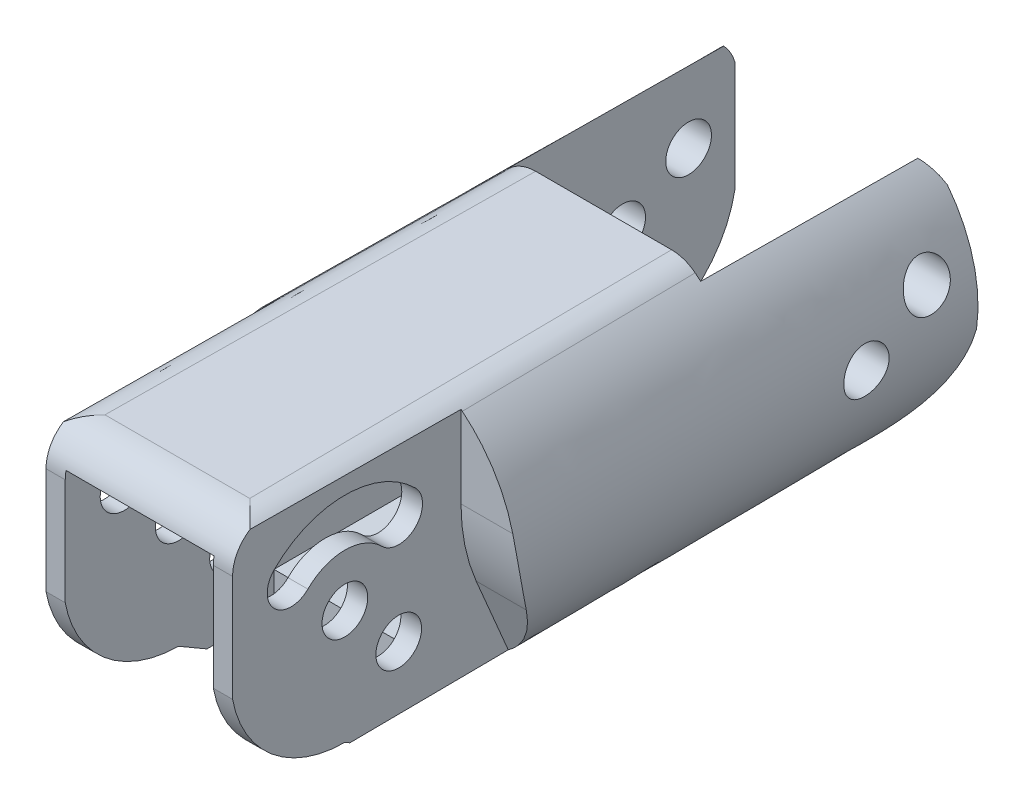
ISO-10303-21;
HEADER;
FILE_DESCRIPTION(('STEP AP214'),'2;1');
FILE_NAME('part.step','',(''),(''),'','','');
FILE_SCHEMA(('AUTOMOTIVE_DESIGN { 1 0 10303 214 1 1 1 1 }'));
ENDSEC;
DATA;
#1=APPLICATION_CONTEXT('core data for automotive mechanical design processes');
#2=APPLICATION_PROTOCOL_DEFINITION('international standard','automotive_design',2000,#1);
#3=PRODUCT_CONTEXT('',#1,'mechanical');
#4=PRODUCT('Part','Part','',(#3));
#5=PRODUCT_RELATED_PRODUCT_CATEGORY('part','',(#4));
#6=PRODUCT_DEFINITION_FORMATION('','',#4);
#7=PRODUCT_DEFINITION_CONTEXT('part definition',#1,'design');
#8=PRODUCT_DEFINITION('design','',#6,#7);
#9=PRODUCT_DEFINITION_SHAPE('','',#8);
#10=(LENGTH_UNIT() NAMED_UNIT(*) SI_UNIT(.MILLI.,.METRE.));
#11=(NAMED_UNIT(*) PLANE_ANGLE_UNIT() SI_UNIT($,.RADIAN.));
#12=(NAMED_UNIT(*) SI_UNIT($,.STERADIAN.) SOLID_ANGLE_UNIT());
#13=UNCERTAINTY_MEASURE_WITH_UNIT(LENGTH_MEASURE(1.E-05),#10,'distance_accuracy_value','');
#14=(GEOMETRIC_REPRESENTATION_CONTEXT(3) GLOBAL_UNCERTAINTY_ASSIGNED_CONTEXT((#13)) GLOBAL_UNIT_ASSIGNED_CONTEXT((#10,
#11,#12)) REPRESENTATION_CONTEXT('',''));
#15=CARTESIAN_POINT('',(0.,0.,0.));
#16=DIRECTION('',(0.,0.,1.));
#17=DIRECTION('',(1.,0.,0.));
#18=AXIS2_PLACEMENT_3D('',#15,#16,#17);
#19=CARTESIAN_POINT('',(31.7494435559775,4.90415400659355,5.36870267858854));
#20=DIRECTION('',(0.,-0.970424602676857,-0.241404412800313));
#21=DIRECTION('',(-1.,0.,0.));
#22=AXIS2_PLACEMENT_3D('',#19,#20,#21);
#23=PLANE('',#22);
#24=DIRECTION('',(1.,0.,0.));
#25=VECTOR('',#24,1.);
#26=CARTESIAN_POINT('',(-4.,4.90415400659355,5.36870267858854));
#27=LINE('',#26,#25);
#28=CARTESIAN_POINT('',(-3.88498480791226,4.90415400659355,5.36870267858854));
#29=VERTEX_POINT('',#28);
#30=CARTESIAN_POINT('',(3.88498480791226,4.90415400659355,5.36870267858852));
#31=VERTEX_POINT('',#30);
#32=EDGE_CURVE('E429',#29,#31,#27,.T.);
#33=ORIENTED_EDGE('',*,*,#32,.F.);
#34=DIRECTION('',(-0.00762819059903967,-0.241397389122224,0.970396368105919));
#35=VECTOR('',#34,1.);
#36=CARTESIAN_POINT('',(-4.01190379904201,0.88774766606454,21.5143045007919));
#37=LINE('',#36,#35);
#38=CARTESIAN_POINT('',(-3.86608494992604,5.50224818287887,2.96441645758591));
#39=VERTEX_POINT('',#38);
#40=EDGE_CURVE('E51',#29,#39,#37,.F.);
#41=ORIENTED_EDGE('',*,*,#40,.T.);
#42=DIRECTION('',(-1.,0.,0.));
#43=VECTOR('',#42,1.);
#44=CARTESIAN_POINT('',(31.7494435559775,5.50224818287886,2.96441645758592));
#45=LINE('',#44,#43);
#46=CARTESIAN_POINT('',(3.86608494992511,5.50224818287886,2.96441645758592));
#47=VERTEX_POINT('',#46);
#48=EDGE_CURVE('E432',#47,#39,#45,.T.);
#49=ORIENTED_EDGE('',*,*,#48,.F.);
#50=DIRECTION('',(-0.00762819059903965,0.241397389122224,-0.970396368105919));
#51=VECTOR('',#50,1.);
#52=CARTESIAN_POINT('',(3.99312126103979,1.48212920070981,19.1249427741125));
#53=LINE('',#52,#51);
#54=EDGE_CURVE('E12',#47,#31,#53,.F.);
#55=ORIENTED_EDGE('',*,*,#54,.T.);
#56=EDGE_LOOP('',(#33,#41,#49,#55));
#57=FACE_BOUND('',#56,.T.);
#58=ADVANCED_FACE('F43',(#57),#23,.T.);
#59=CARTESIAN_POINT('',(-10.255763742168,-4.49999999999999,2.59807621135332));
#60=DIRECTION('',(0.,0.866025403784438,-0.500000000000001));
#61=DIRECTION('',(0.,0.500000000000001,0.866025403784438));
#62=AXIS2_PLACEMENT_3D('',#59,#60,#61);
#63=PLANE('',#62);
#64=DIRECTION('',(-0.00680758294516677,-0.499988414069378,-0.866005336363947));
#65=VECTOR('',#64,1.);
#66=CARTESIAN_POINT('',(3.86255086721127,-4.54805691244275,2.51483919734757));
#67=LINE('',#66,#65);
#68=CARTESIAN_POINT('',(3.84278196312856,-6.,0.));
#69=VERTEX_POINT('',#68);
#70=CARTESIAN_POINT('',(3.83110059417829,-6.85794755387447,-1.48600875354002));
#71=VERTEX_POINT('',#70);
#72=EDGE_CURVE('E450',#69,#71,#67,.T.);
#73=ORIENTED_EDGE('',*,*,#72,.T.);
#74=CARTESIAN_POINT('',(3.55959587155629,-7.00068337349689,-1.73323444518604));
#75=CARTESIAN_POINT('',(3.63412408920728,-6.96331906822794,-1.6685175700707));
#76=CARTESIAN_POINT('',(3.7071812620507,-6.92522878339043,-1.60254326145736));
#77=CARTESIAN_POINT('',(3.85023418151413,-6.84785297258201,-1.46852442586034));
#78=CARTESIAN_POINT('',(3.92023864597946,-6.80857147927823,-1.40048688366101));
#79=CARTESIAN_POINT('',(4.05740101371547,-6.72890982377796,-1.2625088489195));
#80=CARTESIAN_POINT('',(4.12456377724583,-6.68853174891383,-1.19257197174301));
#81=CARTESIAN_POINT('',(4.25622817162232,-6.60675540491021,-1.0509311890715));
#82=CARTESIAN_POINT('',(4.32073172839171,-6.56535791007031,-0.979228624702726));
#83=CARTESIAN_POINT('',(4.44720298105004,-6.48163478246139,-0.834215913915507));
#84=CARTESIAN_POINT('',(4.50917175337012,-6.43930955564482,-0.760906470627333));
#85=CARTESIAN_POINT('',(4.63076550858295,-6.35375775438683,-0.612726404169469));
#86=CARTESIAN_POINT('',(4.69038788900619,-6.31053025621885,-0.53785418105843));
#87=CARTESIAN_POINT('',(4.80742029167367,-6.22321811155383,-0.386625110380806));
#88=CARTESIAN_POINT('',(4.86482601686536,-6.17913202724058,-0.310265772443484));
#89=CARTESIAN_POINT('',(4.97753818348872,-6.09013898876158,-0.156125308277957));
#90=CARTESIAN_POINT('',(5.03283901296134,-6.04523025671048,-0.0783411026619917));
#91=CARTESIAN_POINT('',(5.08705900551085,-5.99999999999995,0.));
#92=B_SPLINE_CURVE_WITH_KNOTS('',3,(#74,#75,#76,#77,#78,#79,#80,#81,#82,#83,#84,#85,#86,#87,#88,
#89,#90,#91),.UNSPECIFIED.,.F.,.F.,(4,2,2,2,2,2,2,2,4),(0.,0.316585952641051,0.632199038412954,
0.94724848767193,1.26206560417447,1.57674761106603,1.89176933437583,2.20737386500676,
2.5237680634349),.UNSPECIFIED.);
#93=CARTESIAN_POINT('',(4.9,-6.15130190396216,-0.262062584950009));
#94=VERTEX_POINT('',#93);
#95=EDGE_CURVE('E1062',#71,#94,#92,.T.);
#96=ORIENTED_EDGE('',*,*,#95,.T.);
#97=DIRECTION('',(0.,-0.500000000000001,-0.866025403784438));
#98=VECTOR('',#97,1.);
#99=CARTESIAN_POINT('',(4.9,-3.70194878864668,3.98034145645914));
#100=LINE('',#99,#98);
#101=CARTESIAN_POINT('',(4.9,-6.,0.));
#102=VERTEX_POINT('',#101);
#103=EDGE_CURVE('E1060',#102,#94,#100,.T.);
#104=ORIENTED_EDGE('',*,*,#103,.F.);
#105=DIRECTION('',(1.,0.,0.));
#106=VECTOR('',#105,1.);
#107=CARTESIAN_POINT('',(-10.255763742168,-6.,0.));
#108=LINE('',#107,#106);
#109=EDGE_CURVE('E1069',#69,#102,#108,.T.);
#110=ORIENTED_EDGE('',*,*,#109,.F.);
#111=EDGE_LOOP('',(#73,#96,#104,#110));
#112=FACE_BOUND('',#111,.T.);
#113=ADVANCED_FACE('F690',(#112),#63,.F.);
#114=CARTESIAN_POINT('',(-10.255763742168,0.,0.));
#115=DIRECTION('',(1.,0.,0.));
#116=DIRECTION('',(0.,0.,-1.));
#117=AXIS2_PLACEMENT_3D('',#114,#115,#116);
#118=CYLINDRICAL_SURFACE('',#117,6.);
#119=CARTESIAN_POINT('',(-4.89999999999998,-6.,0.));
#120=VERTEX_POINT('',#119);
#121=CARTESIAN_POINT('',(-3.84278196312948,-6.,0.));
#122=VERTEX_POINT('',#121);
#123=EDGE_CURVE('E1065',#120,#122,#108,.T.);
#124=ORIENTED_EDGE('',*,*,#123,.T.);
#125=CARTESIAN_POINT('',(-3.84278196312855,0.,0.));
#126=DIRECTION('',(-0.999969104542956,0.,-0.00786065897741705));
#127=DIRECTION('',(0.00786065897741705,0.,-0.999969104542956));
#128=AXIS2_PLACEMENT_3D('',#125,#126,#127);
#129=ELLIPSE('',#128,6.00018537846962,6.);
#130=CARTESIAN_POINT('',(-3.88916128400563,-1.09087121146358,5.9));
#131=VERTEX_POINT('',#130);
#132=EDGE_CURVE('E406',#131,#122,#129,.F.);
#133=ORIENTED_EDGE('',*,*,#132,.F.);
#134=DIRECTION('',(1.,0.,0.));
#135=VECTOR('',#134,1.);
#136=CARTESIAN_POINT('',(-10.255763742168,-1.09087121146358,5.9));
#137=LINE('',#136,#135);
#138=CARTESIAN_POINT('',(-4.89999999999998,-1.09087121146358,5.9));
#139=VERTEX_POINT('',#138);
#140=EDGE_CURVE('E1124',#131,#139,#137,.F.);
#141=ORIENTED_EDGE('',*,*,#140,.T.);
#142=CARTESIAN_POINT('',(-4.89999999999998,0.,0.));
#143=DIRECTION('',(1.,0.,0.));
#144=DIRECTION('',(0.,0.,-1.));
#145=AXIS2_PLACEMENT_3D('',#142,#143,#144);
#146=CIRCLE('',#145,6.);
#147=EDGE_CURVE('E1123',#139,#120,#146,.T.);
#148=ORIENTED_EDGE('',*,*,#147,.T.);
#149=EDGE_LOOP('',(#124,#133,#141,#148));
#150=FACE_BOUND('',#149,.T.);
#151=ADVANCED_FACE('F694',(#150),#118,.T.);
#152=CARTESIAN_POINT('',(-5.08705900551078,-6.,0.));
#153=CARTESIAN_POINT('',(-5.03283901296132,-6.0452302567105,-0.0783411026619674));
#154=CARTESIAN_POINT('',(-4.97753818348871,-6.09013898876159,-0.156125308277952));
#155=CARTESIAN_POINT('',(-4.86482601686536,-6.17913202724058,-0.310265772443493));
#156=CARTESIAN_POINT('',(-4.80742029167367,-6.22321811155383,-0.386625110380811));
#157=CARTESIAN_POINT('',(-4.69038788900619,-6.31053025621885,-0.537854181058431));
#158=CARTESIAN_POINT('',(-4.63076550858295,-6.35375775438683,-0.612726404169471));
#159=CARTESIAN_POINT('',(-4.50917175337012,-6.43930955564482,-0.760906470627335));
#160=CARTESIAN_POINT('',(-4.44720298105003,-6.48163478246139,-0.834215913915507));
#161=CARTESIAN_POINT('',(-4.3207317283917,-6.56535791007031,-0.979228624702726));
#162=CARTESIAN_POINT('',(-4.25622817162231,-6.60675540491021,-1.0509311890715));
#163=CARTESIAN_POINT('',(-4.12456377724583,-6.68853174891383,-1.19257197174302));
#164=CARTESIAN_POINT('',(-4.05740101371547,-6.72890982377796,-1.2625088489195));
#165=CARTESIAN_POINT('',(-3.92023864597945,-6.80857147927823,-1.40048688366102));
#166=CARTESIAN_POINT('',(-3.85023418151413,-6.84785297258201,-1.46852442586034));
#167=CARTESIAN_POINT('',(-3.70718126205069,-6.92522878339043,-1.60254326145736));
#168=CARTESIAN_POINT('',(-3.63412408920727,-6.96331906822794,-1.6685175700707));
#169=CARTESIAN_POINT('',(-3.55959587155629,-7.00068337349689,-1.73323444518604));
#170=B_SPLINE_CURVE_WITH_KNOTS('',3,(#152,#153,#154,#155,#156,#157,#158,#159,#160,#161,#162,
#163,#164,#165,#166,#167,#168,#169),.UNSPECIFIED.,.F.,.F.,(4,2,2,2,2,2,2,2,4),(0.,
0.316394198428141,0.631998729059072,0.947020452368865,1.26170245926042,1.57651957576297,
1.89156902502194,2.20718211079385,2.5237680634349),.UNSPECIFIED.);
#171=CARTESIAN_POINT('',(-4.89999999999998,-6.15130190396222,-0.262062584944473));
#172=VERTEX_POINT('',#171);
#173=CARTESIAN_POINT('',(-3.83110059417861,-6.85794755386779,-1.4860087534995));
#174=VERTEX_POINT('',#173);
#175=EDGE_CURVE('E612',#172,#174,#170,.T.);
#176=ORIENTED_EDGE('',*,*,#175,.T.);
#177=DIRECTION('',(0.00680758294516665,-0.499988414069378,-0.866005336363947));
#178=VECTOR('',#177,1.);
#179=CARTESIAN_POINT('',(-3.86350143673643,-4.47824156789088,2.63576292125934));
#180=LINE('',#179,#178);
#181=EDGE_CURVE('E471',#122,#174,#180,.T.);
#182=ORIENTED_EDGE('',*,*,#181,.F.);
#183=ORIENTED_EDGE('',*,*,#123,.F.);
#184=DIRECTION('',(0.,0.500000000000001,0.866025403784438));
#185=VECTOR('',#184,1.);
#186=CARTESIAN_POINT('',(-4.89999999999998,-3.70194878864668,3.98034145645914));
#187=LINE('',#186,#185);
#188=EDGE_CURVE('E1067',#172,#120,#187,.T.);
#189=ORIENTED_EDGE('',*,*,#188,.F.);
#190=EDGE_LOOP('',(#176,#182,#183,#189));
#191=FACE_BOUND('',#190,.T.);
#192=ADVANCED_FACE('F696',(#191),#63,.F.);
#193=CARTESIAN_POINT('',(-4.,4.99999999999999,20.));
#194=DIRECTION('',(0.,0.999978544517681,-0.00655061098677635));
#195=DIRECTION('',(1.,0.,0.));
#196=AXIS2_PLACEMENT_3D('',#193,#194,#195);
#197=PLANE('',#196);
#198=DIRECTION('',(1.,0.,0.));
#199=VECTOR('',#198,1.);
#200=CARTESIAN_POINT('',(-4.,4.82654386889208,-6.47881394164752));
#201=LINE('',#200,#199);
#202=CARTESIAN_POINT('',(-3.7918526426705,4.82654386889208,-6.47881394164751));
#203=VERTEX_POINT('',#202);
#204=CARTESIAN_POINT('',(3.7918526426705,4.82654386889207,-6.47881394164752));
#205=VERTEX_POINT('',#204);
#206=EDGE_CURVE('E473',#203,#205,#201,.T.);
#207=ORIENTED_EDGE('',*,*,#206,.F.);
#208=DIRECTION('',(0.00786049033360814,-0.00655040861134,-0.999947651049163));
#209=VECTOR('',#208,1.);
#210=CARTESIAN_POINT('',(-3.7,4.75,-18.1635601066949));
#211=LINE('',#210,#209);
#212=CARTESIAN_POINT('',(-3.69743181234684,4.74785984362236,-18.490264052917));
#213=VERTEX_POINT('',#212);
#214=EDGE_CURVE('E383',#203,#213,#211,.T.);
#215=ORIENTED_EDGE('',*,*,#214,.T.);
#216=DIRECTION('',(1.,0.,0.));
#217=VECTOR('',#216,1.);
#218=CARTESIAN_POINT('',(-5.,4.74785984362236,-18.490264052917));
#219=LINE('',#218,#217);
#220=CARTESIAN_POINT('',(3.69743181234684,4.74785984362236,-18.490264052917));
#221=VERTEX_POINT('',#220);
#222=EDGE_CURVE('E1183',#213,#221,#219,.T.);
#223=ORIENTED_EDGE('',*,*,#222,.T.);
#224=DIRECTION('',(0.00786049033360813,0.00655040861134,0.999947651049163));
#225=VECTOR('',#224,1.);
#226=CARTESIAN_POINT('',(3.7,4.75,-18.1635601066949));
#227=LINE('',#226,#225);
#228=EDGE_CURVE('E388',#221,#205,#227,.T.);
#229=ORIENTED_EDGE('',*,*,#228,.T.);
#230=EDGE_LOOP('',(#207,#215,#223,#229));
#231=FACE_BOUND('',#230,.T.);
#232=ADVANCED_FACE('F1076',(#231),#197,.F.);
#233=CARTESIAN_POINT('',(-82.1732035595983,0.,0.));
#234=DIRECTION('',(1.,0.,0.));
#235=DIRECTION('',(0.,0.,-1.));
#236=AXIS2_PLACEMENT_3D('',#233,#234,#235);
#237=CYLINDRICAL_SURFACE('',#236,5.25);
#238=CARTESIAN_POINT('',(-3.84278196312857,0.,0.));
#239=DIRECTION('',(-0.999969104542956,0.,-0.00786065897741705));
#240=DIRECTION('',(0.00786065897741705,0.,-0.999969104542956));
#241=AXIS2_PLACEMENT_3D('',#238,#239,#240);
#242=ELLIPSE('',#241,5.25016220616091,5.25);
#243=CARTESIAN_POINT('',(-3.87196407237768,3.71231060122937,3.71231060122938));
#244=VERTEX_POINT('',#243);
#245=CARTESIAN_POINT('',(-3.81359985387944,3.71231060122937,-3.71231060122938));
#246=VERTEX_POINT('',#245);
#247=EDGE_CURVE('E949',#244,#246,#242,.T.);
#248=ORIENTED_EDGE('',*,*,#247,.F.);
#249=DIRECTION('',(1.,0.,0.));
#250=VECTOR('',#249,1.);
#251=CARTESIAN_POINT('',(-82.1732035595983,3.71231060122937,3.71231060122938));
#252=LINE('',#251,#250);
#253=CARTESIAN_POINT('',(-4.89999999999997,3.71231060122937,3.71231060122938));
#254=VERTEX_POINT('',#253);
#255=EDGE_CURVE('E944',#254,#244,#252,.T.);
#256=ORIENTED_EDGE('',*,*,#255,.F.);
#257=CARTESIAN_POINT('',(-4.89999999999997,0.,0.));
#258=DIRECTION('',(1.,0.,0.));
#259=DIRECTION('',(0.,0.,-1.));
#260=AXIS2_PLACEMENT_3D('',#257,#258,#259);
#261=CIRCLE('',#260,5.25);
#262=CARTESIAN_POINT('',(-4.89999999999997,3.71231060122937,-3.71231060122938));
#263=VERTEX_POINT('',#262);
#264=EDGE_CURVE('E1259',#263,#254,#261,.T.);
#265=ORIENTED_EDGE('',*,*,#264,.F.);
#266=DIRECTION('',(1.,0.,0.));
#267=VECTOR('',#266,1.);
#268=CARTESIAN_POINT('',(-82.1732035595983,3.71231060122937,-3.71231060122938));
#269=LINE('',#268,#267);
#270=EDGE_CURVE('E1300',#263,#246,#269,.T.);
#271=ORIENTED_EDGE('',*,*,#270,.T.);
#272=EDGE_LOOP('',(#248,#256,#265,#271));
#273=FACE_BOUND('',#272,.T.);
#274=ADVANCED_FACE('F1218',(#273),#237,.F.);
#275=CARTESIAN_POINT('',(3.74165738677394,-6.5,-56.3271202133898));
#276=CARTESIAN_POINT('',(3.48711915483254,-7.2,20.));
#277=CARTESIAN_POINT('',(9.38126392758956,-3.25361915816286,-56.3271202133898));
#278=CARTESIAN_POINT('',(10.4110105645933,-3.84660633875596,20.));
#279=CARTESIAN_POINT('',(9.38126392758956,3.25361915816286,-56.3271202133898));
#280=CARTESIAN_POINT('',(10.4110105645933,3.84660633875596,20.));
#281=CARTESIAN_POINT('',(3.74165738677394,6.5,-56.3271202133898));
#282=CARTESIAN_POINT('',(3.48711915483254,7.2,20.));
#283=(BOUNDED_SURFACE() B_SPLINE_SURFACE(3,1,((#275,#276),(#277,#278),(#279,#280),(#281,#282)),
.UNSPECIFIED.,.F.,.F.,.F.) B_SPLINE_SURFACE_WITH_KNOTS((4,4),(2,2),(0.,1.),(0.,1.),
.UNSPECIFIED.) GEOMETRIC_REPRESENTATION_ITEM() RATIONAL_B_SPLINE_SURFACE(((1.,1.),
(0.665925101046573,0.623926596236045),(0.665925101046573,0.623926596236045),(1.,1.))) REPRESENTATION_ITEM('') SURFACE());
#284=CARTESIAN_POINT('',(3.80364703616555,-6.8466292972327,-4.97842712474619));
#285=CARTESIAN_POINT('',(3.81688927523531,-6.85209208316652,-3.29385716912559));
#286=CARTESIAN_POINT('',(3.83013151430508,-6.85755486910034,-1.60928721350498));
#287=CARTESIAN_POINT('',(3.84337375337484,-6.86301765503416,0.0752827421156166));
#288=B_SPLINE_CURVE_WITH_KNOTS('',3,(#284,#285,#286,#287),.UNSPECIFIED.,.F.,.F.,(4,4),(0.,
5.05389257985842),.UNSPECIFIED.);
#289=CARTESIAN_POINT('',(3.80364703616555,-6.8466292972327,-4.97842712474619));
#290=VERTEX_POINT('',#289);
#291=EDGE_CURVE('E368',#290,#71,#288,.T.);
#292=CARTESIAN_POINT('',(3.570418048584,-6.97092154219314,-4.97842712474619));
#293=CARTESIAN_POINT('',(3.6096388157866,-6.95086155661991,-4.97842712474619));
#294=CARTESIAN_POINT('',(3.64868494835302,-6.93047387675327,-4.97842712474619));
#295=CARTESIAN_POINT('',(3.72642794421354,-6.88904312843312,-4.97842712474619));
#296=CARTESIAN_POINT('',(3.76512480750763,-6.86800005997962,-4.97842712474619));
#297=CARTESIAN_POINT('',(3.80364703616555,-6.8466292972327,-4.97842712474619));
#298=B_SPLINE_CURVE_WITH_KNOTS('',3,(#292,#293,#294,#295,#296,#297),.UNSPECIFIED.,.F.,.F.,(4,2,
4),(0.,0.132145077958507,0.264290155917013),.UNSPECIFIED.);
#299=CARTESIAN_POINT('',(3.570418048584,-6.97092154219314,-4.97842712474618));
#300=VERTEX_POINT('',#299);
#301=EDGE_CURVE('E457',#300,#290,#298,.T.);
#302=DIRECTION('',(-0.00333467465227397,-0.00917061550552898,0.999952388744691));
#303=VECTOR('',#302,1.);
#304=CARTESIAN_POINT('',(3.74165738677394,-6.5,-56.3271202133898));
#305=LINE('',#304,#303);
#306=CARTESIAN_POINT('',(3.60255986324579,-6.88252904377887,-14.6166340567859));
#307=VERTEX_POINT('',#306);
#308=EDGE_CURVE('E805',#307,#300,#305,.T.);
#309=CARTESIAN_POINT('',(3.60255986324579,-6.88252904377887,-14.6166340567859));
#310=CARTESIAN_POINT('',(3.67100077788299,-6.84660870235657,-14.6373726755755));
#311=CARTESIAN_POINT('',(3.73877178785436,-6.80973289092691,-14.658662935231));
#312=CARTESIAN_POINT('',(3.8727313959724,-6.73423884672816,-14.7022494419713));
#313=CARTESIAN_POINT('',(3.93892396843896,-6.69562590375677,-14.7245426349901));
#314=CARTESIAN_POINT('',(4.06975450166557,-6.6166933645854,-14.7701143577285));
#315=CARTESIAN_POINT('',(4.13439512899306,-6.57637708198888,-14.7933909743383));
#316=CARTESIAN_POINT('',(4.26214636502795,-6.4940682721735,-14.8409119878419));
#317=CARTESIAN_POINT('',(4.32525830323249,-6.45207729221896,-14.8651554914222));
#318=CARTESIAN_POINT('',(4.44996565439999,-6.36644890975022,-14.9145930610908));
#319=CARTESIAN_POINT('',(4.51156119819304,-6.3228116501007,-14.9397870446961));
#320=CARTESIAN_POINT('',(4.63326279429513,-6.23390426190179,-14.9911177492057));
#321=CARTESIAN_POINT('',(4.69336733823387,-6.18863258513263,-15.0172553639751));
#322=CARTESIAN_POINT('',(4.81210128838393,-6.09647030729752,-15.0704652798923));
#323=CARTESIAN_POINT('',(4.87072771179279,-6.04957682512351,-15.0975392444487));
#324=CARTESIAN_POINT('',(4.98651636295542,-5.9541804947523,-15.1526163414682));
#325=CARTESIAN_POINT('',(5.04367411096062,-5.9056735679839,-15.1806218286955));
#326=CARTESIAN_POINT('',(5.1,-5.85645380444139,-15.2090388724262));
#327=B_SPLINE_CURVE_WITH_KNOTS('',3,(#309,#310,#311,#312,#313,#314,#315,#316,#317,#318,#319,
#320,#321,#322,#323,#324,#325,#326),.UNSPECIFIED.,.F.,.F.,(4,2,2,2,2,2,2,2,4),(0.,
0.240072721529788,0.479458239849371,0.718397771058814,0.95712143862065,1.19582443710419,
1.43475980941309,1.67414397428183,1.91418776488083),.UNSPECIFIED.);
#328=CARTESIAN_POINT('',(5.1,-5.85645380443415,-15.2090388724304));
#329=VERTEX_POINT('',#328);
#330=EDGE_CURVE('E1087',#307,#329,#327,.T.);
#331=CARTESIAN_POINT('',(5.1,-5.90286249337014,-9.88215435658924));
#332=CARTESIAN_POINT('',(5.1,-5.87785737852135,-12.751524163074));
#333=CARTESIAN_POINT('',(5.1,-5.85286286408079,-15.6208940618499));
#334=CARTESIAN_POINT('',(5.1,-5.79305052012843,-22.4902638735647));
#335=CARTESIAN_POINT('',(5.1,-5.75824269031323,-26.4902638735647));
#336=CARTESIAN_POINT('',(5.1,-5.72345546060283,-30.4902640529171));
#337=B_SPLINE_CURVE_WITH_KNOTS('',3,(#331,#332,#333,#334,#335,#336),.UNSPECIFIED.,.F.,.F.,(4,2,
4),(0.,8.60843627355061,20.6088906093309),.UNSPECIFIED.);
#338=CARTESIAN_POINT('',(5.1,-5.76016812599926,-26.2696875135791));
#339=VERTEX_POINT('',#338);
#340=EDGE_CURVE('E905',#329,#339,#337,.T.);
#341=CARTESIAN_POINT('',(4.83258208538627,-6.00000000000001,-24.590264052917));
#342=CARTESIAN_POINT('',(4.83185436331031,-6.00000343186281,-24.6592964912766));
#343=CARTESIAN_POINT('',(4.83262568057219,-5.99880872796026,-24.7283413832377));
#344=CARTESIAN_POINT('',(4.83711018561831,-5.99404577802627,-24.8662408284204));
#345=CARTESIAN_POINT('',(4.84082281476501,-5.99047798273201,-24.9350954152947));
#346=CARTESIAN_POINT('',(4.85112067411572,-5.98100336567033,-25.0722545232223));
#347=CARTESIAN_POINT('',(4.85769873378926,-5.97510238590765,-25.1405599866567));
#348=CARTESIAN_POINT('',(4.87360862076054,-5.9610077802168,-25.2766063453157));
#349=CARTESIAN_POINT('',(4.88294054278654,-5.95281407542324,-25.3443472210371));
#350=CARTESIAN_POINT('',(4.9145307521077,-5.92515788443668,-25.5444288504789));
#351=CARTESIAN_POINT('',(4.94055207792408,-5.90246978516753,-25.6757569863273));
#352=CARTESIAN_POINT('',(5.00131685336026,-5.84893172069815,-25.9347017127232));
#353=CARTESIAN_POINT('',(5.0360662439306,-5.81807619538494,-26.0623157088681));
#354=CARTESIAN_POINT('',(5.12125892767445,-5.74102748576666,-26.3412488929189));
#355=CARTESIAN_POINT('',(5.17347393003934,-5.69294824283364,-26.491504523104));
#356=CARTESIAN_POINT('',(5.28582629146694,-5.58631856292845,-26.7851364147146));
#357=CARTESIAN_POINT('',(5.34596521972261,-5.52776605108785,-26.9285113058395));
#358=CARTESIAN_POINT('',(5.47214008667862,-5.40049566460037,-27.2091426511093));
#359=CARTESIAN_POINT('',(5.53820916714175,-5.33171904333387,-27.3463573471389));
#360=CARTESIAN_POINT('',(5.67388728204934,-5.18474653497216,-27.6137859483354));
#361=CARTESIAN_POINT('',(5.74349633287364,-5.10655060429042,-27.7439998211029));
#362=CARTESIAN_POINT('',(5.8863239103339,-4.93895728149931,-28.0006570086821));
#363=CARTESIAN_POINT('',(5.95958919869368,-4.84932670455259,-28.1269218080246));
#364=CARTESIAN_POINT('',(6.10643178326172,-4.66072695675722,-28.3719995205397));
#365=CARTESIAN_POINT('',(6.18000897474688,-4.56176071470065,-28.4908147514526));
#366=CARTESIAN_POINT('',(6.32592397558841,-4.35483749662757,-28.7205462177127));
#367=CARTESIAN_POINT('',(6.39826428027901,-4.24690208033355,-28.8314802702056));
#368=CARTESIAN_POINT('',(6.54068522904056,-4.02179779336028,-29.0455185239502));
#369=CARTESIAN_POINT('',(6.61076278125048,-3.90461698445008,-29.1486122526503));
#370=CARTESIAN_POINT('',(6.74561793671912,-3.66430419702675,-29.343814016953));
#371=CARTESIAN_POINT('',(6.81048391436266,-3.54139211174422,-29.4361312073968));
#372=CARTESIAN_POINT('',(6.93564080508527,-3.28725504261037,-29.6119993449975));
#373=CARTESIAN_POINT('',(6.99593240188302,-3.1560313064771,-29.695551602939));
#374=CARTESIAN_POINT('',(7.11075110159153,-2.88573590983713,-29.8530548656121));
#375=CARTESIAN_POINT('',(7.16528427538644,-2.74667275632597,-29.927016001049));
#376=CARTESIAN_POINT('',(7.26750105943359,-2.46116965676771,-30.0645424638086));
#377=CARTESIAN_POINT('',(7.31518897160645,-2.31473442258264,-30.1281143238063));
#378=CARTESIAN_POINT('',(7.39568176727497,-2.03908356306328,-30.2347624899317));
#379=CARTESIAN_POINT('',(7.42964732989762,-1.91084417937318,-30.2794905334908));
#380=CARTESIAN_POINT('',(7.49137769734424,-1.65030251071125,-30.3604544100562));
#381=CARTESIAN_POINT('',(7.51914517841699,-1.51800200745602,-30.3966939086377));
#382=CARTESIAN_POINT('',(7.56791748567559,-1.25027610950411,-30.4601622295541));
#383=CARTESIAN_POINT('',(7.58893378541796,-1.11485644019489,-30.4874063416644));
#384=CARTESIAN_POINT('',(7.6238297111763,-0.841598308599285,-30.5325594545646));
#385=CARTESIAN_POINT('',(7.63771219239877,-0.703760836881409,-30.5504721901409));
#386=CARTESIAN_POINT('',(7.65476590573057,-0.47141752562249,-30.5724581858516));
#387=CARTESIAN_POINT('',(7.65994844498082,-0.377293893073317,-30.5791326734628));
#388=CARTESIAN_POINT('',(7.66686454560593,-0.188784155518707,-30.5880361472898));
#389=CARTESIAN_POINT('',(7.668600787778,-0.0943983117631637,-30.590268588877));
#390=CARTESIAN_POINT('',(7.66859575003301,0.,-30.5902640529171));
#391=B_SPLINE_CURVE_WITH_KNOTS('',3,(#341,#342,#343,#344,#345,#346,#347,#348,#349,#350,#351,
#352,#353,#354,#355,#356,#357,#358,#359,#360,#361,#362,#363,#364,#365,#366,#367,#368,#369,#370,
#371,#372,#373,#374,#375,#376,#377,#378,#379,#380,#381,#382,#383,#384,#385,#386,#387,#388,#389,
#390),.UNSPECIFIED.,.F.,.F.,(4,2,2,2,2,2,2,2,2,2,2,2,2,2,2,2,2,2,2,2,2,2,2,2,4),(0.,
0.207077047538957,0.414114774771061,0.620637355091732,0.827167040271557,1.23383594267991,
1.64078240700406,2.13852324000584,2.63636279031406,3.13718213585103,3.63800379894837,
4.15148521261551,4.66480606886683,5.17692686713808,5.6897201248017,6.1897859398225,
6.68977686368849,7.18923528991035,7.68837844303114,8.10795194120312,8.52734392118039,
8.94601933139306,9.36452704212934,9.64787618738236,9.93100483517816),.UNSPECIFIED.);
#392=CARTESIAN_POINT('',(7.59115265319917,-1.09087121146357,-30.4902640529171));
#393=VERTEX_POINT('',#392);
#394=EDGE_CURVE('E1196',#339,#393,#391,.T.);
#395=CARTESIAN_POINT('',(5.1,-5.72345546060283,-30.4902640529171));
#396=CARTESIAN_POINT('',(5.2610442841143,-5.58019909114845,-30.4902640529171));
#397=CARTESIAN_POINT('',(5.41601493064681,-5.43012090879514,-30.4902640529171));
#398=CARTESIAN_POINT('',(5.71277157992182,-5.11746296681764,-30.4902640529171));
#399=CARTESIAN_POINT('',(5.85455816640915,-4.95488376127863,-30.4902640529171));
#400=CARTESIAN_POINT('',(6.12381892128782,-4.6184839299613,-30.4902640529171));
#401=CARTESIAN_POINT('',(6.25130414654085,-4.44467215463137,-30.4902640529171));
#402=CARTESIAN_POINT('',(6.4911847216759,-4.0869336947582,-30.4902640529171));
#403=CARTESIAN_POINT('',(6.6035802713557,-3.90300714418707,-30.4902640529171));
#404=CARTESIAN_POINT('',(6.81251367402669,-3.52628144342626,-30.4902640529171));
#405=CARTESIAN_POINT('',(6.90904651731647,-3.33347951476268,-30.4902640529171));
#406=CARTESIAN_POINT('',(7.08555544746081,-2.94035437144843,-30.4902640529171));
#407=CARTESIAN_POINT('',(7.16552539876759,-2.74002840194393,-30.4902640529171));
#408=CARTESIAN_POINT('',(7.30825628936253,-2.33344892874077,-30.4902640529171));
#409=CARTESIAN_POINT('',(7.37102577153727,-2.12719842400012,-30.4902640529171));
#410=CARTESIAN_POINT('',(7.47898015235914,-1.71006307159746,-30.4902640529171));
#411=CARTESIAN_POINT('',(7.52415846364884,-1.49917651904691,-30.4902640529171));
#412=CARTESIAN_POINT('',(7.59654381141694,-1.07452190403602,-30.4902640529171));
#413=CARTESIAN_POINT('',(7.62376574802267,-0.860756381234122,-30.4902640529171));
#414=CARTESIAN_POINT('',(7.66011209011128,-0.431594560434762,-30.4902640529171));
#415=CARTESIAN_POINT('',(7.66922829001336,-0.216197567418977,-30.4902640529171));
#416=CARTESIAN_POINT('',(7.66927327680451,0.214597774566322,-30.4902640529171));
#417=CARTESIAN_POINT('',(7.66020210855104,0.429996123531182,-30.4902640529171));
#418=CARTESIAN_POINT('',(7.62394557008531,0.859164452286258,-30.4902640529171));
#419=CARTESIAN_POINT('',(7.5967684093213,1.07293512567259,-30.4902640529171));
#420=CARTESIAN_POINT('',(7.52449941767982,1.49744346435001,-30.4902640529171));
#421=CARTESIAN_POINT('',(7.47940621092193,1.70818089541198,-30.4902640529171));
#422=CARTESIAN_POINT('',(7.37164744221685,2.12502981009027,-30.4902640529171));
#423=CARTESIAN_POINT('',(7.30898845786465,2.33114299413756,-30.4902640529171));
#424=CARTESIAN_POINT('',(7.16650252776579,2.73746275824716,-30.4902640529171));
#425=CARTESIAN_POINT('',(7.08666704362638,2.93766634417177,-30.4902640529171));
#426=CARTESIAN_POINT('',(6.91044907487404,3.3305648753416,-30.4902640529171));
#427=CARTESIAN_POINT('',(6.81407269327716,3.52326255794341,-30.4902640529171));
#428=CARTESIAN_POINT('',(6.60525060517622,3.90020017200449,-30.4902640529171));
#429=CARTESIAN_POINT('',(6.49277620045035,4.08442420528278,-30.4902640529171));
#430=CARTESIAN_POINT('',(6.25269291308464,4.44273549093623,-30.4902640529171));
#431=CARTESIAN_POINT('',(6.12508379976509,4.61682258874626,-30.4902640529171));
#432=CARTESIAN_POINT('',(5.85553097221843,4.95374880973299,-30.4902640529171));
#433=CARTESIAN_POINT('',(5.71357589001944,5.11657883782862,-30.4902640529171));
#434=CARTESIAN_POINT('',(5.4164444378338,5.42970503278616,-30.4902640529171));
#435=CARTESIAN_POINT('',(5.26126750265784,5.58000066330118,-30.4902640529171));
#436=CARTESIAN_POINT('',(5.1,5.72345546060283,-30.4902640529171));
#437=B_SPLINE_CURVE_WITH_KNOTS('',3,(#395,#396,#397,#398,#399,#400,#401,#402,#403,#404,#405,
#406,#407,#408,#409,#410,#411,#412,#413,#414,#415,#416,#417,#418,#419,#420,#421,#422,#423,#424,
#425,#426,#427,#428,#429,#430,#431,#432,#433,#434,#435,#436),.UNSPECIFIED.,.F.,.F.,(4,2,2,2,2,2,
2,2,2,2,2,2,2,2,2,2,2,2,2,2,4),(0.,0.646424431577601,1.29282022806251,1.93871277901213,
2.58459677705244,3.23068436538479,3.87701086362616,4.52301576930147,5.16926235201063,
5.81497200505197,6.4609742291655,7.10697485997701,7.75268278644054,8.39844031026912,
9.04395634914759,9.68979401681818,10.3353939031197,10.9821593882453,11.628934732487,
12.2762266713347,12.9235462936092),.UNSPECIFIED.);
#438=CARTESIAN_POINT('',(6.05755397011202,4.70000000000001,-30.4902640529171));
#439=VERTEX_POINT('',#438);
#440=EDGE_CURVE('E909',#393,#439,#437,.T.);
#441=CARTESIAN_POINT('',(6.54088207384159,4.,-30.5902640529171));
#442=CARTESIAN_POINT('',(6.48508592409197,4.09114229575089,-30.5902583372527));
#443=CARTESIAN_POINT('',(6.4274139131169,4.1810488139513,-30.5852820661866));
#444=CARTESIAN_POINT('',(6.30897656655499,4.35764549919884,-30.5661421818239));
#445=CARTESIAN_POINT('',(6.24821511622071,4.44433948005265,-30.5519898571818));
#446=CARTESIAN_POINT('',(6.12426561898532,4.61379059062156,-30.5152918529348));
#447=CARTESIAN_POINT('',(6.06108371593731,4.69655663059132,-30.4927663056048));
#448=CARTESIAN_POINT('',(5.93274741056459,4.85797098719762,-30.4399659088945));
#449=CARTESIAN_POINT('',(5.86759248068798,4.93661818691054,-30.4096889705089));
#450=CARTESIAN_POINT('',(5.67911783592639,5.15536009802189,-30.3127358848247));
#451=CARTESIAN_POINT('',(5.55398288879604,5.29010768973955,-30.2371544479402));
#452=CARTESIAN_POINT('',(5.36582208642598,5.47962065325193,-30.106844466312));
#453=CARTESIAN_POINT('',(5.30302043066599,5.54069457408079,-30.0605805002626));
#454=CARTESIAN_POINT('',(5.17780041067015,5.65857439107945,-29.9624309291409));
#455=CARTESIAN_POINT('',(5.11538192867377,5.71538166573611,-29.9105471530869));
#456=CARTESIAN_POINT('',(5.00333732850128,5.81422100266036,-29.8114659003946));
#457=CARTESIAN_POINT('',(4.95352409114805,5.85701575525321,-29.7652374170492));
#458=CARTESIAN_POINT('',(4.85518787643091,5.9394736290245,-29.6690067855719));
#459=CARTESIAN_POINT('',(4.80666288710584,5.97914185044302,-29.6190110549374));
#460=CARTESIAN_POINT('',(4.75898358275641,6.01721725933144,-29.567028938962));
#461=B_SPLINE_CURVE_WITH_KNOTS('',3,(#441,#442,#443,#444,#445,#446,#447,#448,#449,#450,#451,
#452,#453,#454,#455,#456,#457,#458,#459,#460),.UNSPECIFIED.,.F.,.F.,(4,2,2,2,2,2,2,2,2,4),(0.,
0.320347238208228,0.640301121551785,0.959490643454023,1.27876627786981,1.87272492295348,
2.16975129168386,2.46668127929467,2.70746438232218,2.947846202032),.UNSPECIFIED.);
#462=CARTESIAN_POINT('',(5.1,5.72862081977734,-29.8963288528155));
#463=VERTEX_POINT('',#462);
#464=EDGE_CURVE('E1041',#439,#463,#461,.T.);
#465=CARTESIAN_POINT('',(5.1,5.72345546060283,-30.4902640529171));
#466=CARTESIAN_POINT('',(5.1,5.75826329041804,-26.4902640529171));
#467=CARTESIAN_POINT('',(5.1,5.79307112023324,-22.490264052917));
#468=CARTESIAN_POINT('',(5.1,5.82787895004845,-18.490264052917));
#469=B_SPLINE_CURVE_WITH_KNOTS('',3,(#465,#466,#467,#468),.UNSPECIFIED.,.F.,.F.,(4,4),(0.,
12.0004543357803),.UNSPECIFIED.);
#470=CARTESIAN_POINT('',(5.1,5.82787895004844,-18.490264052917));
#471=VERTEX_POINT('',#470);
#472=EDGE_CURVE('E1029',#463,#471,#469,.T.);
#473=CARTESIAN_POINT('',(5.1,5.82787895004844,-18.490264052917));
#474=CARTESIAN_POINT('',(4.95249178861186,5.95672501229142,-18.490264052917));
#475=CARTESIAN_POINT('',(4.80055302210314,6.07964986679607,-18.490264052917));
#476=CARTESIAN_POINT('',(4.48781437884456,6.3136571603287,-18.490264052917));
#477=CARTESIAN_POINT('',(4.32701450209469,6.42473959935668,-18.490264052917));
#478=CARTESIAN_POINT('',(4.16178407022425,6.52990083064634,-18.490264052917));
#479=B_SPLINE_CURVE_WITH_KNOTS('',3,(#473,#474,#475,#476,#477,#478),.UNSPECIFIED.,.F.,.F.,(4,2,
4),(0.,0.586313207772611,1.17262641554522),.UNSPECIFIED.);
#480=CARTESIAN_POINT('',(4.81116325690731,6.06813238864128,-18.4902640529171));
#481=VERTEX_POINT('',#480);
#482=EDGE_CURVE('E812',#471,#481,#479,.T.);
#483=CARTESIAN_POINT('',(3.05932211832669,6.5,-65.6550908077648));
#484=CARTESIAN_POINT('',(3.67544909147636,6.49999999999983,-65.6619186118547));
#485=CARTESIAN_POINT('',(4.18475579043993,6.15325240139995,-65.6675626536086));
#486=CARTESIAN_POINT('',(3.07657375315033,6.5,-64.0983259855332));
#487=CARTESIAN_POINT('',(3.69545583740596,6.49999999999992,-64.1045709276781));
#488=CARTESIAN_POINT('',(4.2061557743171,6.15042773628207,-64.1108242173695));
#489=CARTESIAN_POINT('',(3.09378497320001,6.5,-62.5415607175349));
#490=CARTESIAN_POINT('',(3.71540190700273,6.49999999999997,-62.5478249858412));
#491=CARTESIAN_POINT('',(4.22748112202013,6.14760430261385,-62.5540847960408));
#492=CARTESIAN_POINT('',(3.12812658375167,6.5,-59.4280292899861));
#493=CARTESIAN_POINT('',(3.75518796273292,6.50000000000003,-59.4343320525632));
#494=CARTESIAN_POINT('',(4.26998254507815,6.14195989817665,-59.4406039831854));
#495=CARTESIAN_POINT('',(3.14525697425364,6.5,-57.8712631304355));
#496=CARTESIAN_POINT('',(3.77502787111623,6.50000000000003,-57.8775847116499));
#497=CARTESIAN_POINT('',(4.29115862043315,6.13913892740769,-57.8838625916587));
#498=CARTESIAN_POINT('',(3.16234694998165,6.5,-56.3144965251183));
#499=CARTESIAN_POINT('',(3.79480689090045,6.5,-56.321439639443));
#500=CARTESIAN_POINT('',(4.31226005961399,6.13631918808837,-56.3271202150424));
#501=CARTESIAN_POINT('',(3.16796316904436,6.5,-55.8029054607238));
#502=CARTESIAN_POINT('',(3.8013102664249,6.5,-55.8097894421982));
#503=CARTESIAN_POINT('',(4.31919474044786,6.13539257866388,-55.8155371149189));
#504=CARTESIAN_POINT('',(3.17357504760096,6.5,-55.291314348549));
#505=CARTESIAN_POINT('',(3.80780715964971,6.5,-55.2982044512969));
#506=CARTESIAN_POINT('',(4.3261215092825,6.13446610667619,-55.3039539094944));
#507=CARTESIAN_POINT('',(3.25978746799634,6.5,-47.4259239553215));
#508=CARTESIAN_POINT('',(3.90777657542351,6.5,-47.4194753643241));
#509=CARTESIAN_POINT('',(4.4324950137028,6.12022439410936,-47.4386841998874));
#510=CARTESIAN_POINT('',(3.33949645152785,6.5,-40.0721148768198));
#511=CARTESIAN_POINT('',(3.99991556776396,6.49999999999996,-40.0657247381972));
#512=CARTESIAN_POINT('',(4.53032099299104,6.10693868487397,-40.0849761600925));
#513=CARTESIAN_POINT('',(3.49714999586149,6.5,-25.3644773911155));
#514=CARTESIAN_POINT('',(4.18195670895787,6.49999999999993,-25.3581954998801));
#515=CARTESIAN_POINT('',(4.72289271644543,6.08046334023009,-25.3775197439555));
#516=CARTESIAN_POINT('',(3.57509455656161,6.5,-18.0106489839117));
#517=CARTESIAN_POINT('',(4.27185000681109,6.49999999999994,-18.0044637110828));
#518=CARTESIAN_POINT('',(4.81763846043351,6.06727370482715,-18.0237713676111));
#519=CARTESIAN_POINT('',(3.6906048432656,6.49999999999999,-6.99024791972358));
#520=CARTESIAN_POINT('',(4.40481060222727,6.49999999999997,-6.99432855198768));
#521=CARTESIAN_POINT('',(4.9574162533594,6.04761808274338,-7.00347678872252));
#522=CARTESIAN_POINT('',(3.72882079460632,6.49999999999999,-3.32368206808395));
#523=CARTESIAN_POINT('',(4.44881624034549,6.49999999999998,-3.32780698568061));
#524=CARTESIAN_POINT('',(5.00355511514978,6.04109681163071,-3.33694413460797));
#525=CARTESIAN_POINT('',(3.83478660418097,6.49999999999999,6.899731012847));
#526=CARTESIAN_POINT('',(4.57086101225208,6.50000000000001,6.90295605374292));
#527=CARTESIAN_POINT('',(5.13120476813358,6.0229740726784,6.88638207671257));
#528=CARTESIAN_POINT('',(3.90207066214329,6.49999999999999,13.4565830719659));
#529=CARTESIAN_POINT('',(4.64821969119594,6.50000000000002,13.4597160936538));
#530=CARTESIAN_POINT('',(5.2119285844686,6.01142020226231,13.44318495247));
#531=CARTESIAN_POINT('',(3.96869525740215,6.49999999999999,20.0134418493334));
#532=CARTESIAN_POINT('',(4.72462420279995,6.49999999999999,20.0057606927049));
#533=CARTESIAN_POINT('',(5.29155383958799,5.99995483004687,19.9999999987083));
#534=CARTESIAN_POINT('',(3.97658337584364,6.49999999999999,20.7897345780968));
#535=CARTESIAN_POINT('',(4.73368678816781,6.49999999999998,20.7822003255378));
#536=CARTESIAN_POINT('',(5.30098107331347,5.99859734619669,20.7762875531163));
#537=CARTESIAN_POINT('',(3.98446224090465,6.49999999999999,21.5660274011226));
#538=CARTESIAN_POINT('',(4.74273590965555,6.49999999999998,21.5584869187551));
#539=CARTESIAN_POINT('',(5.31039288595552,5.99724113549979,21.5525752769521));
#540=CARTESIAN_POINT('',(4.14481111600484,6.49999999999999,37.3834412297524));
#541=CARTESIAN_POINT('',(4.92753807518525,6.49999999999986,37.4322759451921));
#542=CARTESIAN_POINT('',(5.50185157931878,5.96963397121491,37.3698867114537));
#543=CARTESIAN_POINT('',(4.29383527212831,6.49999999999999,52.4245972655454));
#544=CARTESIAN_POINT('',(5.09822644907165,6.49999999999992,52.4713070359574));
#545=CARTESIAN_POINT('',(5.67815807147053,5.94386826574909,52.4109731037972));
#546=CARTESIAN_POINT('',(4.58570126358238,6.49999999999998,82.506970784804));
#547=CARTESIAN_POINT('',(5.4317793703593,6.50000000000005,82.5547478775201));
#548=CARTESIAN_POINT('',(6.02055984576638,5.89364265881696,82.4932436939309));
#549=CARTESIAN_POINT('',(4.72854309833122,6.49999999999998,97.5481882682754));
#550=CARTESIAN_POINT('',(5.59453539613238,6.50000000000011,97.5946309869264));
#551=CARTESIAN_POINT('',(6.18665512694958,5.86918275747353,97.5344278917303));
#552=CARTESIAN_POINT('',(4.86865765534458,6.49999999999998,112.589430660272));
#553=CARTESIAN_POINT('',(5.75320024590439,6.49999999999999,112.581189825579));
#554=CARTESIAN_POINT('',(6.34829490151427,5.84554211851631,112.575645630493));
#555=(BOUNDED_SURFACE() B_SPLINE_SURFACE(3,2,((#483,#484,#485),(#486,#487,#488),(#489,#490,
#491),(#492,#493,#494),(#495,#496,#497),(#498,#499,#500),(#501,#502,#503),(#504,#505,#506),
(#507,#508,#509),(#510,#511,#512),(#513,#514,#515),(#516,#517,#518),(#519,#520,#521),(#522,#523,
#524),(#525,#526,#527),(#528,#529,#530),(#531,#532,#533),(#534,#535,#536),(#537,#538,#539),
(#540,#541,#542),(#543,#544,#545),(#546,#547,#548),(#549,#550,#551),(#552,#553,#554)),
.UNSPECIFIED.,.F.,.F.,.F.) B_SPLINE_SURFACE_WITH_KNOTS((4,2,3,2,2,2,2,3,2,2,4),(3,3),(0.,
4.67058121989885,9.34116243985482,10.8760281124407,32.9387510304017,55.0014752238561,
66.0017702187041,85.6733619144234,88.0023603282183,133.128041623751,178.253727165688),(0.,1.),
.UNSPECIFIED.) GEOMETRIC_REPRESENTATION_ITEM() RATIONAL_B_SPLINE_SURFACE(((1.,0.955674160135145,
1.),(1.,0.955304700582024,1.),(1.,0.954935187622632,1.),(1.,0.9541960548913,1.),(1.,
0.95382643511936,1.),(1.,0.953456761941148,1.),(1.,0.953335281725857,1.),(1.,0.953213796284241,
1.),(1.,0.951345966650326,1.),(1.,0.949598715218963,1.),(1.,0.946107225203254,1.),(1.,
0.944362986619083,1.),(1.,0.941756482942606,1.),(1.,0.940890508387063,1.),(1.,0.938480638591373,
1.),(1.,0.936940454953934,1.),(1.,0.935408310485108,1.),(1.,0.935226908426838,1.),(1.,
0.935045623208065,1.),(1.,0.931354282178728,1.),(1.,0.927889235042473,1.),(1.,0.921098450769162,
1.),(1.,0.917772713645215,1.),(1.,0.914541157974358,1.))) REPRESENTATION_ITEM('') SURFACE());
#556=CARTESIAN_POINT('',(4.18475579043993,6.15325240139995,-65.6675626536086));
#557=CARTESIAN_POINT('',(4.2061557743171,6.15042773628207,-64.1108242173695));
#558=CARTESIAN_POINT('',(4.22748112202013,6.14760430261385,-62.5540847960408));
#559=CARTESIAN_POINT('',(4.26998254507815,6.14195989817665,-59.4406039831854));
#560=CARTESIAN_POINT('',(4.29115862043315,6.13913892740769,-57.8838625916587));
#561=CARTESIAN_POINT('',(4.31226005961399,6.13631918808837,-56.3271202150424));
#562=CARTESIAN_POINT('',(4.31919474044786,6.13539257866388,-55.8155371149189));
#563=CARTESIAN_POINT('',(4.3261215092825,6.13446610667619,-55.3039539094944));
#564=CARTESIAN_POINT('',(4.4324950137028,6.12022439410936,-47.4386841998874));
#565=CARTESIAN_POINT('',(4.53032099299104,6.10693868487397,-40.0849761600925));
#566=CARTESIAN_POINT('',(4.72289271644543,6.08046334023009,-25.3775197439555));
#567=CARTESIAN_POINT('',(4.81763846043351,6.06727370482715,-18.0237713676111));
#568=CARTESIAN_POINT('',(4.9574162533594,6.04761808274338,-7.00347678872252));
#569=CARTESIAN_POINT('',(5.00355511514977,6.04109681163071,-3.33694413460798));
#570=CARTESIAN_POINT('',(5.13120476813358,6.0229740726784,6.88638207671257));
#571=CARTESIAN_POINT('',(5.2119285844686,6.01142020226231,13.44318495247));
#572=CARTESIAN_POINT('',(5.29155383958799,5.99995483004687,19.9999999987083));
#573=CARTESIAN_POINT('',(5.30098107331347,5.99859734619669,20.7762875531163));
#574=CARTESIAN_POINT('',(5.31039288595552,5.99724113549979,21.5525752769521));
#575=CARTESIAN_POINT('',(5.50185157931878,5.96963397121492,37.3698867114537));
#576=CARTESIAN_POINT('',(5.67815807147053,5.94386826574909,52.4109731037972));
#577=CARTESIAN_POINT('',(6.02055984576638,5.89364265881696,82.4932436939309));
#578=CARTESIAN_POINT('',(6.18665512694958,5.86918275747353,97.5344278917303));
#579=CARTESIAN_POINT('',(6.34829490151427,5.84554211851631,112.575645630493));
#580=B_SPLINE_CURVE_WITH_KNOTS('',3,(#556,#557,#558,#559,#560,#561,#562,#563,#564,#565,#566,
#567,#568,#569,#570,#571,#572,#573,#574,#575,#576,#577,#578,#579),.UNSPECIFIED.,.F.,.F.,(4,2,3,
2,2,2,2,3,2,2,4),(0.,4.67058121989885,9.34116243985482,10.8760281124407,32.9387510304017,
55.0014752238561,66.0017702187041,85.6733619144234,88.0023603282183,133.128041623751,
178.253727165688),.UNSPECIFIED.);
#581=CARTESIAN_POINT('',(4.96868660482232,6.04601636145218,-6.10000000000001));
#582=VERTEX_POINT('',#581);
#583=EDGE_CURVE('E839',#481,#582,#580,.T.);
#584=CARTESIAN_POINT('',(4.9,-6.10173694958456,-6.1));
#585=CARTESIAN_POINT('',(5.0716815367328,-5.96409507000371,-6.1));
#586=CARTESIAN_POINT('',(5.23752705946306,-5.81918045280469,-6.1));
#587=CARTESIAN_POINT('',(5.55642900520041,-5.51591615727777,-6.1));
#588=CARTESIAN_POINT('',(5.70948599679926,-5.35756707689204,-6.1));
#589=CARTESIAN_POINT('',(6.00161124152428,-5.02864221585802,-6.1));
#590=CARTESIAN_POINT('',(6.14068881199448,-4.85807471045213,-6.1));
#591=CARTESIAN_POINT('',(6.40398501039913,-4.50583646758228,-6.1));
#592=CARTESIAN_POINT('',(6.52820383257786,-4.32416587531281,-6.1));
#593=CARTESIAN_POINT('',(6.76093271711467,-3.95095179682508,-6.1));
#594=CARTESIAN_POINT('',(6.86943810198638,-3.75940539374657,-6.1));
#595=CARTESIAN_POINT('',(7.06995943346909,-3.36777846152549,-6.1));
#596=CARTESIAN_POINT('',(7.16196929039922,-3.16769481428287,-6.1));
#597=CARTESIAN_POINT('',(7.32876008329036,-2.76056334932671,-6.1));
#598=CARTESIAN_POINT('',(7.40354781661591,-2.55351831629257,-6.1));
#599=CARTESIAN_POINT('',(7.53540837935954,-2.1338572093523,-6.1));
#600=CARTESIAN_POINT('',(7.59248084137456,-1.92124102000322,-6.1));
#601=CARTESIAN_POINT('',(7.68848137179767,-1.49204254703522,-6.1));
#602=CARTESIAN_POINT('',(7.72741685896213,-1.27546192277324,-6.1));
#603=CARTESIAN_POINT('',(7.78690003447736,-0.839789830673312,-6.1));
#604=CARTESIAN_POINT('',(7.80744769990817,-0.620698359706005,-6.1));
#605=CARTESIAN_POINT('',(7.83000963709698,-0.181539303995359,-6.1));
#606=CARTESIAN_POINT('',(7.83202189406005,0.0385283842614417,-6.1));
#607=CARTESIAN_POINT('',(7.81749353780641,0.478045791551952,-6.1));
#608=CARTESIAN_POINT('',(7.80095332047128,0.697495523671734,-6.10000000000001));
#609=CARTESIAN_POINT('',(7.74944619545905,1.13415775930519,-6.10000000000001));
#610=CARTESIAN_POINT('',(7.71448458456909,1.35137088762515,-6.1));
#611=CARTESIAN_POINT('',(7.62640260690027,1.78200547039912,-6.1));
#612=CARTESIAN_POINT('',(7.57328850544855,1.99542820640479,-6.1));
#613=CARTESIAN_POINT('',(7.4492497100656,2.41713796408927,-6.1));
#614=CARTESIAN_POINT('',(7.37831702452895,2.62542263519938,-6.1));
#615=CARTESIAN_POINT('',(7.21916137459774,3.03527040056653,-6.10000000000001));
#616=CARTESIAN_POINT('',(7.13093893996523,3.23683370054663,-6.10000000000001));
#617=CARTESIAN_POINT('',(6.93775487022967,3.63197104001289,-6.10000000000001));
#618=CARTESIAN_POINT('',(6.83277995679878,3.82553858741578,-6.10000000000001));
#619=CARTESIAN_POINT('',(6.60689158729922,4.20313503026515,-6.1));
#620=CARTESIAN_POINT('',(6.48597847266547,4.38716412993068,-6.1));
#621=CARTESIAN_POINT('',(6.22924408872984,4.74414768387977,-6.1));
#622=CARTESIAN_POINT('',(6.09344202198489,4.9171159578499,-6.1));
#623=CARTESIAN_POINT('',(5.80782001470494,5.25094429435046,-6.1));
#624=CARTESIAN_POINT('',(5.65800705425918,5.41181031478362,-6.1));
#625=CARTESIAN_POINT('',(5.40603928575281,5.66051493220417,-6.1));
#626=CARTESIAN_POINT('',(5.30792686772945,5.7524856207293,-6.1));
#627=CARTESIAN_POINT('',(5.10726248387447,5.93110624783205,-6.1));
#628=CARTESIAN_POINT('',(5.00471810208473,6.01776470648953,-6.1));
#629=CARTESIAN_POINT('',(4.9,6.10173694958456,-6.1));
#630=B_SPLINE_CURVE_WITH_KNOTS('',3,(#584,#585,#586,#587,#588,#589,#590,#591,#592,#593,#594,
#595,#596,#597,#598,#599,#600,#601,#602,#603,#604,#605,#606,#607,#608,#609,#610,#611,#612,#613,
#614,#615,#616,#617,#618,#619,#620,#621,#622,#623,#624,#625,#626,#627,#628,#629),.UNSPECIFIED.,
.F.,.F.,(4,2,2,2,2,2,2,2,2,2,2,2,2,2,2,2,2,2,2,2,2,2,4),(0.,0.659934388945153,1.31983942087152,
1.97930166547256,2.63875528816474,3.29840481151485,3.95829735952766,4.61792900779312,
5.27757433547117,5.93694960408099,6.59632569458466,7.25577345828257,7.91520715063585,
8.57445133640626,9.23346821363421,9.89278118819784,10.5520739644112,11.2118919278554,
11.8716957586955,12.5306584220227,13.1892945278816,13.5925689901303,13.9951787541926),.UNSPECIFIED.);
#631=CARTESIAN_POINT('',(7.61924859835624,1.79893775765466,-6.1));
#632=VERTEX_POINT('',#631);
#633=EDGE_CURVE('E874',#632,#582,#630,.T.);
#634=CARTESIAN_POINT('',(7.61924859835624,1.79893775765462,-6.1));
#635=CARTESIAN_POINT('',(7.647406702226,1.67987634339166,-6.09999216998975));
#636=CARTESIAN_POINT('',(7.67274245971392,1.56014513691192,-6.10212607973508));
#637=CARTESIAN_POINT('',(7.71772003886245,1.31978732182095,-6.11076412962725));
#638=CARTESIAN_POINT('',(7.73736243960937,1.19916080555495,-6.11726782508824));
#639=CARTESIAN_POINT('',(7.77090902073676,0.957437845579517,-6.13473174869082));
#640=CARTESIAN_POINT('',(7.78481347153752,0.83634142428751,-6.1456917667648));
#641=CARTESIAN_POINT('',(7.80660572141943,0.59727343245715,-6.17175341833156));
#642=CARTESIAN_POINT('',(7.81464084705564,0.479302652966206,-6.18673969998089));
#643=CARTESIAN_POINT('',(7.8253216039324,0.243741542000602,-6.22095510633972));
#644=CARTESIAN_POINT('',(7.82796764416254,0.126151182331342,-6.24018390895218));
#645=CARTESIAN_POINT('',(7.82795689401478,-0.108241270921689,-6.28282835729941));
#646=CARTESIAN_POINT('',(7.82530099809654,-0.225043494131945,-6.30624329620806));
#647=CARTESIAN_POINT('',(7.81322154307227,-0.492619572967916,-6.3648701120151));
#648=CARTESIAN_POINT('',(7.80199696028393,-0.643004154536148,-6.40150939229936));
#649=CARTESIAN_POINT('',(7.77110537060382,-0.941112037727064,-6.48147836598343));
#650=CARTESIAN_POINT('',(7.75143714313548,-1.08883495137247,-6.52480902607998));
#651=CARTESIAN_POINT('',(7.7035194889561,-1.3843632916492,-6.61890394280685));
#652=CARTESIAN_POINT('',(7.67508023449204,-1.53208994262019,-6.6698182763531));
#653=CARTESIAN_POINT('',(7.61031126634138,-1.82343794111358,-6.77784370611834));
#654=CARTESIAN_POINT('',(7.57398422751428,-1.96706066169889,-6.83495269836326));
#655=CARTESIAN_POINT('',(7.53396184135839,-2.10837352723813,-6.89495146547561));
#656=B_SPLINE_CURVE_WITH_KNOTS('',3,(#634,#635,#636,#637,#638,#639,#640,#641,#642,#643,#644,
#645,#646,#647,#648,#649,#650,#651,#652,#653,#654,#655),.UNSPECIFIED.,.F.,.F.,(4,2,2,2,2,2,2,2,
2,2,4),(0.,0.366987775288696,0.733938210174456,1.10087134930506,1.45824391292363,
1.81558935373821,2.17287451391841,2.63801950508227,3.1032317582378,3.57931766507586,
4.05524237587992),.UNSPECIFIED.);
#657=CARTESIAN_POINT('',(7.5339618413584,-2.10837352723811,-6.8949514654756));
#658=VERTEX_POINT('',#657);
#659=EDGE_CURVE('E980',#632,#658,#656,.T.);
#660=CARTESIAN_POINT('',(7.82968046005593,0.,-6.));
#661=CARTESIAN_POINT('',(7.82904051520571,-0.23463091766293,-6.09959491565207));
#662=CARTESIAN_POINT('',(7.81781464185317,-0.469240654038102,-6.1991808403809));
#663=CARTESIAN_POINT('',(7.77427754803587,-0.936833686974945,-6.39766230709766));
#664=CARTESIAN_POINT('',(7.74196294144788,-1.16981671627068,-6.49655773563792));
#665=CARTESIAN_POINT('',(7.65617687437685,-1.63335109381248,-6.69331640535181));
#666=CARTESIAN_POINT('',(7.60262764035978,-1.86389026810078,-6.79117447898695));
#667=CARTESIAN_POINT('',(7.47456930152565,-2.31996801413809,-6.98476799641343));
#668=CARTESIAN_POINT('',(7.40006188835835,-2.54550698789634,-7.08050361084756));
#669=CARTESIAN_POINT('',(7.23021006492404,-2.99029651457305,-7.26930556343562));
#670=CARTESIAN_POINT('',(7.13482877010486,-3.20953514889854,-7.36236684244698));
#671=CARTESIAN_POINT('',(6.92370179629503,-3.63953746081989,-7.5448919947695));
#672=CARTESIAN_POINT('',(6.80795727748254,-3.85030162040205,-7.63435607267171));
#673=CARTESIAN_POINT('',(6.55699275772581,-4.26096701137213,-7.80867318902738));
#674=CARTESIAN_POINT('',(6.42183044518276,-4.46089808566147,-7.89353889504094));
#675=CARTESIAN_POINT('',(6.13252640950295,-4.84864244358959,-8.05812661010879));
#676=CARTESIAN_POINT('',(5.97839453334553,-5.0364619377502,-8.13785125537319));
#677=CARTESIAN_POINT('',(5.67547615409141,-5.37218674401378,-8.28035798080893));
#678=CARTESIAN_POINT('',(5.52911088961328,-5.52194692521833,-8.34392740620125));
#679=CARTESIAN_POINT('',(5.22381377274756,-5.81010877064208,-8.46624485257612));
#680=CARTESIAN_POINT('',(5.06488509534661,-5.94851328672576,-8.52499408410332));
#681=CARTESIAN_POINT('',(4.9,-6.08069003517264,-8.58109978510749));
#682=B_SPLINE_CURVE_WITH_KNOTS('',3,(#660,#661,#662,#663,#664,#665,#666,#667,#668,#669,#670,
#671,#672,#673,#674,#675,#676,#677,#678,#679,#680,#681),.UNSPECIFIED.,.F.,.F.,(4,2,2,2,2,2,2,2,
2,2,4),(0.,0.764471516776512,1.5290658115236,2.2964867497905,3.06384576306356,3.83257182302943,
4.60125409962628,5.36769819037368,6.13374608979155,6.78958332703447,7.44525534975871),.UNSPECIFIED.);
#683=CARTESIAN_POINT('',(4.9,-6.08069003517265,-8.5810997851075));
#684=VERTEX_POINT('',#683);
#685=EDGE_CURVE('E478',#658,#684,#682,.T.);
#686=CARTESIAN_POINT('',(4.9,-6.20368128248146,5.9));
#687=CARTESIAN_POINT('',(4.9,-6.16965830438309,1.9000003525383));
#688=CARTESIAN_POINT('',(4.9,-6.13567686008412,-2.0999996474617));
#689=CARTESIAN_POINT('',(4.9,-6.08746581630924,-7.78192954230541));
#690=CARTESIAN_POINT('',(4.9,-6.07320202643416,-9.46385914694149));
#691=CARTESIAN_POINT('',(4.9,-6.05894557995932,-11.1457888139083));
#692=B_SPLINE_CURVE_WITH_KNOTS('',3,(#686,#687,#688,#689,#690,#691),.UNSPECIFIED.,.F.,.F.,(4,2,
4),(0.,12.000433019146,17.0464032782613),.UNSPECIFIED.);
#693=EDGE_CURVE('E881',#94,#684,#692,.T.);
#694=CARTESIAN_POINT('',(7.41184659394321,2.,-29.2543656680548));
#695=CARTESIAN_POINT('',(7.39277845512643,2.07055020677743,-29.254362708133));
#696=CARTESIAN_POINT('',(7.37271927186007,2.14088673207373,-29.2481251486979));
#697=CARTESIAN_POINT('',(7.33128356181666,2.27908601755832,-29.2235752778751));
#698=CARTESIAN_POINT('',(7.30990516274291,2.34694503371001,-29.2052454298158));
#699=CARTESIAN_POINT('',(7.26670905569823,2.47823366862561,-29.1571673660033));
#700=CARTESIAN_POINT('',(7.24489195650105,2.54166894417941,-29.127434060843));
#701=CARTESIAN_POINT('',(7.20177140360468,2.66253791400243,-29.0573237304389));
#702=CARTESIAN_POINT('',(7.18046786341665,2.71997262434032,-29.01694851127));
#703=CARTESIAN_POINT('',(7.13929226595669,2.82774565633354,-28.9260588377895));
#704=CARTESIAN_POINT('',(7.11943449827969,2.87801688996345,-28.8754580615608));
#705=CARTESIAN_POINT('',(7.08260776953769,2.9692131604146,-28.7655073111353));
#706=CARTESIAN_POINT('',(7.0656381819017,3.01014022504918,-28.7061592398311));
#707=CARTESIAN_POINT('',(7.0365807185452,3.0793314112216,-28.5833008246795));
#708=CARTESIAN_POINT('',(7.02429760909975,3.10810908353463,-28.5201270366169));
#709=CARTESIAN_POINT('',(7.00451471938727,3.1544577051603,-28.389098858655));
#710=CARTESIAN_POINT('',(6.99701148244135,3.17203675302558,-28.3212478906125));
#711=CARTESIAN_POINT('',(6.98787859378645,3.1941484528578,-28.1889828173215));
#712=CARTESIAN_POINT('',(6.98580720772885,3.19965579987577,-28.124761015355));
#713=CARTESIAN_POINT('',(6.98643027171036,3.20031254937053,-27.9962960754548));
#714=CARTESIAN_POINT('',(6.98912347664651,3.19546465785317,-27.9320529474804));
#715=CARTESIAN_POINT('',(6.99885275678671,3.17608606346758,-27.8082298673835));
#716=CARTESIAN_POINT('',(7.00569884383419,3.16197685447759,-27.7485678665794));
#717=CARTESIAN_POINT('',(7.02309316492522,3.12507587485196,-27.6325716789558));
#718=CARTESIAN_POINT('',(7.03364191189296,3.10228290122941,-27.5762379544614));
#719=CARTESIAN_POINT('',(7.05823174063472,3.04783437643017,-27.4661910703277));
#720=CARTESIAN_POINT('',(7.0723865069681,3.01588499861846,-27.4126492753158));
#721=CARTESIAN_POINT('',(7.10318253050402,2.94446245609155,-27.3115106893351));
#722=CARTESIAN_POINT('',(7.11982866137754,2.90497450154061,-27.2639258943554));
#723=CARTESIAN_POINT('',(7.15618845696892,2.81606144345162,-27.172065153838));
#724=CARTESIAN_POINT('',(7.17604151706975,2.7660891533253,-27.128373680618));
#725=CARTESIAN_POINT('',(7.21665411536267,2.65998423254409,-27.0499911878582));
#726=CARTESIAN_POINT('',(7.23741245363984,2.60385961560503,-27.0152886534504));
#727=CARTESIAN_POINT('',(7.28029521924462,2.48298159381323,-26.9536311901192));
#728=CARTESIAN_POINT('',(7.3024229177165,2.41790684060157,-26.9273059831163));
#729=CARTESIAN_POINT('',(7.34578933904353,2.28389040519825,-26.8863260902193));
#730=CARTESIAN_POINT('',(7.367027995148,2.21494843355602,-26.8716722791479));
#731=CARTESIAN_POINT('',(7.40792321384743,2.07472606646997,-26.8546046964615));
#732=CARTESIAN_POINT('',(7.42757170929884,2.00343605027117,-26.8522499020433));
#733=CARTESIAN_POINT('',(7.46454388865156,1.86097150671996,-26.86031476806));
#734=CARTESIAN_POINT('',(7.48186810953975,1.78979695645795,-26.8707314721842));
#735=CARTESIAN_POINT('',(7.51318371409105,1.65252917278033,-26.9036890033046));
#736=CARTESIAN_POINT('',(7.5272762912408,1.58634555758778,-26.9257568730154));
#737=CARTESIAN_POINT('',(7.5527823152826,1.45838468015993,-26.9812797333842));
#738=CARTESIAN_POINT('',(7.56419636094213,1.39660643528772,-27.0147321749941));
#739=CARTESIAN_POINT('',(7.58401114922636,1.28177290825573,-27.0906704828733));
#740=CARTESIAN_POINT('',(7.59250984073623,1.22847550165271,-27.1327651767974));
#741=CARTESIAN_POINT('',(7.60726135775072,1.12958671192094,-27.2255261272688));
#742=CARTESIAN_POINT('',(7.61351439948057,1.08399458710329,-27.2761915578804));
#743=CARTESIAN_POINT('',(7.6239585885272,1.00264271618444,-27.3837318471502));
#744=CARTESIAN_POINT('',(7.62818220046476,0.966732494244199,-27.4404898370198));
#745=CARTESIAN_POINT('',(7.63499977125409,0.904843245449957,-27.5592734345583));
#746=CARTESIAN_POINT('',(7.63759375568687,0.878864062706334,-27.621298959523));
#747=CARTESIAN_POINT('',(7.64139246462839,0.837641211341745,-27.7487498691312));
#748=CARTESIAN_POINT('',(7.64259939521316,0.822380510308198,-27.8141696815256));
#749=CARTESIAN_POINT('',(7.64379396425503,0.802970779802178,-27.9466485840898));
#750=CARTESIAN_POINT('',(7.64378158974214,0.798821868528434,-28.0137076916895));
#751=CARTESIAN_POINT('',(7.64259145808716,0.801756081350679,-28.1476909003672));
#752=CARTESIAN_POINT('',(7.64141159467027,0.808859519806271,-28.2146145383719));
#753=CARTESIAN_POINT('',(7.63782274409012,0.834124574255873,-28.3463070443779));
#754=CARTESIAN_POINT('',(7.63541375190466,0.852286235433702,-28.4110759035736));
#755=CARTESIAN_POINT('',(7.62920062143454,0.899143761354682,-28.5366625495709));
#756=CARTESIAN_POINT('',(7.625395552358,0.927846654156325,-28.597477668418));
#757=CARTESIAN_POINT('',(7.61615497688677,0.994920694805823,-28.7133786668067));
#758=CARTESIAN_POINT('',(7.61071955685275,1.03329133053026,-28.7684648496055));
#759=CARTESIAN_POINT('',(7.59796125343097,1.11851741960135,-28.8713409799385));
#760=CARTESIAN_POINT('',(7.59063904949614,1.16536981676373,-28.9191335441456));
#761=CARTESIAN_POINT('',(7.57387827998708,1.2661407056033,-29.0061441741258));
#762=CARTESIAN_POINT('',(7.56443931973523,1.32006051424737,-29.0453606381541));
#763=CARTESIAN_POINT('',(7.54326967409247,1.43352199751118,-29.1143323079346));
#764=CARTESIAN_POINT('',(7.5315302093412,1.493084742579,-29.1440500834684));
#765=CARTESIAN_POINT('',(7.5057855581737,1.61582232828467,-29.1931231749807));
#766=CARTESIAN_POINT('',(7.49178247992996,1.67899377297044,-29.2124880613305));
#767=CARTESIAN_POINT('',(7.4667788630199,1.78541601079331,-29.2358224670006));
#768=CARTESIAN_POINT('',(7.45636541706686,1.8281753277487,-29.2427840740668));
#769=CARTESIAN_POINT('',(7.43470605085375,1.9139828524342,-29.2520565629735));
#770=CARTESIAN_POINT('',(7.42346013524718,1.9570310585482,-29.2543674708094));
#771=CARTESIAN_POINT('',(7.41184659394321,2.,-29.2543656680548));
#772=B_SPLINE_CURVE_WITH_KNOTS('',3,(#694,#695,#696,#697,#698,#699,#700,#701,#702,#703,#704,
#705,#706,#707,#708,#709,#710,#711,#712,#713,#714,#715,#716,#717,#718,#719,#720,#721,#722,#723,
#724,#725,#726,#727,#728,#729,#730,#731,#732,#733,#734,#735,#736,#737,#738,#739,#740,#741,#742,
#743,#744,#745,#746,#747,#748,#749,#750,#751,#752,#753,#754,#755,#756,#757,#758,#759,#760,#761,
#762,#763,#764,#765,#766,#767,#768,#769,#770,#771),.UNSPECIFIED.,.T.,.F.,(4,2,2,2,2,2,2,2,2,2,2,
2,2,2,2,2,2,2,2,2,2,2,2,2,2,2,2,2,2,2,2,2,2,2,2,2,2,2,4),(0.,0.219078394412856,
0.438475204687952,0.65758611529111,0.876659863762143,1.09766665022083,1.31862542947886,
1.52897754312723,1.73917736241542,1.93166131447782,2.12409497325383,2.30832698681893,
2.49258453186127,2.68358561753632,2.87496534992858,3.08192057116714,3.28860935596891,
3.5083857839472,3.72817868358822,3.94902458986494,4.16981938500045,4.38227187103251,
4.59467681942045,4.79901777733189,5.00333905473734,5.20427297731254,5.40520374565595,
5.6058144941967,5.80642737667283,6.00740284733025,6.20837913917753,6.40948967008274,
6.61058954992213,6.81161711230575,7.01268218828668,7.21453007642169,7.41619104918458,
7.54962254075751,7.68305328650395),.UNSPECIFIED.);
#773=CARTESIAN_POINT('',(7.41184659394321,2.,-29.2543656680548));
#774=VERTEX_POINT('',#773);
#775=EDGE_CURVE('E1868',#774,#774,#772,.T.);
#776=CARTESIAN_POINT('',(7.7000393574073,0.,-25.7902640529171));
#777=CARTESIAN_POINT('',(7.70003787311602,0.0670195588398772,-25.7902595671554));
#778=CARTESIAN_POINT('',(7.69918895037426,0.134097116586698,-25.784622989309));
#779=CARTESIAN_POINT('',(7.69672024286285,0.233204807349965,-25.7678656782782));
#780=CARTESIAN_POINT('',(7.69569697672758,0.266011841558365,-25.7608883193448));
#781=CARTESIAN_POINT('',(7.69328327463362,0.330946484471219,-25.7442130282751));
#782=CARTESIAN_POINT('',(7.69189251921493,0.363073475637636,-25.7345127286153));
#783=CARTESIAN_POINT('',(7.6872305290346,0.457944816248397,-25.7014617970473));
#784=CARTESIAN_POINT('',(7.68346565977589,0.51932589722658,-25.6741361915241));
#785=CARTESIAN_POINT('',(7.67504731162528,0.636630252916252,-25.6096668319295));
#786=CARTESIAN_POINT('',(7.67039375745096,0.692553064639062,-25.5725222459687));
#787=CARTESIAN_POINT('',(7.6631342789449,0.771361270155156,-25.5101225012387));
#788=CARTESIAN_POINT('',(7.66065725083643,0.796878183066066,-25.4881051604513));
#789=CARTESIAN_POINT('',(7.65568895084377,0.845947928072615,-25.4420292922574));
#790=CARTESIAN_POINT('',(7.65319769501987,0.869502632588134,-25.4179727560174));
#791=CARTESIAN_POINT('',(7.64580756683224,0.937023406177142,-25.3429310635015));
#792=CARTESIAN_POINT('',(7.64099056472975,0.977864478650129,-25.2890592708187));
#793=CARTESIAN_POINT('',(7.63213877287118,1.05010559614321,-25.1749553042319));
#794=CARTESIAN_POINT('',(7.62810757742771,1.08146260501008,-25.1146957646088));
#795=CARTESIAN_POINT('',(7.62135020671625,1.13359876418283,-24.9896846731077));
#796=CARTESIAN_POINT('',(7.61862395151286,1.15437856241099,-24.9249333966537));
#797=CARTESIAN_POINT('',(7.61484848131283,1.18459870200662,-24.7933545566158));
#798=CARTESIAN_POINT('',(7.61378560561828,1.19413125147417,-24.7265485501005));
#799=CARTESIAN_POINT('',(7.61345466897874,1.20188060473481,-24.5922806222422));
#800=CARTESIAN_POINT('',(7.61418650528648,1.20009805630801,-24.5248187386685));
#801=CARTESIAN_POINT('',(7.61738335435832,1.18534105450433,-24.3917386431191));
#802=CARTESIAN_POINT('',(7.61983406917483,1.17245873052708,-24.3261098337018));
#803=CARTESIAN_POINT('',(7.62620917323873,1.13601824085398,-24.1979625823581));
#804=CARTESIAN_POINT('',(7.6301336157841,1.11245968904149,-24.1354442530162));
#805=CARTESIAN_POINT('',(7.63907221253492,1.05520485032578,-24.0149233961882));
#806=CARTESIAN_POINT('',(7.64409191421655,1.0214566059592,-23.9569459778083));
#807=CARTESIAN_POINT('',(7.65468044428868,0.944817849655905,-23.8474408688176));
#808=CARTESIAN_POINT('',(7.66024931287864,0.901926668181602,-23.7959136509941));
#809=CARTESIAN_POINT('',(7.67141194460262,0.807653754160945,-23.7001752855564));
#810=CARTESIAN_POINT('',(7.67700530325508,0.75618346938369,-23.6560512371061));
#811=CARTESIAN_POINT('',(7.68755275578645,0.646513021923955,-23.5770574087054));
#812=CARTESIAN_POINT('',(7.69250684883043,0.588312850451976,-23.5421876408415));
#813=CARTESIAN_POINT('',(7.70123894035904,0.466800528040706,-23.4827116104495));
#814=CARTESIAN_POINT('',(7.70501695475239,0.403488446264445,-23.458105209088));
#815=CARTESIAN_POINT('',(7.71098262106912,0.27355520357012,-23.4198999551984));
#816=CARTESIAN_POINT('',(7.71317039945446,0.206934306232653,-23.4063002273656));
#817=CARTESIAN_POINT('',(7.71569977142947,0.0730766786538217,-23.3906183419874));
#818=CARTESIAN_POINT('',(7.71606183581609,0.00585528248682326,-23.3884084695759));
#819=CARTESIAN_POINT('',(7.71495593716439,-0.127997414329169,-23.3952297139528));
#820=CARTESIAN_POINT('',(7.71348804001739,-0.194628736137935,-23.4042604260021));
#821=CARTESIAN_POINT('',(7.7088946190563,-0.325030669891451,-23.4332025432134));
#822=CARTESIAN_POINT('',(7.70577837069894,-0.388815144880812,-23.4530530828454));
#823=CARTESIAN_POINT('',(7.69822566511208,-0.512150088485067,-23.5030061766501));
#824=CARTESIAN_POINT('',(7.69378913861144,-0.57170033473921,-23.5331092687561));
#825=CARTESIAN_POINT('',(7.68402198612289,-0.685423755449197,-23.6030022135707));
#826=CARTESIAN_POINT('',(7.67868420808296,-0.739547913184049,-23.6428708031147));
#827=CARTESIAN_POINT('',(7.66770646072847,-0.840381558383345,-23.7310519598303));
#828=CARTESIAN_POINT('',(7.66206647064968,-0.88709053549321,-23.7793651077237));
#829=CARTESIAN_POINT('',(7.65102543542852,-0.972242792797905,-23.8836386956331));
#830=CARTESIAN_POINT('',(7.64562732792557,-1.01059915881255,-23.9396704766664));
#831=CARTESIAN_POINT('',(7.63571336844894,-1.07735533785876,-24.0574532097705));
#832=CARTESIAN_POINT('',(7.63119749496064,-1.10575539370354,-24.1192040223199));
#833=CARTESIAN_POINT('',(7.62354740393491,-1.15168370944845,-24.2464813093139));
#834=CARTESIAN_POINT('',(7.62040875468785,-1.16924691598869,-24.3119948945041));
#835=CARTESIAN_POINT('',(7.61582181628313,-1.19310425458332,-24.4450985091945));
#836=CARTESIAN_POINT('',(7.61437339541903,-1.19939926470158,-24.5126883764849));
#837=CARTESIAN_POINT('',(7.61330562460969,-1.20051220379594,-24.6472110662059));
#838=CARTESIAN_POINT('',(7.61366575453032,-1.19545925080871,-24.714142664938));
#839=CARTESIAN_POINT('',(7.6160883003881,-1.17429741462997,-24.8461924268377));
#840=CARTESIAN_POINT('',(7.61815070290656,-1.15818861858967,-24.911310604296));
#841=CARTESIAN_POINT('',(7.62370340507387,-1.11541264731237,-25.0378118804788));
#842=CARTESIAN_POINT('',(7.6271910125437,-1.0887653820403,-25.0992017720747));
#843=CARTESIAN_POINT('',(7.63316567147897,-1.0415106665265,-25.1872306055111));
#844=CARTESIAN_POINT('',(7.63528162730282,-1.02454074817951,-25.2159032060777));
#845=CARTESIAN_POINT('',(7.6397000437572,-0.988268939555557,-25.2717580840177));
#846=CARTESIAN_POINT('',(7.64200268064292,-0.968964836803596,-25.298938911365));
#847=CARTESIAN_POINT('',(7.64913138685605,-0.907385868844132,-25.378402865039));
#848=CARTESIAN_POINT('',(7.65414185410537,-0.86171833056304,-25.4280974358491));
#849=CARTESIAN_POINT('',(7.6640580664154,-0.762699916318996,-25.519140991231));
#850=CARTESIAN_POINT('',(7.66896381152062,-0.709349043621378,-25.5604899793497));
#851=CARTESIAN_POINT('',(7.67583202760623,-0.624526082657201,-25.6155041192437));
#852=CARTESIAN_POINT('',(7.67804727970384,-0.595330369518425,-25.632726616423));
#853=CARTESIAN_POINT('',(7.68224231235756,-0.535604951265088,-25.6646352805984));
#854=CARTESIAN_POINT('',(7.68422230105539,-0.505076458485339,-25.6793236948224));
#855=CARTESIAN_POINT('',(7.68971812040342,-0.411797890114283,-25.7194179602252));
#856=CARTESIAN_POINT('',(7.6927969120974,-0.347270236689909,-25.7409075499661));
#857=CARTESIAN_POINT('',(7.69671991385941,-0.235400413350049,-25.7679040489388));
#858=CARTESIAN_POINT('',(7.69795778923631,-0.18873156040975,-25.776274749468));
#859=CARTESIAN_POINT('',(7.69961803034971,-0.0947181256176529,-25.7874563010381));
#860=CARTESIAN_POINT('',(7.70004040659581,-0.0473735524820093,-25.7902672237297));
#861=CARTESIAN_POINT('',(7.7000393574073,0.,-25.7902640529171));
#862=B_SPLINE_CURVE_WITH_KNOTS('',3,(#776,#777,#778,#779,#780,#781,#782,#783,#784,#785,#786,
#787,#788,#789,#790,#791,#792,#793,#794,#795,#796,#797,#798,#799,#800,#801,#802,#803,#804,#805,
#806,#807,#808,#809,#810,#811,#812,#813,#814,#815,#816,#817,#818,#819,#820,#821,#822,#823,#824,
#825,#826,#827,#828,#829,#830,#831,#832,#833,#834,#835,#836,#837,#838,#839,#840,#841,#842,#843,
#844,#845,#846,#847,#848,#849,#850,#851,#852,#853,#854,#855,#856,#857,#858,#859,#860,#861),
.UNSPECIFIED.,.T.,.F.,(4,2,2,2,2,2,2,2,2,2,2,2,2,2,2,2,2,2,2,2,2,2,2,2,2,2,2,2,2,2,2,2,2,2,2,2,
2,2,2,2,2,2,4),(0.,0.200857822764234,0.3014285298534,0.402086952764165,0.602963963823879,
0.803857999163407,0.905134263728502,1.00631275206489,1.20860017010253,1.41179219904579,
1.61497177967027,1.81647380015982,2.01796428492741,2.2177983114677,2.41763956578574,
2.61851753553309,2.81941022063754,3.02252193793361,3.22563392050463,3.42874315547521,
3.63183623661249,3.83264699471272,4.03345052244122,4.23313594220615,4.4328318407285,
4.63419413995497,4.83557029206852,5.03895114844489,5.24232704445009,5.44504361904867,
5.64774439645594,5.84815052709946,6.04855507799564,6.24858280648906,6.34863916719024,
6.44879112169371,6.65081341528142,6.85283562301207,6.95463475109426,7.05634313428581,
7.25946096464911,7.40144147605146,7.54342015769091),.UNSPECIFIED.);
#863=CARTESIAN_POINT('',(7.7000393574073,0.,-25.7902640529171));
#864=VERTEX_POINT('',#863);
#865=EDGE_CURVE('E1236',#864,#864,#862,.T.);
#866=ORIENTED_EDGE('',*,*,#291,.F.);
#867=ORIENTED_EDGE('',*,*,#301,.F.);
#868=ORIENTED_EDGE('',*,*,#308,.F.);
#869=ORIENTED_EDGE('',*,*,#330,.T.);
#870=ORIENTED_EDGE('',*,*,#340,.T.);
#871=ORIENTED_EDGE('',*,*,#394,.T.);
#872=ORIENTED_EDGE('',*,*,#440,.T.);
#873=ORIENTED_EDGE('',*,*,#464,.T.);
#874=ORIENTED_EDGE('',*,*,#472,.T.);
#875=ORIENTED_EDGE('',*,*,#482,.T.);
#876=ORIENTED_EDGE('',*,*,#583,.T.);
#877=ORIENTED_EDGE('',*,*,#633,.F.);
#878=ORIENTED_EDGE('',*,*,#659,.T.);
#879=ORIENTED_EDGE('',*,*,#685,.T.);
#880=ORIENTED_EDGE('',*,*,#693,.F.);
#881=ORIENTED_EDGE('',*,*,#95,.F.);
#882=EDGE_LOOP('',(#866,#867,#868,#869,#870,#871,#872,#873,#874,#875,#876,#877,#878,#879,#880,#881));
#883=FACE_BOUND('',#882,.T.);
#884=ORIENTED_EDGE('',*,*,#775,.F.);
#885=EDGE_LOOP('',(#884));
#886=FACE_BOUND('',#885,.T.);
#887=ORIENTED_EDGE('',*,*,#865,.F.);
#888=EDGE_LOOP('',(#887));
#889=FACE_BOUND('',#888,.T.);
#890=ADVANCED_FACE('F487',(#883,#886,#889),#283,.T.);
#891=CARTESIAN_POINT('',(5.,-7.2001,-6.1));
#892=DIRECTION('',(0.,0.,-1.));
#893=DIRECTION('',(-1.,0.,0.));
#894=AXIS2_PLACEMENT_3D('',#891,#892,#893);
#895=PLANE('',#894);
#896=DIRECTION('',(0.,1.,0.));
#897=VECTOR('',#896,1.);
#898=CARTESIAN_POINT('',(4.9,-7.2001,-6.1));
#899=LINE('',#898,#897);
#900=CARTESIAN_POINT('',(4.9,1.79893775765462,-6.1));
#901=VERTEX_POINT('',#900);
#902=CARTESIAN_POINT('',(4.9,6.0999180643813,-6.1));
#903=VERTEX_POINT('',#902);
#904=EDGE_CURVE('E887',#901,#903,#899,.T.);
#905=ORIENTED_EDGE('',*,*,#904,.F.);
#906=DIRECTION('',(-1.,0.,0.));
#907=VECTOR('',#906,1.);
#908=CARTESIAN_POINT('',(7.8254751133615,1.79893775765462,-6.1));
#909=LINE('',#908,#907);
#910=EDGE_CURVE('E978',#901,#632,#909,.F.);
#911=ORIENTED_EDGE('',*,*,#910,.T.);
#912=ORIENTED_EDGE('',*,*,#633,.T.);
#913=CARTESIAN_POINT('',(4.96868660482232,6.04601636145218,-6.10000000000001));
#914=CARTESIAN_POINT('',(4.95743494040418,6.05524987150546,-6.10000000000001));
#915=CARTESIAN_POINT('',(4.94608522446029,6.06435843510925,-6.10000000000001));
#916=CARTESIAN_POINT('',(4.92318968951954,6.08232566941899,-6.1));
#917=CARTESIAN_POINT('',(4.91164387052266,6.09118434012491,-6.1));
#918=CARTESIAN_POINT('',(4.9,6.0999180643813,-6.1));
#919=B_SPLINE_CURVE_WITH_KNOTS('',3,(#913,#914,#915,#916,#917,#918),.UNSPECIFIED.,.F.,.F.,(4,2,
4),(0.,0.0436581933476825,0.0873163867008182),.UNSPECIFIED.);
#920=EDGE_CURVE('E869',#582,#903,#919,.T.);
#921=ORIENTED_EDGE('',*,*,#920,.T.);
#922=EDGE_LOOP('',(#905,#911,#912,#921));
#923=FACE_BOUND('',#922,.T.);
#924=ADVANCED_FACE('F859',(#923),#895,.F.);
#925=CARTESIAN_POINT('',(-3.88883171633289,4.90735976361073,5.85807508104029));
#926=VERTEX_POINT('',#925);
#927=EDGE_CURVE('E386',#926,#29,#211,.T.);
#928=ORIENTED_EDGE('',*,*,#927,.T.);
#929=ORIENTED_EDGE('',*,*,#32,.T.);
#930=CARTESIAN_POINT('',(3.88883171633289,4.90735976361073,5.8580750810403));
#931=VERTEX_POINT('',#930);
#932=EDGE_CURVE('E416',#31,#931,#227,.T.);
#933=ORIENTED_EDGE('',*,*,#932,.T.);
#934=DIRECTION('',(1.,0.,0.));
#935=VECTOR('',#934,1.);
#936=CARTESIAN_POINT('',(-4.99999999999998,4.90735976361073,5.8580750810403));
#937=LINE('',#936,#935);
#938=EDGE_CURVE('E700',#931,#926,#937,.F.);
#939=ORIENTED_EDGE('',*,*,#938,.T.);
#940=EDGE_LOOP('',(#928,#929,#933,#939));
#941=FACE_BOUND('',#940,.T.);
#942=ADVANCED_FACE('F698',(#941),#197,.F.);
#943=CARTESIAN_POINT('',(-4.99999999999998,-7.2001,5.9));
#944=DIRECTION('',(0.,0.,-1.));
#945=DIRECTION('',(-1.,0.,0.));
#946=AXIS2_PLACEMENT_3D('',#943,#944,#945);
#947=PLANE('',#946);
#948=DIRECTION('',(-1.,0.,0.));
#949=VECTOR('',#948,1.);
#950=CARTESIAN_POINT('',(-3.82426232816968,4.49999999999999,5.9));
#951=LINE('',#950,#949);
#952=CARTESIAN_POINT('',(4.9,4.49999999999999,5.9));
#953=VERTEX_POINT('',#952);
#954=CARTESIAN_POINT('',(3.88916128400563,4.49999999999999,5.9));
#955=VERTEX_POINT('',#954);
#956=EDGE_CURVE('E713',#953,#955,#951,.T.);
#957=ORIENTED_EDGE('',*,*,#956,.T.);
#958=DIRECTION('',(0.,-1.,0.));
#959=VECTOR('',#958,1.);
#960=CARTESIAN_POINT('',(3.88916128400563,-7.2001,5.9));
#961=LINE('',#960,#959);
#962=CARTESIAN_POINT('',(3.88916128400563,-1.09087121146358,5.9));
#963=VERTEX_POINT('',#962);
#964=EDGE_CURVE('E1120',#955,#963,#961,.T.);
#965=ORIENTED_EDGE('',*,*,#964,.T.);
#966=CARTESIAN_POINT('',(4.9,-1.09087121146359,5.9));
#967=VERTEX_POINT('',#966);
#968=EDGE_CURVE('E1121',#967,#963,#137,.F.);
#969=ORIENTED_EDGE('',*,*,#968,.F.);
#970=DIRECTION('',(0.,1.,0.));
#971=VECTOR('',#970,1.);
#972=CARTESIAN_POINT('',(4.9,-7.2001,5.9));
#973=LINE('',#972,#971);
#974=EDGE_CURVE('E888',#967,#953,#973,.T.);
#975=ORIENTED_EDGE('',*,*,#974,.T.);
#976=EDGE_LOOP('',(#957,#965,#969,#975));
#977=FACE_BOUND('',#976,.T.);
#978=ADVANCED_FACE('F528',(#977),#947,.F.);
#979=CARTESIAN_POINT('',(-3.74165738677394,6.5,-56.3271202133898));
#980=CARTESIAN_POINT('',(-3.48711915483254,7.2,20.));
#981=CARTESIAN_POINT('',(-9.38126392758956,3.25361915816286,-56.3271202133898));
#982=CARTESIAN_POINT('',(-10.4110105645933,3.84660633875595,20.));
#983=CARTESIAN_POINT('',(-9.38126392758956,-3.25361915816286,-56.3271202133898));
#984=CARTESIAN_POINT('',(-10.4110105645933,-3.84660633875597,20.));
#985=CARTESIAN_POINT('',(-3.74165738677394,-6.5,-56.3271202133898));
#986=CARTESIAN_POINT('',(-3.48711915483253,-7.2,20.));
#987=(BOUNDED_SURFACE() B_SPLINE_SURFACE(3,1,((#979,#980),(#981,#982),(#983,#984),(#985,#986)),
.UNSPECIFIED.,.F.,.F.,.F.) B_SPLINE_SURFACE_WITH_KNOTS((4,4),(2,2),(0.,1.),(0.,1.),
.UNSPECIFIED.) GEOMETRIC_REPRESENTATION_ITEM() RATIONAL_B_SPLINE_SURFACE(((1.,1.),
(0.665925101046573,0.623926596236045),(0.665925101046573,0.623926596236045),(1.,1.))) REPRESENTATION_ITEM('') SURFACE());
#988=CARTESIAN_POINT('',(-3.84337375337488,-6.86301765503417,0.0752827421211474));
#989=CARTESIAN_POINT('',(-3.83013151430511,-6.85755486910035,-1.6092872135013));
#990=CARTESIAN_POINT('',(-3.81688927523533,-6.85209208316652,-3.29385716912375));
#991=CARTESIAN_POINT('',(-3.80364703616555,-6.8466292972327,-4.97842712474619));
#992=B_SPLINE_CURVE_WITH_KNOTS('',3,(#988,#989,#990,#991),.UNSPECIFIED.,.F.,.F.,(4,4),(0.,
5.05389257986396),.UNSPECIFIED.);
#993=CARTESIAN_POINT('',(-3.80364703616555,-6.8466292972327,-4.97842712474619));
#994=VERTEX_POINT('',#993);
#995=EDGE_CURVE('E377',#174,#994,#992,.T.);
#996=CARTESIAN_POINT('',(-4.89999999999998,-6.05894557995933,-11.1457888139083));
#997=CARTESIAN_POINT('',(-4.89999999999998,-6.07320202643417,-9.4638591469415));
#998=CARTESIAN_POINT('',(-4.89999999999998,-6.08746581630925,-7.78192954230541));
#999=CARTESIAN_POINT('',(-4.89999999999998,-6.13567686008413,-2.0999996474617));
#1000=CARTESIAN_POINT('',(-4.89999999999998,-6.1696583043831,1.9000003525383));
#1001=CARTESIAN_POINT('',(-4.89999999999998,-6.20368128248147,5.9));
#1002=B_SPLINE_CURVE_WITH_KNOTS('',3,(#996,#997,#998,#999,#1000,#1001),.UNSPECIFIED.,.F.,.F.,(4,
2,4),(0.,5.0459702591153,17.0464032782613),.UNSPECIFIED.);
#1003=CARTESIAN_POINT('',(-4.89999999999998,-6.08069003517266,-8.5810997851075));
#1004=VERTEX_POINT('',#1003);
#1005=EDGE_CURVE('E590',#1004,#172,#1002,.T.);
#1006=CARTESIAN_POINT('',(-7.82968046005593,0.,-6.));
#1007=CARTESIAN_POINT('',(-7.82904051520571,-0.23463091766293,-6.09959491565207));
#1008=CARTESIAN_POINT('',(-7.81781464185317,-0.469240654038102,-6.1991808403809));
#1009=CARTESIAN_POINT('',(-7.77427754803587,-0.936833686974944,-6.39766230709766));
#1010=CARTESIAN_POINT('',(-7.74196294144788,-1.16981671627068,-6.49655773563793));
#1011=CARTESIAN_POINT('',(-7.65617687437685,-1.63335109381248,-6.69331640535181));
#1012=CARTESIAN_POINT('',(-7.60262764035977,-1.86389026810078,-6.79117447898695));
#1013=CARTESIAN_POINT('',(-7.47456930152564,-2.31996801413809,-6.98476799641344));
#1014=CARTESIAN_POINT('',(-7.40006188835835,-2.54550698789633,-7.08050361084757));
#1015=CARTESIAN_POINT('',(-7.23021006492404,-2.99029651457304,-7.26930556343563));
#1016=CARTESIAN_POINT('',(-7.13482877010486,-3.20953514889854,-7.36236684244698));
#1017=CARTESIAN_POINT('',(-6.92370179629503,-3.63953746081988,-7.5448919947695));
#1018=CARTESIAN_POINT('',(-6.80795727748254,-3.85030162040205,-7.63435607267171));
#1019=CARTESIAN_POINT('',(-6.55699275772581,-4.26096701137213,-7.80867318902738));
#1020=CARTESIAN_POINT('',(-6.42183044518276,-4.46089808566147,-7.89353889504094));
#1021=CARTESIAN_POINT('',(-6.13252640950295,-4.84864244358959,-8.05812661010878));
#1022=CARTESIAN_POINT('',(-5.97839453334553,-5.0364619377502,-8.13785125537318));
#1023=CARTESIAN_POINT('',(-5.67547615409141,-5.37218674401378,-8.28035798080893));
#1024=CARTESIAN_POINT('',(-5.52911088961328,-5.52194692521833,-8.34392740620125));
#1025=CARTESIAN_POINT('',(-5.22381377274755,-5.81010877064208,-8.46624485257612));
#1026=CARTESIAN_POINT('',(-5.06488509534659,-5.94851328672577,-8.52499408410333));
#1027=CARTESIAN_POINT('',(-4.89999999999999,-6.08069003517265,-8.5810997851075));
#1028=B_SPLINE_CURVE_WITH_KNOTS('',3,(#1006,#1007,#1008,#1009,#1010,#1011,#1012,#1013,#1014,
#1015,#1016,#1017,#1018,#1019,#1020,#1021,#1022,#1023,#1024,#1025,#1026,#1027),.UNSPECIFIED.,
.F.,.F.,(4,2,2,2,2,2,2,2,2,2,4),(0.,0.764471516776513,1.5290658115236,2.2964867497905,
3.06384576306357,3.83257182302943,4.60125409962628,5.36769819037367,6.13374608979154,
6.78958332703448,7.44525534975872),.UNSPECIFIED.);
#1029=CARTESIAN_POINT('',(-7.53396184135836,-2.10837352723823,-6.89495146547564));
#1030=VERTEX_POINT('',#1029);
#1031=EDGE_CURVE('E511',#1030,#1004,#1028,.T.);
#1032=CARTESIAN_POINT('',(-7.53396184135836,-2.10837352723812,-6.8949514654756));
#1033=CARTESIAN_POINT('',(-7.58032066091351,-1.94471733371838,-6.82545548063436));
#1034=CARTESIAN_POINT('',(-7.62171609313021,-1.77794299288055,-6.75984265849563));
#1035=CARTESIAN_POINT('',(-7.69383344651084,-1.43895299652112,-6.63699566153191));
#1036=CARTESIAN_POINT('',(-7.72454769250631,-1.26673352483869,-6.5797675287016));
#1037=CARTESIAN_POINT('',(-7.77382497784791,-0.922511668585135,-6.4758010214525));
#1038=CARTESIAN_POINT('',(-7.79268868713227,-0.750624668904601,-6.42882469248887));
#1039=CARTESIAN_POINT('',(-7.81892520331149,-0.403802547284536,-6.34398768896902));
#1040=CARTESIAN_POINT('',(-7.82630231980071,-0.22886859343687,-6.3061236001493));
#1041=CARTESIAN_POINT('',(-7.82893197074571,0.0990701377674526,-6.24432095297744));
#1042=CARTESIAN_POINT('',(-7.82568946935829,0.251840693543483,-6.21919157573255));
#1043=CARTESIAN_POINT('',(-7.81009763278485,0.557936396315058,-6.17609920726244));
#1044=CARTESIAN_POINT('',(-7.79774815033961,0.711261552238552,-6.15813633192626));
#1045=CARTESIAN_POINT('',(-7.76346125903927,1.02115165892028,-6.12905216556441));
#1046=CARTESIAN_POINT('',(-7.74130632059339,1.17770849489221,-6.11810074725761));
#1047=CARTESIAN_POINT('',(-7.68743367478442,1.4895323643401,-6.1035630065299));
#1048=CARTESIAN_POINT('',(-7.65571487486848,1.64479924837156,-6.09997752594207));
#1049=CARTESIAN_POINT('',(-7.61924859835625,1.79893775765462,-6.1));
#1050=B_SPLINE_CURVE_WITH_KNOTS('',3,(#1032,#1033,#1034,#1035,#1036,#1037,#1038,#1039,#1040,
#1041,#1042,#1043,#1044,#1045,#1046,#1047,#1048,#1049),.UNSPECIFIED.,.F.,.F.,(4,2,2,2,2,2,2,2,
4),(0.,0.551187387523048,1.10277002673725,1.63972356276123,2.17647559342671,2.64062868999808,
3.10478929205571,3.57980786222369,4.05488071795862),.UNSPECIFIED.);
#1051=CARTESIAN_POINT('',(-7.61924859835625,1.79893775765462,-6.10000000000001));
#1052=VERTEX_POINT('',#1051);
#1053=EDGE_CURVE('E660',#1030,#1052,#1050,.T.);
#1054=CARTESIAN_POINT('',(-4.89999999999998,6.10173694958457,-6.1));
#1055=CARTESIAN_POINT('',(-5.07168153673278,5.96409507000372,-6.1));
#1056=CARTESIAN_POINT('',(-5.23752705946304,5.8191804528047,-6.1));
#1057=CARTESIAN_POINT('',(-5.55642900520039,5.51591615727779,-6.1));
#1058=CARTESIAN_POINT('',(-5.70948599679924,5.35756707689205,-6.1));
#1059=CARTESIAN_POINT('',(-6.00161124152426,5.02864221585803,-6.1));
#1060=CARTESIAN_POINT('',(-6.14068881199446,4.85807471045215,-6.1));
#1061=CARTESIAN_POINT('',(-6.40398501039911,4.5058364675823,-6.1));
#1062=CARTESIAN_POINT('',(-6.52820383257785,4.32416587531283,-6.1));
#1063=CARTESIAN_POINT('',(-6.76093271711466,3.9509517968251,-6.1));
#1064=CARTESIAN_POINT('',(-6.86943810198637,3.75940539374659,-6.1));
#1065=CARTESIAN_POINT('',(-7.06995943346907,3.36777846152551,-6.1));
#1066=CARTESIAN_POINT('',(-7.16196929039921,3.16769481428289,-6.1));
#1067=CARTESIAN_POINT('',(-7.32876008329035,2.76056334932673,-6.1));
#1068=CARTESIAN_POINT('',(-7.4035478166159,2.55351831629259,-6.1));
#1069=CARTESIAN_POINT('',(-7.53540837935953,2.13385720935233,-6.1));
#1070=CARTESIAN_POINT('',(-7.59248084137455,1.92124102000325,-6.10000000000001));
#1071=CARTESIAN_POINT('',(-7.68848137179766,1.49204254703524,-6.10000000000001));
#1072=CARTESIAN_POINT('',(-7.72741685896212,1.27546192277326,-6.1));
#1073=CARTESIAN_POINT('',(-7.78690003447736,0.839789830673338,-6.1));
#1074=CARTESIAN_POINT('',(-7.80744769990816,0.620698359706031,-6.1));
#1075=CARTESIAN_POINT('',(-7.83000963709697,0.181539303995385,-6.1));
#1076=CARTESIAN_POINT('',(-7.83202189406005,-0.0385283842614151,-6.1));
#1077=CARTESIAN_POINT('',(-7.81749353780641,-0.478045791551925,-6.1));
#1078=CARTESIAN_POINT('',(-7.80095332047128,-0.697495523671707,-6.1));
#1079=CARTESIAN_POINT('',(-7.74944619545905,-1.13415775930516,-6.1));
#1080=CARTESIAN_POINT('',(-7.71448458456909,-1.35137088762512,-6.1));
#1081=CARTESIAN_POINT('',(-7.62640260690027,-1.7820054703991,-6.1));
#1082=CARTESIAN_POINT('',(-7.57328850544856,-1.99542820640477,-6.1));
#1083=CARTESIAN_POINT('',(-7.44924971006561,-2.41713796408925,-6.1));
#1084=CARTESIAN_POINT('',(-7.37831702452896,-2.62542263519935,-6.1));
#1085=CARTESIAN_POINT('',(-7.21916137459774,-3.0352704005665,-6.1));
#1086=CARTESIAN_POINT('',(-7.13093893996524,-3.23683370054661,-6.10000000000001));
#1087=CARTESIAN_POINT('',(-6.93775487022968,-3.63197104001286,-6.10000000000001));
#1088=CARTESIAN_POINT('',(-6.83277995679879,-3.82553858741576,-6.1));
#1089=CARTESIAN_POINT('',(-6.60689158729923,-4.20313503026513,-6.1));
#1090=CARTESIAN_POINT('',(-6.48597847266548,-4.38716412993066,-6.1));
#1091=CARTESIAN_POINT('',(-6.22924408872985,-4.74414768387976,-6.1));
#1092=CARTESIAN_POINT('',(-6.0934420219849,-4.91711595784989,-6.1));
#1093=CARTESIAN_POINT('',(-5.80782001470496,-5.25094429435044,-6.1));
#1094=CARTESIAN_POINT('',(-5.65800705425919,-5.4118103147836,-6.10000000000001));
#1095=CARTESIAN_POINT('',(-5.40603928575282,-5.66051493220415,-6.10000000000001));
#1096=CARTESIAN_POINT('',(-5.30792686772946,-5.7524856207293,-6.1));
#1097=CARTESIAN_POINT('',(-5.10726248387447,-5.93110624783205,-6.1));
#1098=CARTESIAN_POINT('',(-5.00471810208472,-6.01776470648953,-6.1));
#1099=CARTESIAN_POINT('',(-4.89999999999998,-6.10173694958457,-6.1));
#1100=B_SPLINE_CURVE_WITH_KNOTS('',3,(#1054,#1055,#1056,#1057,#1058,#1059,#1060,#1061,#1062,
#1063,#1064,#1065,#1066,#1067,#1068,#1069,#1070,#1071,#1072,#1073,#1074,#1075,#1076,#1077,#1078,
#1079,#1080,#1081,#1082,#1083,#1084,#1085,#1086,#1087,#1088,#1089,#1090,#1091,#1092,#1093,#1094,
#1095,#1096,#1097,#1098,#1099),.UNSPECIFIED.,.F.,.F.,(4,2,2,2,2,2,2,2,2,2,2,2,2,2,2,2,2,2,2,2,2,
2,4),(0.,0.659934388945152,1.31983942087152,1.97930166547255,2.63875528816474,3.29840481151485,
3.95829735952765,4.61792900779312,5.27757433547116,5.93694960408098,6.59632569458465,
7.25577345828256,7.91520715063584,8.57445133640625,9.2334682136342,9.89278118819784,
10.5520739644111,11.2118919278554,11.8716957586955,12.5306584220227,13.1892945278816,
13.5925689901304,13.9951787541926),.UNSPECIFIED.);
#1101=CARTESIAN_POINT('',(-4.96868660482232,6.04601636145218,-6.09999999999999));
#1102=VERTEX_POINT('',#1101);
#1103=EDGE_CURVE('E582',#1102,#1052,#1100,.T.);
#1104=CARTESIAN_POINT('',(-3.83734955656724,6.49999999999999,7.17058464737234));
#1105=CARTESIAN_POINT('',(-4.57365488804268,6.49999999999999,7.16300545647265));
#1106=CARTESIAN_POINT('',(-5.13417461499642,6.02251981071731,7.15723572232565));
#1107=CARTESIAN_POINT('',(-3.81347270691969,6.49999999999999,4.85098780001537));
#1108=CARTESIAN_POINT('',(-4.54620928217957,6.50000000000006,4.84477571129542));
#1109=CARTESIAN_POINT('',(-5.10549138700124,6.02661384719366,4.83765702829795));
#1110=CARTESIAN_POINT('',(-3.78951178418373,6.49999999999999,2.53139181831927));
#1111=CARTESIAN_POINT('',(-4.51864182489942,6.50000000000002,2.52520138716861));
#1112=CARTESIAN_POINT('',(-5.07666686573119,6.03071738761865,2.5180799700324));
#1113=CARTESIAN_POINT('',(-3.75209824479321,6.49999999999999,-1.07773261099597));
#1114=CARTESIAN_POINT('',(-4.47557086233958,6.49999999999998,-1.08482540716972));
#1115=CARTESIAN_POINT('',(-5.03159492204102,6.03711566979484,-1.09101374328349));
#1116=CARTESIAN_POINT('',(-3.73870426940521,6.49999999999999,-2.36726166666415));
#1117=CARTESIAN_POINT('',(-4.46015265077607,6.49999999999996,-2.37434281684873));
#1118=CARTESIAN_POINT('',(-5.01544654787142,6.03940443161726,-2.38053157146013));
#1119=CARTESIAN_POINT('',(-3.71456386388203,6.49999999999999,-4.68685578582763));
#1120=CARTESIAN_POINT('',(-4.4323567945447,6.49999999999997,-4.6940676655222));
#1121=CARTESIAN_POINT('',(-4.98631865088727,6.0435259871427,-4.70010502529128));
#1122=CARTESIAN_POINT('',(-3.70382697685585,6.49999999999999,-5.71692094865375));
#1123=CARTESIAN_POINT('',(-4.41999304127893,6.49999999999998,-5.72412349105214));
#1124=CARTESIAN_POINT('',(-4.97335529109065,6.04535786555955,-5.73016084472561));
#1125=CARTESIAN_POINT('',(-3.66885687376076,6.49999999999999,-9.06657926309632));
#1126=CARTESIAN_POINT('',(-4.37973113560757,6.50000000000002,-9.07266912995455));
#1127=CARTESIAN_POINT('',(-4.93110662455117,6.05131993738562,-9.07978822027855));
#1128=CARTESIAN_POINT('',(-3.64455489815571,6.49999999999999,-11.3861716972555));
#1129=CARTESIAN_POINT('',(-4.35173335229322,6.50000000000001,-11.3922389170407));
#1130=CARTESIAN_POINT('',(-4.90170458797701,6.05545639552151,-11.3993583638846));
#1131=CARTESIAN_POINT('',(-3.59577833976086,6.5,-16.0253547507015));
#1132=CARTESIAN_POINT('',(-4.29551936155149,6.49999999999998,-16.0313795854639));
#1133=CARTESIAN_POINT('',(-4.84260557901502,6.06374325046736,-16.0384950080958));
#1134=CARTESIAN_POINT('',(-3.57130375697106,6.5,-18.3449453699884));
#1135=CARTESIAN_POINT('',(-4.26730346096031,6.49999999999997,-18.3509461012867));
#1136=CARTESIAN_POINT('',(-4.81290860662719,6.06789364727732,-18.358061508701));
#1137=CARTESIAN_POINT('',(-3.54674221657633,6.5,-20.664535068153));
#1138=CARTESIAN_POINT('',(-4.23896087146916,6.5,-20.6718647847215));
#1139=CARTESIAN_POINT('',(-4.78306210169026,6.0720501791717,-20.6776261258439));
#1140=(BOUNDED_SURFACE() B_SPLINE_SURFACE(3,2,((#1104,#1105,#1106),(#1107,#1108,#1109),(#1110,
#1111,#1112),(#1113,#1114,#1115),(#1116,#1117,#1118),(#1119,#1120,#1121),(#1122,#1123,#1124),
(#1125,#1126,#1127),(#1128,#1129,#1130),(#1131,#1132,#1133),(#1134,#1135,#1136),(#1137,#1138,
#1139)),.UNSPECIFIED.,.F.,.F.,.F.) B_SPLINE_SURFACE_WITH_KNOTS((4,2,2,2,2,4),(3,3),(0.,
6.95915919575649,10.8279550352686,13.9183183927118,20.8774775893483,27.8366367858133),(0.,1.),
.UNSPECIFIED.) GEOMETRIC_REPRESENTATION_ITEM() RATIONAL_B_SPLINE_SURFACE(((1.,0.93841885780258,
1.),(1.,0.938964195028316,1.),(1.,0.939510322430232,1.),(1.,0.940361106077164,1.),(1.,
0.940665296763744,1.),(1.,0.941212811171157,1.),(1.,0.941456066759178,1.),(1.,0.942247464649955,
1.),(1.,0.942796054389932,1.),(1.,0.943894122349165,1.),(1.,0.94444360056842,1.),(1.,
0.94499340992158,1.))) REPRESENTATION_ITEM('') SURFACE());
#1141=CARTESIAN_POINT('',(-5.13417461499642,6.02251981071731,7.15723572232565));
#1142=CARTESIAN_POINT('',(-5.10549138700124,6.02661384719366,4.83765702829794));
#1143=CARTESIAN_POINT('',(-5.07666686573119,6.03071738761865,2.5180799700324));
#1144=CARTESIAN_POINT('',(-5.03159492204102,6.03711566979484,-1.09101374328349));
#1145=CARTESIAN_POINT('',(-5.01544654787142,6.03940443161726,-2.38053157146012));
#1146=CARTESIAN_POINT('',(-4.98631865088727,6.0435259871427,-4.70010502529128));
#1147=CARTESIAN_POINT('',(-4.97335529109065,6.04535786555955,-5.73016084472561));
#1148=CARTESIAN_POINT('',(-4.93110662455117,6.05131993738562,-9.07978822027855));
#1149=CARTESIAN_POINT('',(-4.90170458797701,6.05545639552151,-11.3993583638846));
#1150=CARTESIAN_POINT('',(-4.84260557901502,6.06374325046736,-16.0384950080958));
#1151=CARTESIAN_POINT('',(-4.81290860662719,6.06789364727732,-18.358061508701));
#1152=CARTESIAN_POINT('',(-4.78306210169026,6.0720501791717,-20.6776261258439));
#1153=B_SPLINE_CURVE_WITH_KNOTS('',3,(#1141,#1142,#1143,#1144,#1145,#1146,#1147,#1148,#1149,
#1150,#1151,#1152),.UNSPECIFIED.,.F.,.F.,(4,2,2,2,2,4),(0.,6.95915919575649,10.8279550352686,
13.9183183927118,20.8774775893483,27.8366367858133),.UNSPECIFIED.);
#1154=CARTESIAN_POINT('',(-4.81116325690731,6.06813238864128,-18.490264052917));
#1155=VERTEX_POINT('',#1154);
#1156=EDGE_CURVE('E789',#1102,#1155,#1153,.T.);
#1157=CARTESIAN_POINT('',(-4.16178407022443,6.52990083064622,-18.490264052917));
#1158=CARTESIAN_POINT('',(-4.32701450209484,6.42473959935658,-18.490264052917));
#1159=CARTESIAN_POINT('',(-4.48781437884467,6.31365716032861,-18.490264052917));
#1160=CARTESIAN_POINT('',(-4.8005530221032,6.07964986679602,-18.490264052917));
#1161=CARTESIAN_POINT('',(-4.95249178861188,5.9567250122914,-18.490264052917));
#1162=CARTESIAN_POINT('',(-5.1,5.82787895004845,-18.490264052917));
#1163=B_SPLINE_CURVE_WITH_KNOTS('',3,(#1157,#1158,#1159,#1160,#1161,#1162),.UNSPECIFIED.,.F.,
.F.,(4,2,4),(0.,0.5863132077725,1.172626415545),.UNSPECIFIED.);
#1164=CARTESIAN_POINT('',(-5.1,5.82787895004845,-18.490264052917));
#1165=VERTEX_POINT('',#1164);
#1166=EDGE_CURVE('E572',#1155,#1165,#1163,.T.);
#1167=CARTESIAN_POINT('',(-5.1,5.82787895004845,-18.490264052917));
#1168=CARTESIAN_POINT('',(-5.1,5.79307112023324,-22.490264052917));
#1169=CARTESIAN_POINT('',(-5.1,5.75826329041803,-26.4902640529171));
#1170=CARTESIAN_POINT('',(-5.1,5.72345546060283,-30.4902640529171));
#1171=B_SPLINE_CURVE_WITH_KNOTS('',3,(#1167,#1168,#1169,#1170),.UNSPECIFIED.,.F.,.F.,(4,4),(0.,
12.0004543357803),.UNSPECIFIED.);
#1172=CARTESIAN_POINT('',(-5.1,5.72862081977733,-29.8963288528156));
#1173=VERTEX_POINT('',#1172);
#1174=EDGE_CURVE('E556',#1165,#1173,#1171,.T.);
#1175=CARTESIAN_POINT('',(-4.7589835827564,6.01721725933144,-29.567028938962));
#1176=CARTESIAN_POINT('',(-4.79037888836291,5.99214210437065,-29.601275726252));
#1177=CARTESIAN_POINT('',(-4.8221510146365,5.96637202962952,-29.6346523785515));
#1178=CARTESIAN_POINT('',(-4.88629123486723,5.91348852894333,-29.6997118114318));
#1179=CARTESIAN_POINT('',(-4.91865921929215,5.88637534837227,-29.7313948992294));
#1180=CARTESIAN_POINT('',(-5.01640306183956,5.80310647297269,-29.8239585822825));
#1181=CARTESIAN_POINT('',(-5.08245270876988,5.74499453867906,-29.8823901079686));
#1182=CARTESIAN_POINT('',(-5.21591323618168,5.62331806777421,-29.9933336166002));
#1183=CARTESIAN_POINT('',(-5.28333093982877,5.55971090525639,-30.0457903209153));
#1184=CARTESIAN_POINT('',(-5.41820583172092,5.42765017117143,-30.1441858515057));
#1185=CARTESIAN_POINT('',(-5.48566302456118,5.35919582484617,-30.1901236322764));
#1186=CARTESIAN_POINT('',(-5.62422067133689,5.21310156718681,-30.2779811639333));
#1187=CARTESIAN_POINT('',(-5.69527905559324,5.13515426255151,-30.3194577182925));
#1188=CARTESIAN_POINT('',(-5.83592924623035,4.97422427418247,-30.3943387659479));
#1189=CARTESIAN_POINT('',(-5.90552123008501,4.89124220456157,-30.4277442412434));
#1190=CARTESIAN_POINT('',(-6.04222315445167,4.72096729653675,-30.4857301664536));
#1191=CARTESIAN_POINT('',(-6.10934316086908,4.63369637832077,-30.5103510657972));
#1192=CARTESIAN_POINT('',(-6.24071038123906,4.45501561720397,-30.5502084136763));
#1193=CARTESIAN_POINT('',(-6.30496003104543,4.36360942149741,-30.5654529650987));
#1194=CARTESIAN_POINT('',(-6.39718820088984,4.22612881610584,-30.5804162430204));
#1195=CARTESIAN_POINT('',(-6.42654354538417,4.18137873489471,-30.5840848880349));
#1196=CARTESIAN_POINT('',(-6.48438277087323,4.09118636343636,-30.589008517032));
#1197=CARTESIAN_POINT('',(-6.51286661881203,4.04574404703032,-30.5902634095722));
#1198=CARTESIAN_POINT('',(-6.54088207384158,4.,-30.5902640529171));
#1199=B_SPLINE_CURVE_WITH_KNOTS('',3,(#1175,#1176,#1177,#1178,#1179,#1180,#1181,#1182,#1183,
#1184,#1185,#1186,#1187,#1188,#1189,#1190,#1191,#1192,#1193,#1194,#1195,#1196,#1197,#1198),
.UNSPECIFIED.,.F.,.F.,(4,2,2,2,2,2,2,2,2,2,2,4),(0.,0.158352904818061,0.316676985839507,
0.633155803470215,0.952358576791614,1.27161248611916,1.61123024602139,1.95080666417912,
2.28879865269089,2.62649814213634,2.78737545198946,2.94825885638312),.UNSPECIFIED.);
#1200=CARTESIAN_POINT('',(-6.05755397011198,4.70000000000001,-30.4902640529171));
#1201=VERTEX_POINT('',#1200);
#1202=EDGE_CURVE('E632',#1173,#1201,#1199,.T.);
#1203=CARTESIAN_POINT('',(-5.1,5.72345546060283,-30.4902640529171));
#1204=CARTESIAN_POINT('',(-5.2610442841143,5.58019909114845,-30.4902640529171));
#1205=CARTESIAN_POINT('',(-5.41601493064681,5.43012090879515,-30.4902640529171));
#1206=CARTESIAN_POINT('',(-5.71277157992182,5.11746296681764,-30.4902640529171));
#1207=CARTESIAN_POINT('',(-5.85455816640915,4.95488376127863,-30.4902640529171));
#1208=CARTESIAN_POINT('',(-6.12381892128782,4.61848392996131,-30.4902640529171));
#1209=CARTESIAN_POINT('',(-6.25130414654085,4.44467215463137,-30.4902640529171));
#1210=CARTESIAN_POINT('',(-6.4911847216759,4.0869336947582,-30.4902640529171));
#1211=CARTESIAN_POINT('',(-6.6035802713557,3.90300714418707,-30.4902640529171));
#1212=CARTESIAN_POINT('',(-6.81251367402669,3.52628144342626,-30.4902640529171));
#1213=CARTESIAN_POINT('',(-6.90904651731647,3.33347951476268,-30.4902640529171));
#1214=CARTESIAN_POINT('',(-7.0855554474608,2.94035437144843,-30.4902640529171));
#1215=CARTESIAN_POINT('',(-7.16552539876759,2.74002840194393,-30.4902640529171));
#1216=CARTESIAN_POINT('',(-7.30825628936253,2.33344892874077,-30.4902640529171));
#1217=CARTESIAN_POINT('',(-7.37102577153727,2.12719842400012,-30.4902640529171));
#1218=CARTESIAN_POINT('',(-7.47898015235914,1.71006307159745,-30.4902640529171));
#1219=CARTESIAN_POINT('',(-7.52415846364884,1.49917651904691,-30.4902640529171));
#1220=CARTESIAN_POINT('',(-7.59654381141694,1.07452190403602,-30.4902640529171));
#1221=CARTESIAN_POINT('',(-7.62376574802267,0.86075638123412,-30.4902640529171));
#1222=CARTESIAN_POINT('',(-7.66011209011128,0.431594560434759,-30.4902640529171));
#1223=CARTESIAN_POINT('',(-7.66922829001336,0.216197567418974,-30.4902640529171));
#1224=CARTESIAN_POINT('',(-7.66927327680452,-0.214597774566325,-30.4902640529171));
#1225=CARTESIAN_POINT('',(-7.66020210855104,-0.429996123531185,-30.4902640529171));
#1226=CARTESIAN_POINT('',(-7.62394557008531,-0.859164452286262,-30.4902640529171));
#1227=CARTESIAN_POINT('',(-7.59676840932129,-1.0729351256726,-30.4902640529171));
#1228=CARTESIAN_POINT('',(-7.52449941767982,-1.49744346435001,-30.4902640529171));
#1229=CARTESIAN_POINT('',(-7.47940621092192,-1.70818089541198,-30.4902640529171));
#1230=CARTESIAN_POINT('',(-7.37164744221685,-2.12502981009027,-30.4902640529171));
#1231=CARTESIAN_POINT('',(-7.30898845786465,-2.33114299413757,-30.4902640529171));
#1232=CARTESIAN_POINT('',(-7.16650252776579,-2.73746275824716,-30.4902640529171));
#1233=CARTESIAN_POINT('',(-7.08666704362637,-2.93766634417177,-30.4902640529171));
#1234=CARTESIAN_POINT('',(-6.91044907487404,-3.3305648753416,-30.4902640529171));
#1235=CARTESIAN_POINT('',(-6.81407269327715,-3.52326255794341,-30.490264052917));
#1236=CARTESIAN_POINT('',(-6.60525060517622,-3.90020017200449,-30.490264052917));
#1237=CARTESIAN_POINT('',(-6.49277620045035,-4.08442420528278,-30.4902640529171));
#1238=CARTESIAN_POINT('',(-6.25269291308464,-4.44273549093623,-30.4902640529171));
#1239=CARTESIAN_POINT('',(-6.12508379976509,-4.61682258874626,-30.4902640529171));
#1240=CARTESIAN_POINT('',(-5.85553097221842,-4.95374880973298,-30.4902640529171));
#1241=CARTESIAN_POINT('',(-5.71357589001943,-5.11657883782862,-30.4902640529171));
#1242=CARTESIAN_POINT('',(-5.4164444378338,-5.42970503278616,-30.4902640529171));
#1243=CARTESIAN_POINT('',(-5.26126750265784,-5.58000066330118,-30.4902640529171));
#1244=CARTESIAN_POINT('',(-5.1,-5.72345546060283,-30.4902640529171));
#1245=B_SPLINE_CURVE_WITH_KNOTS('',3,(#1203,#1204,#1205,#1206,#1207,#1208,#1209,#1210,#1211,
#1212,#1213,#1214,#1215,#1216,#1217,#1218,#1219,#1220,#1221,#1222,#1223,#1224,#1225,#1226,#1227,
#1228,#1229,#1230,#1231,#1232,#1233,#1234,#1235,#1236,#1237,#1238,#1239,#1240,#1241,#1242,#1243,
#1244),.UNSPECIFIED.,.F.,.F.,(4,2,2,2,2,2,2,2,2,2,2,2,2,2,2,2,2,2,2,2,4),(0.,0.646424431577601,
1.29282022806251,1.93871277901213,2.58459677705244,3.23068436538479,3.87701086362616,
4.52301576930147,5.16926235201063,5.81497200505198,6.46097422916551,7.10697485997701,
7.75268278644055,8.39844031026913,9.0439563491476,9.68979401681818,10.3353939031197,
10.9821593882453,11.628934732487,12.2762266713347,12.9235462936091),.UNSPECIFIED.);
#1246=CARTESIAN_POINT('',(-7.59115265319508,-1.09087121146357,-30.4902640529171));
#1247=VERTEX_POINT('',#1246);
#1248=EDGE_CURVE('E563',#1201,#1247,#1245,.T.);
#1249=CARTESIAN_POINT('',(-7.66859575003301,0.,-30.5902640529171));
#1250=CARTESIAN_POINT('',(-7.66859682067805,-0.0730207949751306,-30.5902648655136));
#1251=CARTESIAN_POINT('',(-7.66755961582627,-0.146030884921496,-30.5889307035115));
#1252=CARTESIAN_POINT('',(-7.66342147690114,-0.291892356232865,-30.5836040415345));
#1253=CARTESIAN_POINT('',(-7.66032063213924,-0.364743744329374,-30.5796116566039));
#1254=CARTESIAN_POINT('',(-7.64794920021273,-0.582731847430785,-30.5636740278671));
#1255=CARTESIAN_POINT('',(-7.6356096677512,-0.727435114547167,-30.5477682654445));
#1256=CARTESIAN_POINT('',(-7.60315086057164,-1.01340488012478,-30.5058166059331));
#1257=CARTESIAN_POINT('',(-7.58308632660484,-1.15468828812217,-30.4798420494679));
#1258=CARTESIAN_POINT('',(-7.53562361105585,-1.43386937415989,-30.4181674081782));
#1259=CARTESIAN_POINT('',(-7.50822459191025,-1.57176666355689,-30.3824662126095));
#1260=CARTESIAN_POINT('',(-7.44674933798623,-1.84292639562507,-30.3019686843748));
#1261=CARTESIAN_POINT('',(-7.41269102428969,-1.97620017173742,-30.2571967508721));
#1262=CARTESIAN_POINT('',(-7.3385077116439,-2.23783264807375,-30.1590746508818));
#1263=CARTESIAN_POINT('',(-7.2983802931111,-2.3661893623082,-30.1057210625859));
#1264=CARTESIAN_POINT('',(-7.16986174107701,-2.74325389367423,-29.9335650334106));
#1265=CARTESIAN_POINT('',(-7.07336473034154,-2.98382647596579,-29.8027065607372));
#1266=CARTESIAN_POINT('',(-6.85508490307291,-3.46147907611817,-29.5000104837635));
#1267=CARTESIAN_POINT('',(-6.73178068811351,-3.69612418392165,-29.3254835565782));
#1268=CARTESIAN_POINT('',(-6.47415715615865,-4.13473892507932,-28.9477659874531));
#1269=CARTESIAN_POINT('',(-6.33982391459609,-4.33866882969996,-28.7445388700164));
#1270=CARTESIAN_POINT('',(-6.12162505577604,-4.64113031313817,-28.396878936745));
#1271=CARTESIAN_POINT('',(-6.03855794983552,-4.74970122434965,-28.2605167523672));
#1272=CARTESIAN_POINT('',(-5.8734803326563,-4.95491932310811,-27.9783638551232));
#1273=CARTESIAN_POINT('',(-5.79147017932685,-5.05156256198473,-27.8325700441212));
#1274=CARTESIAN_POINT('',(-5.63099713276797,-5.2324489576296,-27.5317357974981));
#1275=CARTESIAN_POINT('',(-5.55253221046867,-5.31669927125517,-27.3767007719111));
#1276=CARTESIAN_POINT('',(-5.40207903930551,-5.47218748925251,-27.0573901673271));
#1277=CARTESIAN_POINT('',(-5.33008679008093,-5.54343345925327,-26.8931203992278));
#1278=CARTESIAN_POINT('',(-5.17724605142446,-5.69009494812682,-26.5076399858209));
#1279=CARTESIAN_POINT('',(-5.09956950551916,-5.76108374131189,-26.2833730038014));
#1280=CARTESIAN_POINT('',(-5.00234385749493,-5.84805605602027,-25.937240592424));
#1281=CARTESIAN_POINT('',(-4.97318240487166,-5.87376863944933,-25.8204413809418));
#1282=CARTESIAN_POINT('',(-4.92235720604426,-5.91836295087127,-25.5839645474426));
#1283=CARTESIAN_POINT('',(-4.90068989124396,-5.93724793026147,-25.4642883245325));
#1284=CARTESIAN_POINT('',(-4.86542704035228,-5.96819391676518,-25.2197234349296));
#1285=CARTESIAN_POINT('',(-4.85204763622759,-5.98007184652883,-25.0947793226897));
#1286=CARTESIAN_POINT('',(-4.8392283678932,-5.99200330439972,-24.9063121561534));
#1287=CARTESIAN_POINT('',(-4.83616469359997,-5.99499960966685,-24.8431947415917));
#1288=CARTESIAN_POINT('',(-4.83250967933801,-5.99899892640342,-24.7168055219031));
#1289=CARTESIAN_POINT('',(-4.83191912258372,-6.00000130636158,-24.6535336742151));
#1290=CARTESIAN_POINT('',(-4.83258208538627,-6.00000000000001,-24.590264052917));
#1291=B_SPLINE_CURVE_WITH_KNOTS('',3,(#1249,#1250,#1251,#1252,#1253,#1254,#1255,#1256,#1257,
#1258,#1259,#1260,#1261,#1262,#1263,#1264,#1265,#1266,#1267,#1268,#1269,#1270,#1271,#1272,#1273,
#1274,#1275,#1276,#1277,#1278,#1279,#1280,#1281,#1282,#1283,#1284,#1285,#1286,#1287,#1288,#1289,
#1290),.UNSPECIFIED.,.F.,.F.,(4,2,2,2,2,2,2,2,2,2,2,2,2,2,2,2,2,2,2,2,4),(0.,0.219021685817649,
0.438033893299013,0.875661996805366,1.31024442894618,1.74487650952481,2.17835464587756,
2.61200605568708,3.47972072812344,4.42865991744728,5.3788161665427,5.95755966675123,
6.53649424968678,7.1150931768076,7.69333201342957,8.43361547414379,8.80254443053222,
9.171297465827,9.54930135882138,9.73901921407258,9.92879714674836),.UNSPECIFIED.);
#1292=CARTESIAN_POINT('',(-5.1,-5.76016812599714,-26.2696875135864));
#1293=VERTEX_POINT('',#1292);
#1294=EDGE_CURVE('E642',#1247,#1293,#1291,.T.);
#1295=CARTESIAN_POINT('',(-5.1,-5.72345546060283,-30.4902640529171));
#1296=CARTESIAN_POINT('',(-5.1,-5.75824269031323,-26.4902638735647));
#1297=CARTESIAN_POINT('',(-5.1,-5.79305052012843,-22.4902638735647));
#1298=CARTESIAN_POINT('',(-5.1,-5.85286286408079,-15.6208940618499));
#1299=CARTESIAN_POINT('',(-5.1,-5.87785737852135,-12.751524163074));
#1300=CARTESIAN_POINT('',(-5.1,-5.90286249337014,-9.88215435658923));
#1301=B_SPLINE_CURVE_WITH_KNOTS('',3,(#1295,#1296,#1297,#1298,#1299,#1300),.UNSPECIFIED.,.F.,
.F.,(4,2,4),(0.,12.0004543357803,20.6088906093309),.UNSPECIFIED.);
#1302=CARTESIAN_POINT('',(-5.1,-5.85645380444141,-15.2090388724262));
#1303=VERTEX_POINT('',#1302);
#1304=EDGE_CURVE('E547',#1293,#1303,#1301,.T.);
#1305=CARTESIAN_POINT('',(-5.10000000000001,-5.85645380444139,-15.2090388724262));
#1306=CARTESIAN_POINT('',(-5.04367411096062,-5.90567356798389,-15.1806218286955));
#1307=CARTESIAN_POINT('',(-4.98651636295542,-5.95418049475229,-15.1526163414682));
#1308=CARTESIAN_POINT('',(-4.87072771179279,-6.0495768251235,-15.0975392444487));
#1309=CARTESIAN_POINT('',(-4.81210128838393,-6.09647030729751,-15.0704652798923));
#1310=CARTESIAN_POINT('',(-4.69336733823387,-6.18863258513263,-15.0172553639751));
#1311=CARTESIAN_POINT('',(-4.63326279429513,-6.23390426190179,-14.9911177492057));
#1312=CARTESIAN_POINT('',(-4.51156119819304,-6.3228116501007,-14.9397870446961));
#1313=CARTESIAN_POINT('',(-4.44996565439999,-6.36644890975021,-14.9145930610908));
#1314=CARTESIAN_POINT('',(-4.32525830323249,-6.45207729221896,-14.8651554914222));
#1315=CARTESIAN_POINT('',(-4.26214636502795,-6.4940682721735,-14.8409119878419));
#1316=CARTESIAN_POINT('',(-4.13439512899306,-6.57637708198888,-14.7933909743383));
#1317=CARTESIAN_POINT('',(-4.06975450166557,-6.6166933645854,-14.7701143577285));
#1318=CARTESIAN_POINT('',(-3.93892396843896,-6.69562590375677,-14.7245426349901));
#1319=CARTESIAN_POINT('',(-3.8727313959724,-6.73423884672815,-14.7022494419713));
#1320=CARTESIAN_POINT('',(-3.73877178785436,-6.80973289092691,-14.658662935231));
#1321=CARTESIAN_POINT('',(-3.67100077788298,-6.84660870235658,-14.6373726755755));
#1322=CARTESIAN_POINT('',(-3.60255986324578,-6.88252904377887,-14.6166340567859));
#1323=B_SPLINE_CURVE_WITH_KNOTS('',3,(#1305,#1306,#1307,#1308,#1309,#1310,#1311,#1312,#1313,
#1314,#1315,#1316,#1317,#1318,#1319,#1320,#1321,#1322),.UNSPECIFIED.,.F.,.F.,(4,2,2,2,2,2,2,2,
4),(0.,0.240043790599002,0.479427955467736,0.71836332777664,0.957066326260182,1.19578999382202,
1.43472952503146,1.67411504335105,1.91418776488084),.UNSPECIFIED.);
#1324=CARTESIAN_POINT('',(-3.60255986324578,-6.88252904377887,-14.6166340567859));
#1325=VERTEX_POINT('',#1324);
#1326=EDGE_CURVE('E622',#1303,#1325,#1323,.T.);
#1327=DIRECTION('',(0.00333467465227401,-0.00917061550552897,0.999952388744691));
#1328=VECTOR('',#1327,1.);
#1329=CARTESIAN_POINT('',(-3.61438827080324,-6.85,-18.1635601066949));
#1330=LINE('',#1329,#1328);
#1331=CARTESIAN_POINT('',(-3.57041804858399,-6.97092154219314,-4.97842712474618));
#1332=VERTEX_POINT('',#1331);
#1333=EDGE_CURVE('E900',#1325,#1332,#1330,.T.);
#1334=CARTESIAN_POINT('',(-3.80364703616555,-6.8466292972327,-4.97842712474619));
#1335=CARTESIAN_POINT('',(-3.76512480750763,-6.86800005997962,-4.97842712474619));
#1336=CARTESIAN_POINT('',(-3.72642794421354,-6.88904312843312,-4.97842712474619));
#1337=CARTESIAN_POINT('',(-3.64868494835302,-6.93047387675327,-4.97842712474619));
#1338=CARTESIAN_POINT('',(-3.60963881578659,-6.95086155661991,-4.97842712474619));
#1339=CARTESIAN_POINT('',(-3.57041804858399,-6.97092154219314,-4.97842712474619));
#1340=B_SPLINE_CURVE_WITH_KNOTS('',3,(#1334,#1335,#1336,#1337,#1338,#1339),.UNSPECIFIED.,.F.,
.F.,(4,2,4),(0.,0.132145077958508,0.264290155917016),.UNSPECIFIED.);
#1341=EDGE_CURVE('E1148',#994,#1332,#1340,.T.);
#1342=CARTESIAN_POINT('',(-7.41184659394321,2.,-29.2543656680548));
#1343=CARTESIAN_POINT('',(-7.42996202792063,1.93296579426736,-29.2543635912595));
#1344=CARTESIAN_POINT('',(-7.44720300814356,1.86566453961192,-29.248734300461));
#1345=CARTESIAN_POINT('',(-7.4795223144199,1.73242995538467,-29.2261060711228));
#1346=CARTESIAN_POINT('',(-7.49459952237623,1.66649734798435,-29.2091012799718));
#1347=CARTESIAN_POINT('',(-7.52237705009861,1.53794300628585,-29.1639367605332));
#1348=CARTESIAN_POINT('',(-7.53507483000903,1.47532486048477,-29.1357652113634));
#1349=CARTESIAN_POINT('',(-7.55803192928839,1.355487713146,-29.0689147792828));
#1350=CARTESIAN_POINT('',(-7.56829167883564,1.29826776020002,-29.0302377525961));
#1351=CARTESIAN_POINT('',(-7.58629724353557,1.19229151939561,-28.9443957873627));
#1352=CARTESIAN_POINT('',(-7.59409396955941,1.14337508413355,-28.8974391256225));
#1353=CARTESIAN_POINT('',(-7.60770196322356,1.05403130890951,-28.7957972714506));
#1354=CARTESIAN_POINT('',(-7.61351332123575,1.01360358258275,-28.7411124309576));
#1355=CARTESIAN_POINT('',(-7.62335973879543,0.942927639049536,-28.6262832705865));
#1356=CARTESIAN_POINT('',(-7.62741513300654,0.912563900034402,-28.5662117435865));
#1357=CARTESIAN_POINT('',(-7.63409368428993,0.86227487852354,-28.4417734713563));
#1358=CARTESIAN_POINT('',(-7.6367168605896,0.842349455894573,-28.3774067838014));
#1359=CARTESIAN_POINT('',(-7.64070715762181,0.813551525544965,-28.246300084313));
#1360=CARTESIAN_POINT('',(-7.64207595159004,0.804664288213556,-28.1795633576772));
#1361=CARTESIAN_POINT('',(-7.64364206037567,0.798158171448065,-28.0455287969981));
#1362=CARTESIAN_POINT('',(-7.64383937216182,0.800539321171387,-27.9782309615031));
#1363=CARTESIAN_POINT('',(-7.64302534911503,0.816505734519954,-27.8449732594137));
#1364=CARTESIAN_POINT('',(-7.64201381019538,0.830092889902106,-27.7790136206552));
#1365=CARTESIAN_POINT('',(-7.63863360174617,0.868077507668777,-27.6503205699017));
#1366=CARTESIAN_POINT('',(-7.63626494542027,0.892474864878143,-27.5875871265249));
#1367=CARTESIAN_POINT('',(-7.62993997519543,0.951321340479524,-27.4672062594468));
#1368=CARTESIAN_POINT('',(-7.62598556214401,0.985758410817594,-27.4095528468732));
#1369=CARTESIAN_POINT('',(-7.61621238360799,1.0636575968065,-27.3008859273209));
#1370=CARTESIAN_POINT('',(-7.61039368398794,1.10711939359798,-27.2498721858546));
#1371=CARTESIAN_POINT('',(-7.59663754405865,1.20166464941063,-27.1559825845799));
#1372=CARTESIAN_POINT('',(-7.58870344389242,1.2527360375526,-27.1130940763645));
#1373=CARTESIAN_POINT('',(-7.57051893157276,1.36098104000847,-27.0364997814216));
#1374=CARTESIAN_POINT('',(-7.56026854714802,1.41815458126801,-27.0027938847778));
#1375=CARTESIAN_POINT('',(-7.53732107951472,1.53716746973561,-26.9452319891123));
#1376=CARTESIAN_POINT('',(-7.52461193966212,1.59902885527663,-26.9214264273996));
#1377=CARTESIAN_POINT('',(-7.4968648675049,1.72532971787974,-26.8843701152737));
#1378=CARTESIAN_POINT('',(-7.48182671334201,1.78976944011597,-26.8711203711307));
#1379=CARTESIAN_POINT('',(-7.44930535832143,1.92091016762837,-26.8551131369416));
#1380=CARTESIAN_POINT('',(-7.43177422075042,1.9876292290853,-26.8526018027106));
#1381=CARTESIAN_POINT('',(-7.39498090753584,2.12008225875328,-26.8585477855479));
#1382=CARTESIAN_POINT('',(-7.37571836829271,2.18581601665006,-26.8670074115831));
#1383=CARTESIAN_POINT('',(-7.33523345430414,2.3173172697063,-26.8950531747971));
#1384=CARTESIAN_POINT('',(-7.31396330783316,2.38297839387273,-26.9150758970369));
#1385=CARTESIAN_POINT('',(-7.28176046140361,2.47804575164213,-26.9531655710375));
#1386=CARTESIAN_POINT('',(-7.27097357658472,2.50917221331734,-26.9672096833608));
#1387=CARTESIAN_POINT('',(-7.24939528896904,2.57015338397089,-26.9979134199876));
#1388=CARTESIAN_POINT('',(-7.23860389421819,2.60000665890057,-27.0145758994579));
#1389=CARTESIAN_POINT('',(-7.20572949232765,2.68918770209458,-27.06948377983));
#1390=CARTESIAN_POINT('',(-7.18383618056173,2.74611726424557,-27.1118452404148));
#1391=CARTESIAN_POINT('',(-7.1417482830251,2.85195832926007,-27.2063123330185));
#1392=CARTESIAN_POINT('',(-7.12155315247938,2.90087240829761,-27.2584148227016));
#1393=CARTESIAN_POINT('',(-7.09364304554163,2.9666504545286,-27.3424466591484));
#1394=CARTESIAN_POINT('',(-7.08479633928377,2.98718048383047,-27.3711922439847));
#1395=CARTESIAN_POINT('',(-7.0679788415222,3.02571029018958,-27.4305307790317));
#1396=CARTESIAN_POINT('',(-7.0600072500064,3.04371238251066,-27.46112200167));
#1397=CARTESIAN_POINT('',(-7.03762941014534,3.09365532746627,-27.5554066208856));
#1398=CARTESIAN_POINT('',(-7.02473786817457,3.12158443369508,-27.6216765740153));
#1399=CARTESIAN_POINT('',(-7.00493212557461,3.16360552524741,-27.753613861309));
#1400=CARTESIAN_POINT('',(-6.99763772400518,3.17858873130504,-27.8189433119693));
#1401=CARTESIAN_POINT('',(-6.98806995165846,3.19745664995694,-27.9515449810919));
#1402=CARTESIAN_POINT('',(-6.98579384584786,3.20134740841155,-28.0188161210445));
#1403=CARTESIAN_POINT('',(-6.98642053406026,3.19795251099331,-28.1480818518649));
#1404=CARTESIAN_POINT('',(-6.98895542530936,3.19146631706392,-28.2101012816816));
#1405=CARTESIAN_POINT('',(-6.99827985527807,3.1690685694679,-28.332075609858));
#1406=CARTESIAN_POINT('',(-7.00506933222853,3.15315715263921,-28.3920305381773));
#1407=CARTESIAN_POINT('',(-7.02239576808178,3.11256574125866,-28.5082181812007));
#1408=CARTESIAN_POINT('',(-7.03292837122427,3.08789593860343,-28.5644551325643));
#1409=CARTESIAN_POINT('',(-7.05706195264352,3.03064214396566,-28.6720157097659));
#1410=CARTESIAN_POINT('',(-7.07066362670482,2.99805635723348,-28.7233382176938));
#1411=CARTESIAN_POINT('',(-7.10116518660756,2.92351199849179,-28.8233052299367));
#1412=CARTESIAN_POINT('',(-7.11822461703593,2.88107300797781,-28.8715423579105));
#1413=CARTESIAN_POINT('',(-7.15406005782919,2.78944585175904,-28.9603740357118));
#1414=CARTESIAN_POINT('',(-7.17283689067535,2.74025444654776,-29.0009648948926));
#1415=CARTESIAN_POINT('',(-7.21274185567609,2.63224769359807,-29.0765889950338));
#1416=CARTESIAN_POINT('',(-7.23393916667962,2.57298101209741,-29.1109421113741));
#1417=CARTESIAN_POINT('',(-7.27633824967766,2.44951165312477,-29.1690811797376));
#1418=CARTESIAN_POINT('',(-7.29754001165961,2.38531190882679,-29.1928733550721));
#1419=CARTESIAN_POINT('',(-7.3346490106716,2.26770820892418,-29.2253552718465));
#1420=CARTESIAN_POINT('',(-7.35071761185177,2.21493717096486,-29.2361882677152));
#1421=CARTESIAN_POINT('',(-7.38199666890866,2.10816884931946,-29.2506941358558));
#1422=CARTESIAN_POINT('',(-7.3972071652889,2.05417162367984,-29.2543673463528));
#1423=CARTESIAN_POINT('',(-7.41184659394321,2.,-29.2543656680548));
#1424=B_SPLINE_CURVE_WITH_KNOTS('',3,(#1342,#1343,#1344,#1345,#1346,#1347,#1348,#1349,#1350,
#1351,#1352,#1353,#1354,#1355,#1356,#1357,#1358,#1359,#1360,#1361,#1362,#1363,#1364,#1365,#1366,
#1367,#1368,#1369,#1370,#1371,#1372,#1373,#1374,#1375,#1376,#1377,#1378,#1379,#1380,#1381,#1382,
#1383,#1384,#1385,#1386,#1387,#1388,#1389,#1390,#1391,#1392,#1393,#1394,#1395,#1396,#1397,#1398,
#1399,#1400,#1401,#1402,#1403,#1404,#1405,#1406,#1407,#1408,#1409,#1410,#1411,#1412,#1413,#1414,
#1415,#1416,#1417,#1418,#1419,#1420,#1421,#1422,#1423),.UNSPECIFIED.,.T.,.F.,(4,2,2,2,2,2,2,2,2,
2,2,2,2,2,2,2,2,2,2,2,2,2,2,2,2,2,2,2,2,2,2,2,2,2,2,2,2,2,2,2,4),(0.,0.208124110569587,
0.416355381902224,0.624807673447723,0.833223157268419,1.03699581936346,1.24075920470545,
1.44209536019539,1.64342881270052,1.84449331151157,2.04555833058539,2.24665729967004,
2.44775431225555,2.64861098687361,2.84946056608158,3.0499948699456,3.25052677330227,
3.45206813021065,3.65362869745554,3.85978565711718,4.06598601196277,4.2805342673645,
4.38786726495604,4.49531812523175,4.71697760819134,4.93856570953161,5.04768220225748,
5.15669809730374,5.37447453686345,5.57567911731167,5.77677401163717,5.96310712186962,
6.14943752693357,6.33555181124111,6.52170833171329,6.72028980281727,6.91896687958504,
7.13313534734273,7.34717744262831,7.51537446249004,7.6835635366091),.UNSPECIFIED.);
#1425=CARTESIAN_POINT('',(-7.41184659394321,2.,-29.2543656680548));
#1426=VERTEX_POINT('',#1425);
#1427=EDGE_CURVE('E653',#1426,#1426,#1424,.T.);
#1428=CARTESIAN_POINT('',(-7.7000393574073,0.,-25.7902640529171));
#1429=CARTESIAN_POINT('',(-7.70003787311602,-0.0670195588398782,-25.7902595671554));
#1430=CARTESIAN_POINT('',(-7.69918895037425,-0.134097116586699,-25.784622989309));
#1431=CARTESIAN_POINT('',(-7.69672024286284,-0.233204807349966,-25.7678656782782));
#1432=CARTESIAN_POINT('',(-7.69569697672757,-0.266011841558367,-25.7608883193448));
#1433=CARTESIAN_POINT('',(-7.69328327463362,-0.330946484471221,-25.7442130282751));
#1434=CARTESIAN_POINT('',(-7.69189251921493,-0.363073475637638,-25.7345127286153));
#1435=CARTESIAN_POINT('',(-7.6872305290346,-0.457944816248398,-25.7014617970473));
#1436=CARTESIAN_POINT('',(-7.68346565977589,-0.519325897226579,-25.6741361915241));
#1437=CARTESIAN_POINT('',(-7.67504731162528,-0.636630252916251,-25.6096668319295));
#1438=CARTESIAN_POINT('',(-7.67039375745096,-0.692553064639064,-25.5725222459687));
#1439=CARTESIAN_POINT('',(-7.66313427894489,-0.771361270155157,-25.5101225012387));
#1440=CARTESIAN_POINT('',(-7.66065725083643,-0.796878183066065,-25.4881051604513));
#1441=CARTESIAN_POINT('',(-7.65568895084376,-0.845947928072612,-25.4420292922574));
#1442=CARTESIAN_POINT('',(-7.65319769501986,-0.869502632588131,-25.4179727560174));
#1443=CARTESIAN_POINT('',(-7.64580756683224,-0.937023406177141,-25.3429310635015));
#1444=CARTESIAN_POINT('',(-7.64099056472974,-0.977864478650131,-25.2890592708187));
#1445=CARTESIAN_POINT('',(-7.63213877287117,-1.05010559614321,-25.1749553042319));
#1446=CARTESIAN_POINT('',(-7.62810757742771,-1.08146260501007,-25.1146957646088));
#1447=CARTESIAN_POINT('',(-7.62135020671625,-1.13359876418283,-24.9896846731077));
#1448=CARTESIAN_POINT('',(-7.61862395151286,-1.15437856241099,-24.9249333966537));
#1449=CARTESIAN_POINT('',(-7.61484848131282,-1.18459870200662,-24.7933545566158));
#1450=CARTESIAN_POINT('',(-7.61378560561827,-1.19413125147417,-24.7265485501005));
#1451=CARTESIAN_POINT('',(-7.61345466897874,-1.20188060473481,-24.5922806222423));
#1452=CARTESIAN_POINT('',(-7.61418650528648,-1.20009805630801,-24.5248187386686));
#1453=CARTESIAN_POINT('',(-7.61738335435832,-1.18534105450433,-24.3917386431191));
#1454=CARTESIAN_POINT('',(-7.61983406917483,-1.17245873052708,-24.3261098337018));
#1455=CARTESIAN_POINT('',(-7.62620917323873,-1.13601824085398,-24.1979625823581));
#1456=CARTESIAN_POINT('',(-7.6301336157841,-1.11245968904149,-24.1354442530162));
#1457=CARTESIAN_POINT('',(-7.63907221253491,-1.05520485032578,-24.0149233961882));
#1458=CARTESIAN_POINT('',(-7.64409191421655,-1.02145660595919,-23.9569459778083));
#1459=CARTESIAN_POINT('',(-7.65468044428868,-0.944817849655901,-23.8474408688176));
#1460=CARTESIAN_POINT('',(-7.66024931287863,-0.901926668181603,-23.7959136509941));
#1461=CARTESIAN_POINT('',(-7.67141194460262,-0.807653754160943,-23.7001752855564));
#1462=CARTESIAN_POINT('',(-7.67700530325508,-0.756183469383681,-23.6560512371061));
#1463=CARTESIAN_POINT('',(-7.68755275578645,-0.646513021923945,-23.5770574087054));
#1464=CARTESIAN_POINT('',(-7.69250684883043,-0.588312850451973,-23.5421876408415));
#1465=CARTESIAN_POINT('',(-7.70123894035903,-0.466800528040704,-23.4827116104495));
#1466=CARTESIAN_POINT('',(-7.70501695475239,-0.403488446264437,-23.458105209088));
#1467=CARTESIAN_POINT('',(-7.71098262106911,-0.273555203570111,-23.4198999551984));
#1468=CARTESIAN_POINT('',(-7.71317039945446,-0.206934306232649,-23.4063002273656));
#1469=CARTESIAN_POINT('',(-7.71569977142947,-0.0730766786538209,-23.3906183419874));
#1470=CARTESIAN_POINT('',(-7.71606183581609,-0.0058552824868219,-23.3884084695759));
#1471=CARTESIAN_POINT('',(-7.71495593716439,0.127997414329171,-23.3952297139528));
#1472=CARTESIAN_POINT('',(-7.71348804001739,0.194628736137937,-23.4042604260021));
#1473=CARTESIAN_POINT('',(-7.7088946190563,0.325030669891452,-23.4332025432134));
#1474=CARTESIAN_POINT('',(-7.70577837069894,0.388815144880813,-23.4530530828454));
#1475=CARTESIAN_POINT('',(-7.69822566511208,0.512150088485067,-23.5030061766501));
#1476=CARTESIAN_POINT('',(-7.69378913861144,0.57170033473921,-23.5331092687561));
#1477=CARTESIAN_POINT('',(-7.68402198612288,0.6854237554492,-23.6030022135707));
#1478=CARTESIAN_POINT('',(-7.67868420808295,0.739547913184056,-23.6428708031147));
#1479=CARTESIAN_POINT('',(-7.66770646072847,0.84038155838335,-23.7310519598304));
#1480=CARTESIAN_POINT('',(-7.66206647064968,0.887090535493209,-23.7793651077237));
#1481=CARTESIAN_POINT('',(-7.65102543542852,0.972242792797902,-23.8836386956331));
#1482=CARTESIAN_POINT('',(-7.64562732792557,1.01059915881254,-23.9396704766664));
#1483=CARTESIAN_POINT('',(-7.63571336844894,1.07735533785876,-24.0574532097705));
#1484=CARTESIAN_POINT('',(-7.63119749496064,1.10575539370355,-24.1192040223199));
#1485=CARTESIAN_POINT('',(-7.6235474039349,1.15168370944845,-24.2464813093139));
#1486=CARTESIAN_POINT('',(-7.62040875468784,1.16924691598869,-24.3119948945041));
#1487=CARTESIAN_POINT('',(-7.61582181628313,1.19310425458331,-24.4450985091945));
#1488=CARTESIAN_POINT('',(-7.61437339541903,1.19939926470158,-24.5126883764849));
#1489=CARTESIAN_POINT('',(-7.61330562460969,1.20051220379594,-24.6472110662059));
#1490=CARTESIAN_POINT('',(-7.61366575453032,1.19545925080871,-24.714142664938));
#1491=CARTESIAN_POINT('',(-7.6160883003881,1.17429741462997,-24.8461924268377));
#1492=CARTESIAN_POINT('',(-7.61815070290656,1.15818861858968,-24.911310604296));
#1493=CARTESIAN_POINT('',(-7.62370340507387,1.11541264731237,-25.0378118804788));
#1494=CARTESIAN_POINT('',(-7.62719101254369,1.0887653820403,-25.0992017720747));
#1495=CARTESIAN_POINT('',(-7.63316567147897,1.04151066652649,-25.1872306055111));
#1496=CARTESIAN_POINT('',(-7.63528162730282,1.02454074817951,-25.2159032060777));
#1497=CARTESIAN_POINT('',(-7.6397000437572,0.988268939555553,-25.2717580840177));
#1498=CARTESIAN_POINT('',(-7.64200268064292,0.968964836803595,-25.298938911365));
#1499=CARTESIAN_POINT('',(-7.64913138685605,0.907385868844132,-25.378402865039));
#1500=CARTESIAN_POINT('',(-7.65414185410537,0.861718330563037,-25.4280974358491));
#1501=CARTESIAN_POINT('',(-7.6640580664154,0.762699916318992,-25.519140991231));
#1502=CARTESIAN_POINT('',(-7.66896381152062,0.709349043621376,-25.5604899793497));
#1503=CARTESIAN_POINT('',(-7.67583202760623,0.6245260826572,-25.6155041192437));
#1504=CARTESIAN_POINT('',(-7.67804727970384,0.595330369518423,-25.632726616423));
#1505=CARTESIAN_POINT('',(-7.68224231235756,0.535604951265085,-25.6646352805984));
#1506=CARTESIAN_POINT('',(-7.68422230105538,0.505076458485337,-25.6793236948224));
#1507=CARTESIAN_POINT('',(-7.68971812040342,0.411797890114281,-25.7194179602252));
#1508=CARTESIAN_POINT('',(-7.6927969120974,0.347270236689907,-25.7409075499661));
#1509=CARTESIAN_POINT('',(-7.69671991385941,0.235400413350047,-25.7679040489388));
#1510=CARTESIAN_POINT('',(-7.69795778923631,0.188731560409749,-25.776274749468));
#1511=CARTESIAN_POINT('',(-7.69961803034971,0.0947181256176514,-25.7874563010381));
#1512=CARTESIAN_POINT('',(-7.70004040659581,0.0473735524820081,-25.7902672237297));
#1513=CARTESIAN_POINT('',(-7.7000393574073,0.,-25.7902640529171));
#1514=B_SPLINE_CURVE_WITH_KNOTS('',3,(#1428,#1429,#1430,#1431,#1432,#1433,#1434,#1435,#1436,
#1437,#1438,#1439,#1440,#1441,#1442,#1443,#1444,#1445,#1446,#1447,#1448,#1449,#1450,#1451,#1452,
#1453,#1454,#1455,#1456,#1457,#1458,#1459,#1460,#1461,#1462,#1463,#1464,#1465,#1466,#1467,#1468,
#1469,#1470,#1471,#1472,#1473,#1474,#1475,#1476,#1477,#1478,#1479,#1480,#1481,#1482,#1483,#1484,
#1485,#1486,#1487,#1488,#1489,#1490,#1491,#1492,#1493,#1494,#1495,#1496,#1497,#1498,#1499,#1500,
#1501,#1502,#1503,#1504,#1505,#1506,#1507,#1508,#1509,#1510,#1511,#1512,#1513),.UNSPECIFIED.,
.T.,.F.,(4,2,2,2,2,2,2,2,2,2,2,2,2,2,2,2,2,2,2,2,2,2,2,2,2,2,2,2,2,2,2,2,2,2,2,2,2,2,2,2,2,2,4),
(0.,0.200857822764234,0.301428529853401,0.402086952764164,0.602963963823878,0.803857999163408,
0.9051342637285,1.00631275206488,1.20860017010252,1.41179219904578,1.61497177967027,
1.81647380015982,2.01796428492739,2.21779831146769,2.41763956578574,2.6185175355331,
2.81941022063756,3.02252193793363,3.22563392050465,3.42874315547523,3.6318362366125,
3.83264699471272,4.03345052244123,4.23313594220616,4.43283184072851,4.63419413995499,
4.83557029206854,5.0389511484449,5.24232704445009,5.44504361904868,5.64774439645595,
5.84815052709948,6.04855507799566,6.24858280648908,6.34863916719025,6.44879112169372,
6.65081341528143,6.85283562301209,6.95463475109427,7.05634313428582,7.25946096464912,
7.40144147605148,7.54342015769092),.UNSPECIFIED.);
#1515=CARTESIAN_POINT('',(-7.7000393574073,0.,-25.7902640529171));
#1516=VERTEX_POINT('',#1515);
#1517=EDGE_CURVE('E420',#1516,#1516,#1514,.T.);
#1518=ORIENTED_EDGE('',*,*,#995,.F.);
#1519=ORIENTED_EDGE('',*,*,#175,.F.);
#1520=ORIENTED_EDGE('',*,*,#1005,.F.);
#1521=ORIENTED_EDGE('',*,*,#1031,.F.);
#1522=ORIENTED_EDGE('',*,*,#1053,.T.);
#1523=ORIENTED_EDGE('',*,*,#1103,.F.);
#1524=ORIENTED_EDGE('',*,*,#1156,.T.);
#1525=ORIENTED_EDGE('',*,*,#1166,.T.);
#1526=ORIENTED_EDGE('',*,*,#1174,.T.);
#1527=ORIENTED_EDGE('',*,*,#1202,.T.);
#1528=ORIENTED_EDGE('',*,*,#1248,.T.);
#1529=ORIENTED_EDGE('',*,*,#1294,.T.);
#1530=ORIENTED_EDGE('',*,*,#1304,.T.);
#1531=ORIENTED_EDGE('',*,*,#1326,.T.);
#1532=ORIENTED_EDGE('',*,*,#1333,.T.);
#1533=ORIENTED_EDGE('',*,*,#1341,.F.);
#1534=EDGE_LOOP('',(#1518,#1519,#1520,#1521,#1522,#1523,#1524,#1525,#1526,#1527,#1528,#1529,
#1530,#1531,#1532,#1533));
#1535=FACE_BOUND('',#1534,.T.);
#1536=ORIENTED_EDGE('',*,*,#1427,.F.);
#1537=EDGE_LOOP('',(#1536));
#1538=FACE_BOUND('',#1537,.T.);
#1539=ORIENTED_EDGE('',*,*,#1517,.F.);
#1540=EDGE_LOOP('',(#1539));
#1541=FACE_BOUND('',#1540,.T.);
#1542=ADVANCED_FACE('F520',(#1535,#1538,#1541),#987,.T.);
#1543=CARTESIAN_POINT('',(-5.,-7.2001,-30.4902640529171));
#1544=DIRECTION('',(0.,0.,-1.));
#1545=DIRECTION('',(-1.,0.,0.));
#1546=AXIS2_PLACEMENT_3D('',#1543,#1544,#1545);
#1547=PLANE('',#1546);
#1548=DIRECTION('',(0.,1.,0.));
#1549=VECTOR('',#1548,1.);
#1550=CARTESIAN_POINT('',(-5.1,-7.2001,-30.4902640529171));
#1551=LINE('',#1550,#1549);
#1552=CARTESIAN_POINT('',(-5.1,-1.09087121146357,-30.4902640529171));
#1553=VERTEX_POINT('',#1552);
#1554=CARTESIAN_POINT('',(-5.1,4.70000000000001,-30.4902640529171));
#1555=VERTEX_POINT('',#1554);
#1556=EDGE_CURVE('E1018',#1553,#1555,#1551,.T.);
#1557=ORIENTED_EDGE('',*,*,#1556,.F.);
#1558=DIRECTION('',(1.,0.,0.));
#1559=VECTOR('',#1558,1.);
#1560=CARTESIAN_POINT('',(-10.2557085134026,-1.09087121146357,-30.4902640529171));
#1561=LINE('',#1560,#1559);
#1562=EDGE_CURVE('E1192',#1553,#1247,#1561,.F.);
#1563=ORIENTED_EDGE('',*,*,#1562,.T.);
#1564=ORIENTED_EDGE('',*,*,#1248,.F.);
#1565=DIRECTION('',(1.,0.,0.));
#1566=VECTOR('',#1565,1.);
#1567=CARTESIAN_POINT('',(-10.2557085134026,4.70000000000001,-30.4902640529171));
#1568=LINE('',#1567,#1566);
#1569=EDGE_CURVE('E1173',#1201,#1555,#1568,.T.);
#1570=ORIENTED_EDGE('',*,*,#1569,.T.);
#1571=EDGE_LOOP('',(#1557,#1563,#1564,#1570));
#1572=FACE_BOUND('',#1571,.T.);
#1573=ADVANCED_FACE('F527',(#1572),#1547,.T.);
#1574=CARTESIAN_POINT('',(-5.1,-7.2001,-18.590264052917));
#1575=DIRECTION('',(1.,0.,0.));
#1576=DIRECTION('',(0.,0.,-1.));
#1577=AXIS2_PLACEMENT_3D('',#1574,#1575,#1576);
#1578=PLANE('',#1577);
#1579=CARTESIAN_POINT('',(-5.09999999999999,2.,-28.0543656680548));
#1580=DIRECTION('',(1.,0.,0.));
#1581=DIRECTION('',(0.,0.,-1.));
#1582=AXIS2_PLACEMENT_3D('',#1579,#1580,#1581);
#1583=CIRCLE('',#1582,1.2);
#1584=CARTESIAN_POINT('',(-5.09999999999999,2.,-29.2543656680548));
#1585=VERTEX_POINT('',#1584);
#1586=EDGE_CURVE('E518',#1585,#1585,#1583,.T.);
#1587=ORIENTED_EDGE('',*,*,#1586,.F.);
#1588=EDGE_LOOP('',(#1587));
#1589=FACE_BOUND('',#1588,.T.);
#1590=CARTESIAN_POINT('',(-5.1,0.,-24.5902640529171));
#1591=DIRECTION('',(1.,0.,0.));
#1592=DIRECTION('',(0.,0.,-1.));
#1593=AXIS2_PLACEMENT_3D('',#1590,#1591,#1592);
#1594=CIRCLE('',#1593,1.2);
#1595=CARTESIAN_POINT('',(-5.1,0.,-25.7902640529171));
#1596=VERTEX_POINT('',#1595);
#1597=EDGE_CURVE('E938',#1596,#1596,#1594,.T.);
#1598=ORIENTED_EDGE('',*,*,#1597,.F.);
#1599=EDGE_LOOP('',(#1598));
#1600=FACE_BOUND('',#1599,.T.);
#1601=ORIENTED_EDGE('',*,*,#1304,.F.);
#1602=CARTESIAN_POINT('',(-5.1,0.,-24.5902640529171));
#1603=DIRECTION('',(1.,0.,0.));
#1604=DIRECTION('',(0.,0.,-1.));
#1605=AXIS2_PLACEMENT_3D('',#1602,#1603,#1604);
#1606=CIRCLE('',#1605,6.00000000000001);
#1607=EDGE_CURVE('E1194',#1293,#1553,#1606,.T.);
#1608=ORIENTED_EDGE('',*,*,#1607,.T.);
#1609=ORIENTED_EDGE('',*,*,#1556,.T.);
#1610=CARTESIAN_POINT('',(-5.1,4.,-28.0902640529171));
#1611=DIRECTION('',(1.,0.,0.));
#1612=DIRECTION('',(0.,0.,-1.));
#1613=AXIS2_PLACEMENT_3D('',#1610,#1611,#1612);
#1614=CIRCLE('',#1613,2.5);
#1615=EDGE_CURVE('E1168',#1555,#1173,#1614,.T.);
#1616=ORIENTED_EDGE('',*,*,#1615,.T.);
#1617=ORIENTED_EDGE('',*,*,#1174,.F.);
#1618=DIRECTION('',(0.,1.,0.));
#1619=VECTOR('',#1618,1.);
#1620=CARTESIAN_POINT('',(-5.1,-7.2001,-18.490264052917));
#1621=LINE('',#1620,#1619);
#1622=CARTESIAN_POINT('',(-5.1,3.84603280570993,-18.490264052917));
#1623=VERTEX_POINT('',#1622);
#1624=EDGE_CURVE('E1021',#1623,#1165,#1621,.T.);
#1625=ORIENTED_EDGE('',*,*,#1624,.F.);
#1626=CARTESIAN_POINT('',(-5.1,3.84603280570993,-3.49026405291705));
#1627=DIRECTION('',(1.,0.,0.));
#1628=DIRECTION('',(0.,0.,-1.));
#1629=AXIS2_PLACEMENT_3D('',#1626,#1627,#1628);
#1630=CIRCLE('',#1629,15.);
#1631=CARTESIAN_POINT('',(-5.1,-3.65396719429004,-16.4806451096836));
#1632=VERTEX_POINT('',#1631);
#1633=EDGE_CURVE('E971',#1623,#1632,#1630,.F.);
#1634=ORIENTED_EDGE('',*,*,#1633,.T.);
#1635=DIRECTION('',(0.,-0.86602540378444,0.499999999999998));
#1636=VECTOR('',#1635,1.);
#1637=CARTESIAN_POINT('',(-5.1,-8.04982046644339,-13.9426980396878));
#1638=LINE('',#1637,#1636);
#1639=EDGE_CURVE('E1095',#1632,#1303,#1638,.T.);
#1640=ORIENTED_EDGE('',*,*,#1639,.T.);
#1641=EDGE_LOOP('',(#1601,#1608,#1609,#1616,#1617,#1625,#1634,#1640));
#1642=FACE_BOUND('',#1641,.T.);
#1643=ADVANCED_FACE('F825',(#1589,#1600,#1642),#1578,.T.);
#1644=CARTESIAN_POINT('',(5.1,-7.2001,-18.590264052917));
#1645=DIRECTION('',(-1.,0.,0.));
#1646=DIRECTION('',(0.,0.,1.));
#1647=AXIS2_PLACEMENT_3D('',#1644,#1645,#1646);
#1648=PLANE('',#1647);
#1649=CARTESIAN_POINT('',(5.09999999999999,2.,-28.0543656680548));
#1650=DIRECTION('',(-1.,0.,0.));
#1651=DIRECTION('',(0.,0.,1.));
#1652=AXIS2_PLACEMENT_3D('',#1649,#1650,#1651);
#1653=CIRCLE('',#1652,1.2);
#1654=CARTESIAN_POINT('',(5.09999999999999,2.,-26.8543656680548));
#1655=VERTEX_POINT('',#1654);
#1656=EDGE_CURVE('E517',#1655,#1655,#1653,.T.);
#1657=ORIENTED_EDGE('',*,*,#1656,.F.);
#1658=EDGE_LOOP('',(#1657));
#1659=FACE_BOUND('',#1658,.T.);
#1660=CARTESIAN_POINT('',(5.1,0.,-24.5902640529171));
#1661=DIRECTION('',(-1.,0.,0.));
#1662=DIRECTION('',(0.,0.,1.));
#1663=AXIS2_PLACEMENT_3D('',#1660,#1661,#1662);
#1664=CIRCLE('',#1663,1.2);
#1665=CARTESIAN_POINT('',(5.1,0.,-23.3902640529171));
#1666=VERTEX_POINT('',#1665);
#1667=EDGE_CURVE('E935',#1666,#1666,#1664,.T.);
#1668=ORIENTED_EDGE('',*,*,#1667,.F.);
#1669=EDGE_LOOP('',(#1668));
#1670=FACE_BOUND('',#1669,.T.);
#1671=DIRECTION('',(0.,1.,0.));
#1672=VECTOR('',#1671,1.);
#1673=CARTESIAN_POINT('',(5.1,-7.2001,-30.4902640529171));
#1674=LINE('',#1673,#1672);
#1675=CARTESIAN_POINT('',(5.1,-1.09087121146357,-30.4902640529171));
#1676=VERTEX_POINT('',#1675);
#1677=CARTESIAN_POINT('',(5.1,4.70000000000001,-30.4902640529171));
#1678=VERTEX_POINT('',#1677);
#1679=EDGE_CURVE('E714',#1676,#1678,#1674,.T.);
#1680=ORIENTED_EDGE('',*,*,#1679,.F.);
#1681=CARTESIAN_POINT('',(5.1,0.,-24.5902640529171));
#1682=DIRECTION('',(-1.,0.,0.));
#1683=DIRECTION('',(0.,0.,1.));
#1684=AXIS2_PLACEMENT_3D('',#1681,#1682,#1683);
#1685=CIRCLE('',#1684,6.00000000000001);
#1686=EDGE_CURVE('E1204',#1676,#339,#1685,.T.);
#1687=ORIENTED_EDGE('',*,*,#1686,.T.);
#1688=ORIENTED_EDGE('',*,*,#340,.F.);
#1689=DIRECTION('',(0.,-0.86602540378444,0.499999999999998));
#1690=VECTOR('',#1689,1.);
#1691=CARTESIAN_POINT('',(5.1,-8.04982046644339,-13.9426980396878));
#1692=LINE('',#1691,#1690);
#1693=CARTESIAN_POINT('',(5.1,-3.65396719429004,-16.4806451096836));
#1694=VERTEX_POINT('',#1693);
#1695=EDGE_CURVE('E1189',#1694,#329,#1692,.T.);
#1696=ORIENTED_EDGE('',*,*,#1695,.F.);
#1697=CARTESIAN_POINT('',(5.1,3.84603280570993,-3.49026405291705));
#1698=DIRECTION('',(-1.,0.,0.));
#1699=DIRECTION('',(0.,0.,1.));
#1700=AXIS2_PLACEMENT_3D('',#1697,#1698,#1699);
#1701=CIRCLE('',#1700,15.);
#1702=CARTESIAN_POINT('',(5.1,3.84603280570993,-18.490264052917));
#1703=VERTEX_POINT('',#1702);
#1704=EDGE_CURVE('E973',#1694,#1703,#1701,.F.);
#1705=ORIENTED_EDGE('',*,*,#1704,.T.);
#1706=DIRECTION('',(0.,1.,0.));
#1707=VECTOR('',#1706,1.);
#1708=CARTESIAN_POINT('',(5.1,-7.2001,-18.490264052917));
#1709=LINE('',#1708,#1707);
#1710=EDGE_CURVE('E718',#1703,#471,#1709,.T.);
#1711=ORIENTED_EDGE('',*,*,#1710,.T.);
#1712=ORIENTED_EDGE('',*,*,#472,.F.);
#1713=CARTESIAN_POINT('',(5.1,4.,-28.0902640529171));
#1714=DIRECTION('',(-1.,0.,0.));
#1715=DIRECTION('',(0.,0.,1.));
#1716=AXIS2_PLACEMENT_3D('',#1713,#1714,#1715);
#1717=CIRCLE('',#1716,2.5);
#1718=EDGE_CURVE('E1175',#463,#1678,#1717,.T.);
#1719=ORIENTED_EDGE('',*,*,#1718,.T.);
#1720=EDGE_LOOP('',(#1680,#1687,#1688,#1696,#1705,#1711,#1712,#1719));
#1721=FACE_BOUND('',#1720,.T.);
#1722=ADVANCED_FACE('F827',(#1659,#1670,#1721),#1648,.T.);
#1723=CARTESIAN_POINT('',(5.,-7.2001,-30.4902640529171));
#1724=DIRECTION('',(0.,0.,-1.));
#1725=DIRECTION('',(-1.,0.,0.));
#1726=AXIS2_PLACEMENT_3D('',#1723,#1724,#1725);
#1727=PLANE('',#1726);
#1728=ORIENTED_EDGE('',*,*,#440,.F.);
#1729=DIRECTION('',(1.,0.,0.));
#1730=VECTOR('',#1729,1.);
#1731=CARTESIAN_POINT('',(-10.2557085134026,-1.09087121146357,-30.4902640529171));
#1732=LINE('',#1731,#1730);
#1733=EDGE_CURVE('E918',#393,#1676,#1732,.F.);
#1734=ORIENTED_EDGE('',*,*,#1733,.T.);
#1735=ORIENTED_EDGE('',*,*,#1679,.T.);
#1736=DIRECTION('',(1.,0.,0.));
#1737=VECTOR('',#1736,1.);
#1738=CARTESIAN_POINT('',(-10.2557085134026,4.70000000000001,-30.4902640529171));
#1739=LINE('',#1738,#1737);
#1740=EDGE_CURVE('E914',#1678,#439,#1739,.T.);
#1741=ORIENTED_EDGE('',*,*,#1740,.T.);
#1742=EDGE_LOOP('',(#1728,#1734,#1735,#1741));
#1743=FACE_BOUND('',#1742,.T.);
#1744=ADVANCED_FACE('F1140',(#1743),#1727,.T.);
#1745=CARTESIAN_POINT('',(0.,-7.01598885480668,-0.0643439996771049));
#1746=DIRECTION('',(0.,-0.999957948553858,-0.0091706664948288));
#1747=DIRECTION('',(0.,0.0091706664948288,-0.999957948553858));
#1748=AXIS2_PLACEMENT_3D('',#1745,#1746,#1747);
#1749=PLANE('',#1748);
#1750=DIRECTION('',(1.,0.,0.));
#1751=VECTOR('',#1750,1.);
#1752=CARTESIAN_POINT('',(0.,-6.97092154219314,-4.97842712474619));
#1753=LINE('',#1752,#1751);
#1754=EDGE_CURVE('E367',#1332,#300,#1753,.T.);
#1755=ORIENTED_EDGE('',*,*,#1754,.F.);
#1756=ORIENTED_EDGE('',*,*,#1333,.F.);
#1757=DIRECTION('',(1.,0.,0.));
#1758=VECTOR('',#1757,1.);
#1759=CARTESIAN_POINT('',(0.,-6.88252904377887,-14.6166340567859));
#1760=LINE('',#1759,#1758);
#1761=EDGE_CURVE('E1094',#1325,#307,#1760,.T.);
#1762=ORIENTED_EDGE('',*,*,#1761,.T.);
#1763=ORIENTED_EDGE('',*,*,#308,.T.);
#1764=EDGE_LOOP('',(#1755,#1756,#1762,#1763));
#1765=FACE_BOUND('',#1764,.T.);
#1766=ADVANCED_FACE('F823',(#1765),#1749,.T.);
#1767=CARTESIAN_POINT('',(-5.,-7.2001,-18.490264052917));
#1768=DIRECTION('',(0.,0.,-1.));
#1769=DIRECTION('',(-1.,0.,0.));
#1770=AXIS2_PLACEMENT_3D('',#1767,#1768,#1769);
#1771=PLANE('',#1770);
#1772=DIRECTION('',(0.,1.,0.));
#1773=VECTOR('',#1772,1.);
#1774=CARTESIAN_POINT('',(-3.69743181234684,-7.2001,-18.490264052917));
#1775=LINE('',#1774,#1773);
#1776=CARTESIAN_POINT('',(-3.69743181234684,3.84603280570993,-18.490264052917));
#1777=VERTEX_POINT('',#1776);
#1778=EDGE_CURVE('E403',#1777,#213,#1775,.T.);
#1779=ORIENTED_EDGE('',*,*,#1778,.F.);
#1780=DIRECTION('',(-1.,0.,0.));
#1781=VECTOR('',#1780,1.);
#1782=CARTESIAN_POINT('',(-5.,3.84603280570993,-18.490264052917));
#1783=LINE('',#1782,#1781);
#1784=EDGE_CURVE('E960',#1777,#1623,#1783,.T.);
#1785=ORIENTED_EDGE('',*,*,#1784,.T.);
#1786=ORIENTED_EDGE('',*,*,#1624,.T.);
#1787=ORIENTED_EDGE('',*,*,#1166,.F.);
#1788=CARTESIAN_POINT('',(-3.56973954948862,6.5,-18.490264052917));
#1789=CARTESIAN_POINT('',(-3.62677461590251,6.50000085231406,-18.490264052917));
#1790=CARTESIAN_POINT('',(-3.68378471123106,6.49755939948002,-18.490264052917));
#1791=CARTESIAN_POINT('',(-3.79738491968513,6.48782146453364,-18.490264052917));
#1792=CARTESIAN_POINT('',(-3.8539750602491,6.48052530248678,-18.490264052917));
#1793=CARTESIAN_POINT('',(-4.01939570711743,6.45194734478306,-18.490264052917));
#1794=CARTESIAN_POINT('',(-4.12713979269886,6.42396509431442,-18.490264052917));
#1795=CARTESIAN_POINT('',(-4.33491394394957,6.35108381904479,-18.490264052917));
#1796=CARTESIAN_POINT('',(-4.43503577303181,6.30644601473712,-18.490264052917));
#1797=CARTESIAN_POINT('',(-4.58001895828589,6.22702325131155,-18.490264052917));
#1798=CARTESIAN_POINT('',(-4.62810142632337,6.19798279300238,-18.490264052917));
#1799=CARTESIAN_POINT('',(-4.72166090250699,6.1359628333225,-18.490264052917));
#1800=CARTESIAN_POINT('',(-4.76713769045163,6.10298299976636,-18.490264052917));
#1801=CARTESIAN_POINT('',(-4.81116325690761,6.06813238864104,-18.490264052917));
#1802=B_SPLINE_CURVE_WITH_KNOTS('',3,(#1788,#1789,#1790,#1791,#1792,#1793,#1794,#1795,#1796,
#1797,#1798,#1799,#1800,#1801),.UNSPECIFIED.,.F.,.F.,(4,2,2,2,2,2,4),(0.,0.171003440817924,
0.341995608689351,0.674316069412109,1.00162977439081,1.16996946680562,1.33832336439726),.UNSPECIFIED.);
#1803=CARTESIAN_POINT('',(-3.56973954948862,6.5,-18.490264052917));
#1804=VERTEX_POINT('',#1803);
#1805=EDGE_CURVE('E802',#1804,#1155,#1802,.T.);
#1806=ORIENTED_EDGE('',*,*,#1805,.F.);
#1807=DIRECTION('',(-1.,0.,0.));
#1808=VECTOR('',#1807,1.);
#1809=CARTESIAN_POINT('',(-10.4110305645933,6.5,-18.490264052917));
#1810=LINE('',#1809,#1808);
#1811=CARTESIAN_POINT('',(3.56973954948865,6.5,-18.490264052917));
#1812=VERTEX_POINT('',#1811);
#1813=EDGE_CURVE('E790',#1812,#1804,#1810,.T.);
#1814=ORIENTED_EDGE('',*,*,#1813,.F.);
#1815=CARTESIAN_POINT('',(4.81116325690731,6.06813238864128,-18.4902640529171));
#1816=CARTESIAN_POINT('',(4.76644417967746,6.10353164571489,-18.490264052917));
#1817=CARTESIAN_POINT('',(4.72022881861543,6.1370003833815,-18.490264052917));
#1818=CARTESIAN_POINT('',(4.62511408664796,6.19987037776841,-18.490264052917));
#1819=CARTESIAN_POINT('',(4.57621489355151,6.22927190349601,-18.490264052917));
#1820=CARTESIAN_POINT('',(4.42877599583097,6.30953169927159,-18.490264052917));
#1821=CARTESIAN_POINT('',(4.32692948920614,6.35446192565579,-18.490264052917));
#1822=CARTESIAN_POINT('',(4.11878266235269,6.42627191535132,-18.490264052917));
#1823=CARTESIAN_POINT('',(4.01257234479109,6.45341294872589,-18.490264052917));
#1824=CARTESIAN_POINT('',(3.84959668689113,6.481123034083,-18.490264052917));
#1825=CARTESIAN_POINT('',(3.79387102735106,6.48819540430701,-18.490264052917));
#1826=CARTESIAN_POINT('',(3.68201786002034,6.49763460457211,-18.490264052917));
#1827=CARTESIAN_POINT('',(3.62589031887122,6.50000103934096,-18.490264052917));
#1828=CARTESIAN_POINT('',(3.56973954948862,6.49999999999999,-18.490264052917));
#1829=B_SPLINE_CURVE_WITH_KNOTS('',3,(#1815,#1816,#1817,#1818,#1819,#1820,#1821,#1822,#1823,
#1824,#1825,#1826,#1827,#1828),.UNSPECIFIED.,.F.,.F.,(4,2,2,2,2,2,4),(0.,0.17100091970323,
0.341990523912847,0.674306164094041,1.00162468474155,1.16996694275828,1.33832333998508),.UNSPECIFIED.);
#1830=EDGE_CURVE('E796',#481,#1812,#1829,.T.);
#1831=ORIENTED_EDGE('',*,*,#1830,.F.);
#1832=ORIENTED_EDGE('',*,*,#482,.F.);
#1833=ORIENTED_EDGE('',*,*,#1710,.F.);
#1834=DIRECTION('',(-1.,0.,0.));
#1835=VECTOR('',#1834,1.);
#1836=CARTESIAN_POINT('',(-5.,3.84603280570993,-18.490264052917));
#1837=LINE('',#1836,#1835);
#1838=CARTESIAN_POINT('',(3.69743181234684,3.84603280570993,-18.490264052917));
#1839=VERTEX_POINT('',#1838);
#1840=EDGE_CURVE('E955',#1703,#1839,#1837,.T.);
#1841=ORIENTED_EDGE('',*,*,#1840,.T.);
#1842=DIRECTION('',(0.,-1.,0.));
#1843=VECTOR('',#1842,1.);
#1844=CARTESIAN_POINT('',(3.69743181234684,-7.2001,-18.490264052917));
#1845=LINE('',#1844,#1843);
#1846=EDGE_CURVE('E413',#221,#1839,#1845,.T.);
#1847=ORIENTED_EDGE('',*,*,#1846,.F.);
#1848=ORIENTED_EDGE('',*,*,#222,.F.);
#1849=EDGE_LOOP('',(#1779,#1785,#1786,#1787,#1806,#1814,#1831,#1832,#1833,#1841,#1847,#1848));
#1850=FACE_BOUND('',#1849,.T.);
#1851=ADVANCED_FACE('F818',(#1850),#1771,.T.);
#1852=CARTESIAN_POINT('',(-4.89999999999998,-7.2001,6.));
#1853=DIRECTION('',(1.,0.,0.));
#1854=DIRECTION('',(0.,0.,-1.));
#1855=AXIS2_PLACEMENT_3D('',#1852,#1853,#1854);
#1856=PLANE('',#1855);
#1857=ORIENTED_EDGE('',*,*,#264,.T.);
#1858=CARTESIAN_POINT('',(-4.89999999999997,2.82842712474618,2.8284271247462));
#1859=DIRECTION('',(1.,0.,0.));
#1860=DIRECTION('',(0.,0.,-1.));
#1861=AXIS2_PLACEMENT_3D('',#1858,#1859,#1860);
#1862=CIRCLE('',#1861,1.25);
#1863=CARTESIAN_POINT('',(-4.89999999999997,1.944543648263,1.94454364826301));
#1864=VERTEX_POINT('',#1863);
#1865=EDGE_CURVE('E934',#254,#1864,#1862,.T.);
#1866=ORIENTED_EDGE('',*,*,#1865,.T.);
#1867=CARTESIAN_POINT('',(-4.89999999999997,0.,0.));
#1868=DIRECTION('',(1.,0.,0.));
#1869=DIRECTION('',(0.,0.,-1.));
#1870=AXIS2_PLACEMENT_3D('',#1867,#1868,#1869);
#1871=CIRCLE('',#1870,2.75);
#1872=CARTESIAN_POINT('',(-4.89999999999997,1.944543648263,-1.94454364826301));
#1873=VERTEX_POINT('',#1872);
#1874=EDGE_CURVE('E1277',#1873,#1864,#1871,.T.);
#1875=ORIENTED_EDGE('',*,*,#1874,.F.);
#1876=CARTESIAN_POINT('',(-4.89999999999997,2.82842712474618,-2.82842712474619));
#1877=DIRECTION('',(1.,0.,0.));
#1878=DIRECTION('',(0.,0.,-1.));
#1879=AXIS2_PLACEMENT_3D('',#1876,#1877,#1878);
#1880=CIRCLE('',#1879,1.25);
#1881=EDGE_CURVE('E1268',#1873,#263,#1880,.T.);
#1882=ORIENTED_EDGE('',*,*,#1881,.T.);
#1883=EDGE_LOOP('',(#1857,#1866,#1875,#1882));
#1884=FACE_BOUND('',#1883,.T.);
#1885=CARTESIAN_POINT('',(-4.89999999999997,-2.82842712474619,-2.82842712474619));
#1886=DIRECTION('',(1.,0.,0.));
#1887=DIRECTION('',(0.,0.,-1.));
#1888=AXIS2_PLACEMENT_3D('',#1885,#1886,#1887);
#1889=CIRCLE('',#1888,1.2);
#1890=CARTESIAN_POINT('',(-4.89999999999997,-2.82842712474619,-4.02842712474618));
#1891=VERTEX_POINT('',#1890);
#1892=EDGE_CURVE('E1283',#1891,#1891,#1889,.T.);
#1893=ORIENTED_EDGE('',*,*,#1892,.T.);
#1894=EDGE_LOOP('',(#1893));
#1895=FACE_BOUND('',#1894,.T.);
#1896=CARTESIAN_POINT('',(-4.89999999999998,0.,0.));
#1897=DIRECTION('',(1.,0.,0.));
#1898=DIRECTION('',(0.,0.,-1.));
#1899=AXIS2_PLACEMENT_3D('',#1896,#1897,#1898);
#1900=CIRCLE('',#1899,1.2);
#1901=CARTESIAN_POINT('',(-4.89999999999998,0.,-1.2));
#1902=VERTEX_POINT('',#1901);
#1903=EDGE_CURVE('E939',#1902,#1902,#1900,.T.);
#1904=ORIENTED_EDGE('',*,*,#1903,.T.);
#1905=EDGE_LOOP('',(#1904));
#1906=FACE_BOUND('',#1905,.T.);
#1907=DIRECTION('',(0.,1.,0.));
#1908=VECTOR('',#1907,1.);
#1909=CARTESIAN_POINT('',(-4.89999999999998,-7.2001,-6.1));
#1910=LINE('',#1909,#1908);
#1911=CARTESIAN_POINT('',(-4.89999999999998,1.79893775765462,-6.1));
#1912=VERTEX_POINT('',#1911);
#1913=CARTESIAN_POINT('',(-4.89999999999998,6.09991806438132,-6.1));
#1914=VERTEX_POINT('',#1913);
#1915=EDGE_CURVE('E847',#1912,#1914,#1910,.T.);
#1916=ORIENTED_EDGE('',*,*,#1915,.F.);
#1917=CARTESIAN_POINT('',(-4.89999999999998,1.79893775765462,-16.1));
#1918=DIRECTION('',(1.,0.,0.));
#1919=DIRECTION('',(0.,0.,-1.));
#1920=AXIS2_PLACEMENT_3D('',#1917,#1918,#1919);
#1921=CIRCLE('',#1920,10.);
#1922=CARTESIAN_POINT('',(-4.89999999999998,-2.10837352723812,-6.8949514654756));
#1923=VERTEX_POINT('',#1922);
#1924=EDGE_CURVE('E433',#1912,#1923,#1921,.T.);
#1925=ORIENTED_EDGE('',*,*,#1924,.T.);
#1926=DIRECTION('',(0.,0.92050485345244,0.390731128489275));
#1927=VECTOR('',#1926,1.);
#1928=CARTESIAN_POINT('',(-4.89999999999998,-1.784816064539,-6.75760947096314));
#1929=LINE('',#1928,#1927);
#1930=EDGE_CURVE('E485',#1004,#1923,#1929,.T.);
#1931=ORIENTED_EDGE('',*,*,#1930,.F.);
#1932=ORIENTED_EDGE('',*,*,#1005,.T.);
#1933=ORIENTED_EDGE('',*,*,#188,.T.);
#1934=ORIENTED_EDGE('',*,*,#147,.F.);
#1935=DIRECTION('',(0.,1.,0.));
#1936=VECTOR('',#1935,1.);
#1937=CARTESIAN_POINT('',(-4.89999999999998,-7.2001,5.9));
#1938=LINE('',#1937,#1936);
#1939=CARTESIAN_POINT('',(-4.89999999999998,4.49999999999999,5.9));
#1940=VERTEX_POINT('',#1939);
#1941=EDGE_CURVE('E1016',#139,#1940,#1938,.T.);
#1942=ORIENTED_EDGE('',*,*,#1941,.T.);
#1943=CARTESIAN_POINT('',(-4.89999999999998,4.49999999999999,3.9));
#1944=DIRECTION('',(1.,0.,0.));
#1945=DIRECTION('',(0.,0.,-1.));
#1946=AXIS2_PLACEMENT_3D('',#1943,#1944,#1945);
#1947=CIRCLE('',#1946,2.);
#1948=CARTESIAN_POINT('',(-4.89999999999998,6.1800380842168,4.98511383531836));
#1949=VERTEX_POINT('',#1948);
#1950=EDGE_CURVE('E709',#1940,#1949,#1947,.F.);
#1951=ORIENTED_EDGE('',*,*,#1950,.T.);
#1952=CARTESIAN_POINT('',(-4.89999999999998,6.18609352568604,5.9));
#1953=CARTESIAN_POINT('',(-4.89999999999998,6.17979506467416,4.94213129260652));
#1954=CARTESIAN_POINT('',(-4.89999999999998,6.17336619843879,3.9842634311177));
#1955=CARTESIAN_POINT('',(-4.89999999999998,6.15637506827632,1.5053253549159));
#1956=CARTESIAN_POINT('',(-4.89999999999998,6.14560503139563,-0.0157434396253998));
#1957=CARTESIAN_POINT('',(-4.89999999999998,6.1233271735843,-3.05787584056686));
#1958=CARTESIAN_POINT('',(-4.89999999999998,6.11181935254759,-4.57893944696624));
#1959=CARTESIAN_POINT('',(-4.89999999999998,6.09991806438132,-6.1));
#1960=B_SPLINE_CURVE_WITH_KNOTS('',3,(#1952,#1953,#1954,#1955,#1956,#1957,#1958,#1959),
.UNSPECIFIED.,.F.,.F.,(4,2,2,4),(0.,2.87366825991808,7.43698885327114,12.000310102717),.UNSPECIFIED.);
#1961=EDGE_CURVE('E848',#1949,#1914,#1960,.T.);
#1962=ORIENTED_EDGE('',*,*,#1961,.T.);
#1963=EDGE_LOOP('',(#1916,#1925,#1931,#1932,#1933,#1934,#1942,#1951,#1962));
#1964=FACE_BOUND('',#1963,.T.);
#1965=ADVANCED_FACE('F822',(#1884,#1895,#1906,#1964),#1856,.F.);
#1966=ORIENTED_EDGE('',*,*,#140,.F.);
#1967=DIRECTION('',(0.,1.,0.));
#1968=VECTOR('',#1967,1.);
#1969=CARTESIAN_POINT('',(-3.88916128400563,-7.2001,5.9));
#1970=LINE('',#1969,#1968);
#1971=CARTESIAN_POINT('',(-3.88916128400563,4.49999999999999,5.9));
#1972=VERTEX_POINT('',#1971);
#1973=EDGE_CURVE('E408',#131,#1972,#1970,.T.);
#1974=ORIENTED_EDGE('',*,*,#1973,.T.);
#1975=EDGE_CURVE('E707',#1972,#1940,#951,.T.);
#1976=ORIENTED_EDGE('',*,*,#1975,.T.);
#1977=ORIENTED_EDGE('',*,*,#1941,.F.);
#1978=EDGE_LOOP('',(#1966,#1974,#1976,#1977));
#1979=FACE_BOUND('',#1978,.T.);
#1980=ADVANCED_FACE('F1365',(#1979),#947,.F.);
#1981=CARTESIAN_POINT('',(4.9,-7.2001,6.));
#1982=DIRECTION('',(-1.,0.,0.));
#1983=DIRECTION('',(0.,0.,1.));
#1984=AXIS2_PLACEMENT_3D('',#1981,#1982,#1983);
#1985=PLANE('',#1984);
#1986=ORIENTED_EDGE('',*,*,#693,.T.);
#1987=DIRECTION('',(0.,0.92050485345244,0.390731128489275));
#1988=VECTOR('',#1987,1.);
#1989=CARTESIAN_POINT('',(4.9,-1.784816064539,-6.75760947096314));
#1990=LINE('',#1989,#1988);
#1991=CARTESIAN_POINT('',(4.9,-2.10837352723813,-6.8949514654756));
#1992=VERTEX_POINT('',#1991);
#1993=EDGE_CURVE('E475',#684,#1992,#1990,.T.);
#1994=ORIENTED_EDGE('',*,*,#1993,.T.);
#1995=CARTESIAN_POINT('',(4.9,1.79893775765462,-16.1));
#1996=DIRECTION('',(-1.,0.,0.));
#1997=DIRECTION('',(0.,0.,1.));
#1998=AXIS2_PLACEMENT_3D('',#1995,#1996,#1997);
#1999=CIRCLE('',#1998,10.);
#2000=EDGE_CURVE('E1005',#1992,#901,#1999,.T.);
#2001=ORIENTED_EDGE('',*,*,#2000,.T.);
#2002=ORIENTED_EDGE('',*,*,#904,.T.);
#2003=CARTESIAN_POINT('',(4.9,6.0999180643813,-6.1));
#2004=CARTESIAN_POINT('',(4.9,6.1103504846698,-4.76670742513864));
#2005=CARTESIAN_POINT('',(4.9,6.1204802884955,-3.43341250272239));
#2006=CARTESIAN_POINT('',(4.9,6.14016854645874,-0.76676688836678));
#2007=CARTESIAN_POINT('',(4.9,6.14972697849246,0.566583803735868));
#2008=CARTESIAN_POINT('',(4.9,6.16830557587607,3.23328911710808));
#2009=CARTESIAN_POINT('',(4.9,6.17732574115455,4.56664373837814));
#2010=CARTESIAN_POINT('',(4.9,6.18609352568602,5.9));
#2011=B_SPLINE_CURVE_WITH_KNOTS('',3,(#2003,#2004,#2005,#2006,#2007,#2008,#2009,#2010),
.UNSPECIFIED.,.F.,.F.,(4,2,2,4),(0.,4.00000009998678,8.00015484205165,12.0003101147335),.UNSPECIFIED.);
#2012=CARTESIAN_POINT('',(4.9,6.18003808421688,4.98511383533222));
#2013=VERTEX_POINT('',#2012);
#2014=EDGE_CURVE('E880',#903,#2013,#2011,.T.);
#2015=ORIENTED_EDGE('',*,*,#2014,.T.);
#2016=CARTESIAN_POINT('',(4.9,4.49999999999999,3.9));
#2017=DIRECTION('',(-1.,0.,0.));
#2018=DIRECTION('',(0.,0.,1.));
#2019=AXIS2_PLACEMENT_3D('',#2016,#2017,#2018);
#2020=CIRCLE('',#2019,2.);
#2021=EDGE_CURVE('E750',#2013,#953,#2020,.F.);
#2022=ORIENTED_EDGE('',*,*,#2021,.T.);
#2023=ORIENTED_EDGE('',*,*,#974,.F.);
#2024=CARTESIAN_POINT('',(4.9,0.,0.));
#2025=DIRECTION('',(-1.,0.,0.));
#2026=DIRECTION('',(0.,0.,1.));
#2027=AXIS2_PLACEMENT_3D('',#2024,#2025,#2026);
#2028=CIRCLE('',#2027,6.);
#2029=EDGE_CURVE('E919',#102,#967,#2028,.T.);
#2030=ORIENTED_EDGE('',*,*,#2029,.F.);
#2031=ORIENTED_EDGE('',*,*,#103,.T.);
#2032=EDGE_LOOP('',(#1986,#1994,#2001,#2002,#2015,#2022,#2023,#2030,#2031));
#2033=FACE_BOUND('',#2032,.T.);
#2034=CARTESIAN_POINT('',(4.9,0.,0.));
#2035=DIRECTION('',(-1.,0.,0.));
#2036=DIRECTION('',(0.,0.,1.));
#2037=AXIS2_PLACEMENT_3D('',#2034,#2035,#2036);
#2038=CIRCLE('',#2037,1.2);
#2039=CARTESIAN_POINT('',(4.9,0.,1.2));
#2040=VERTEX_POINT('',#2039);
#2041=EDGE_CURVE('E1246',#2040,#2040,#2038,.T.);
#2042=ORIENTED_EDGE('',*,*,#2041,.T.);
#2043=EDGE_LOOP('',(#2042));
#2044=FACE_BOUND('',#2043,.T.);
#2045=CARTESIAN_POINT('',(4.9,-2.82842712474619,-2.82842712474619));
#2046=DIRECTION('',(-1.,0.,0.));
#2047=DIRECTION('',(0.,0.,1.));
#2048=AXIS2_PLACEMENT_3D('',#2045,#2046,#2047);
#2049=CIRCLE('',#2048,1.2);
#2050=CARTESIAN_POINT('',(4.9,-2.82842712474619,-1.62842712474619));
#2051=VERTEX_POINT('',#2050);
#2052=EDGE_CURVE('E1286',#2051,#2051,#2049,.T.);
#2053=ORIENTED_EDGE('',*,*,#2052,.T.);
#2054=EDGE_LOOP('',(#2053));
#2055=FACE_BOUND('',#2054,.T.);
#2056=CARTESIAN_POINT('',(4.9,0.,0.));
#2057=DIRECTION('',(-1.,0.,0.));
#2058=DIRECTION('',(0.,0.,1.));
#2059=AXIS2_PLACEMENT_3D('',#2056,#2057,#2058);
#2060=CIRCLE('',#2059,2.75);
#2061=CARTESIAN_POINT('',(4.9,1.944543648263,1.94454364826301));
#2062=VERTEX_POINT('',#2061);
#2063=CARTESIAN_POINT('',(4.9,1.944543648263,-1.94454364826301));
#2064=VERTEX_POINT('',#2063);
#2065=EDGE_CURVE('E1279',#2062,#2064,#2060,.T.);
#2066=ORIENTED_EDGE('',*,*,#2065,.F.);
#2067=CARTESIAN_POINT('',(4.9,2.82842712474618,2.8284271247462));
#2068=DIRECTION('',(-1.,0.,0.));
#2069=DIRECTION('',(0.,0.,1.));
#2070=AXIS2_PLACEMENT_3D('',#2067,#2068,#2069);
#2071=CIRCLE('',#2070,1.25);
#2072=CARTESIAN_POINT('',(4.9,3.71231060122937,3.71231060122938));
#2073=VERTEX_POINT('',#2072);
#2074=EDGE_CURVE('E1253',#2062,#2073,#2071,.T.);
#2075=ORIENTED_EDGE('',*,*,#2074,.T.);
#2076=CARTESIAN_POINT('',(4.9,0.,0.));
#2077=DIRECTION('',(-1.,0.,0.));
#2078=DIRECTION('',(0.,0.,1.));
#2079=AXIS2_PLACEMENT_3D('',#2076,#2077,#2078);
#2080=CIRCLE('',#2079,5.25);
#2081=CARTESIAN_POINT('',(4.9,3.71231060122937,-3.71231060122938));
#2082=VERTEX_POINT('',#2081);
#2083=EDGE_CURVE('E1262',#2073,#2082,#2080,.T.);
#2084=ORIENTED_EDGE('',*,*,#2083,.T.);
#2085=CARTESIAN_POINT('',(4.9,2.82842712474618,-2.82842712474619));
#2086=DIRECTION('',(-1.,0.,0.));
#2087=DIRECTION('',(0.,0.,1.));
#2088=AXIS2_PLACEMENT_3D('',#2085,#2086,#2087);
#2089=CIRCLE('',#2088,1.25);
#2090=EDGE_CURVE('E1271',#2082,#2064,#2089,.T.);
#2091=ORIENTED_EDGE('',*,*,#2090,.T.);
#2092=EDGE_LOOP('',(#2066,#2075,#2084,#2091));
#2093=FACE_BOUND('',#2092,.T.);
#2094=ADVANCED_FACE('F865',(#2033,#2044,#2055,#2093),#1985,.F.);
#2095=ORIENTED_EDGE('',*,*,#1961,.F.);
#2096=CARTESIAN_POINT('',(-4.89999999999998,6.1800380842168,4.98511383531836));
#2097=CARTESIAN_POINT('',(-4.84520632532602,6.21504930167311,4.93088250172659));
#2098=CARTESIAN_POINT('',(-4.78944745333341,6.24698995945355,4.87569592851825));
#2099=CARTESIAN_POINT('',(-4.67641431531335,6.30493486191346,4.76382304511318));
#2100=CARTESIAN_POINT('',(-4.61914066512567,6.33094147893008,4.70713734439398));
#2101=CARTESIAN_POINT('',(-4.5035937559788,6.37719254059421,4.59277669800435));
#2102=CARTESIAN_POINT('',(-4.44532336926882,6.3974512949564,4.53510459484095));
#2103=CARTESIAN_POINT('',(-4.32795916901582,6.43245318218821,4.41894553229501));
#2104=CARTESIAN_POINT('',(-4.26886541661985,6.44719672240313,4.36045863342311));
#2105=CARTESIAN_POINT('',(-4.1433460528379,6.47266767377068,4.23622837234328));
#2106=CARTESIAN_POINT('',(-4.07685386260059,6.48274411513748,4.17041912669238));
#2107=CARTESIAN_POINT('',(-3.94356374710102,6.49629931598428,4.03849819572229));
#2108=CARTESIAN_POINT('',(-3.8767660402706,6.49978221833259,3.97238672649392));
#2109=CARTESIAN_POINT('',(-3.80786605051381,6.49999669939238,3.90419463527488));
#2110=CARTESIAN_POINT('',(-3.80574694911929,6.49999999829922,3.90209730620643));
#2111=CARTESIAN_POINT('',(-3.80362787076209,6.49999999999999,3.90000000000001));
#2112=B_SPLINE_CURVE_WITH_KNOTS('',3,(#2096,#2097,#2098,#2099,#2100,#2101,#2102,#2103,#2104,
#2105,#2106,#2107,#2108,#2109,#2110,#2111),.UNSPECIFIED.,.F.,.F.,(4,2,2,2,2,2,2,4),(0.,
0.25389806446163,0.507694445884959,0.760853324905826,1.01399350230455,1.29604393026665,
1.57791708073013,1.58686159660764),.UNSPECIFIED.);
#2113=CARTESIAN_POINT('',(-3.80362787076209,6.49999999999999,3.89999999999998));
#2114=VERTEX_POINT('',#2113);
#2115=EDGE_CURVE('E725',#1949,#2114,#2112,.T.);
#2116=ORIENTED_EDGE('',*,*,#2115,.T.);
#2117=CARTESIAN_POINT('',(-3.54674221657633,6.5,-20.664535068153));
#2118=CARTESIAN_POINT('',(-3.57130375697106,6.5,-18.3449453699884));
#2119=CARTESIAN_POINT('',(-3.59577833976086,6.5,-16.0253547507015));
#2120=CARTESIAN_POINT('',(-3.64455489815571,6.49999999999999,-11.3861716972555));
#2121=CARTESIAN_POINT('',(-3.66885687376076,6.49999999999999,-9.06657926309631));
#2122=CARTESIAN_POINT('',(-3.70382697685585,6.49999999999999,-5.71692094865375));
#2123=CARTESIAN_POINT('',(-3.71456386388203,6.49999999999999,-4.68685578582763));
#2124=CARTESIAN_POINT('',(-3.73870426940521,6.49999999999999,-2.36726166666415));
#2125=CARTESIAN_POINT('',(-3.75209824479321,6.49999999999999,-1.07773261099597));
#2126=CARTESIAN_POINT('',(-3.78951178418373,6.49999999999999,2.53139181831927));
#2127=CARTESIAN_POINT('',(-3.81347270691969,6.49999999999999,4.85098780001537));
#2128=CARTESIAN_POINT('',(-3.83734955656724,6.49999999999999,7.17058464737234));
#2129=B_SPLINE_CURVE_WITH_KNOTS('',3,(#2117,#2118,#2119,#2120,#2121,#2122,#2123,#2124,#2125,
#2126,#2127,#2128),.UNSPECIFIED.,.F.,.F.,(4,2,2,2,2,4),(0.,6.959159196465,13.9183183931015,
17.0086817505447,20.8774775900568,27.8366367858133),.UNSPECIFIED.);
#2130=EDGE_CURVE('E783',#1804,#2114,#2129,.T.);
#2131=ORIENTED_EDGE('',*,*,#2130,.F.);
#2132=ORIENTED_EDGE('',*,*,#1805,.T.);
#2133=ORIENTED_EDGE('',*,*,#1156,.F.);
#2134=CARTESIAN_POINT('',(-4.89999999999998,6.09991806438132,-6.1));
#2135=CARTESIAN_POINT('',(-4.91164387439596,6.09118434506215,-6.1));
#2136=CARTESIAN_POINT('',(-4.92318969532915,6.08232567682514,-6.1));
#2137=CARTESIAN_POINT('',(-4.94608523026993,6.06435844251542,-6.1));
#2138=CARTESIAN_POINT('',(-4.95743494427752,6.05524987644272,-6.1));
#2139=CARTESIAN_POINT('',(-4.96868660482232,6.04601636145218,-6.1));
#2140=B_SPLINE_CURVE_WITH_KNOTS('',3,(#2134,#2135,#2136,#2137,#2138,#2139),.UNSPECIFIED.,.F.,
.F.,(4,2,4),(0.,0.0436581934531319,0.0873163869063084),.UNSPECIFIED.);
#2141=EDGE_CURVE('E841',#1914,#1102,#2140,.T.);
#2142=ORIENTED_EDGE('',*,*,#2141,.F.);
#2143=EDGE_LOOP('',(#2095,#2116,#2131,#2132,#2133,#2142));
#2144=FACE_BOUND('',#2143,.T.);
#2145=ADVANCED_FACE('F530',(#2144),#1140,.T.);
#2146=CARTESIAN_POINT('',(4.86865765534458,6.49999999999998,112.589430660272));
#2147=CARTESIAN_POINT('',(4.72854309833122,6.49999999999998,97.5481882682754));
#2148=CARTESIAN_POINT('',(4.58570126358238,6.49999999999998,82.506970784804));
#2149=CARTESIAN_POINT('',(4.29383527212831,6.49999999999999,52.4245972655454));
#2150=CARTESIAN_POINT('',(4.14481111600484,6.49999999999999,37.3834412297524));
#2151=CARTESIAN_POINT('',(3.98446224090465,6.49999999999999,21.5660274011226));
#2152=CARTESIAN_POINT('',(3.97658337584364,6.49999999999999,20.7897345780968));
#2153=CARTESIAN_POINT('',(3.96869525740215,6.49999999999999,20.0134418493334));
#2154=CARTESIAN_POINT('',(3.90207066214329,6.49999999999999,13.4565830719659));
#2155=CARTESIAN_POINT('',(3.83478660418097,6.49999999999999,6.899731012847));
#2156=CARTESIAN_POINT('',(3.72882079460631,6.49999999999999,-3.32368206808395));
#2157=CARTESIAN_POINT('',(3.6906048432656,6.49999999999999,-6.99024791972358));
#2158=CARTESIAN_POINT('',(3.57509455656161,6.5,-18.0106489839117));
#2159=CARTESIAN_POINT('',(3.49714999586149,6.5,-25.3644773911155));
#2160=CARTESIAN_POINT('',(3.33949645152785,6.5,-40.0721148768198));
#2161=CARTESIAN_POINT('',(3.25978746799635,6.5,-47.4259239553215));
#2162=CARTESIAN_POINT('',(3.17357504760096,6.5,-55.291314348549));
#2163=CARTESIAN_POINT('',(3.16796316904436,6.5,-55.8029054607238));
#2164=CARTESIAN_POINT('',(3.16234694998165,6.5,-56.3144965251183));
#2165=CARTESIAN_POINT('',(3.14525697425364,6.5,-57.8712631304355));
#2166=CARTESIAN_POINT('',(3.12812658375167,6.5,-59.4280292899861));
#2167=CARTESIAN_POINT('',(3.09378497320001,6.5,-62.5415607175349));
#2168=CARTESIAN_POINT('',(3.07657375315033,6.5,-64.0983259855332));
#2169=CARTESIAN_POINT('',(3.05932211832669,6.5,-65.6550908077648));
#2170=B_SPLINE_CURVE_WITH_KNOTS('',3,(#2146,#2147,#2148,#2149,#2150,#2151,#2152,#2153,#2154,
#2155,#2156,#2157,#2158,#2159,#2160,#2161,#2162,#2163,#2164,#2165,#2166,#2167,#2168,#2169),
.UNSPECIFIED.,.F.,.F.,(4,2,2,3,2,2,2,2,3,2,4),(0.,45.1256855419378,90.2513668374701,
92.580365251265,112.251956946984,123.252251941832,145.314976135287,167.377699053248,
168.912564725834,173.58314594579,178.253727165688),.UNSPECIFIED.);
#2171=CARTESIAN_POINT('',(3.80362787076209,6.49999999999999,3.89999999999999));
#2172=VERTEX_POINT('',#2171);
#2173=EDGE_CURVE('E791',#2172,#1812,#2170,.T.);
#2174=ORIENTED_EDGE('',*,*,#2173,.F.);
#2175=CARTESIAN_POINT('',(4.9,6.18003808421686,4.98511383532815));
#2176=CARTESIAN_POINT('',(4.83666842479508,6.22049456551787,4.9224321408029));
#2177=CARTESIAN_POINT('',(4.77206059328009,6.25685627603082,4.85848741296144));
#2178=CARTESIAN_POINT('',(4.64092384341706,6.32168709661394,4.72869676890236));
#2179=CARTESIAN_POINT('',(4.57439642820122,6.35016220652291,4.66285234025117));
#2180=CARTESIAN_POINT('',(4.44025818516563,6.39946553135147,4.53009130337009));
#2181=CARTESIAN_POINT('',(4.37265363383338,6.42032781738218,4.46318090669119));
#2182=CARTESIAN_POINT('',(4.23652436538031,6.45480687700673,4.32844961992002));
#2183=CARTESIAN_POINT('',(4.16799953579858,6.46842275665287,4.26062861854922));
#2184=CARTESIAN_POINT('',(4.00313335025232,6.49254725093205,4.09745588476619));
#2185=CARTESIAN_POINT('',(3.90652351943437,6.49968963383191,4.00183846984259));
#2186=CARTESIAN_POINT('',(3.80786603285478,6.4999966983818,3.90419461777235));
#2187=CARTESIAN_POINT('',(3.80574693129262,6.49999999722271,3.90209728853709));
#2188=CARTESIAN_POINT('',(3.80362787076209,6.49999999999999,3.90000000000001));
#2189=B_SPLINE_CURVE_WITH_KNOTS('',3,(#2175,#2176,#2177,#2178,#2179,#2180,#2181,#2182,#2183,
#2184,#2185,#2186,#2187,#2188),.UNSPECIFIED.,.F.,.F.,(4,2,2,2,2,2,4),(0.,0.293393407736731,
0.58656299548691,0.878403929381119,1.17028085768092,1.57775296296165,1.58669747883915),.UNSPECIFIED.);
#2190=EDGE_CURVE('E744',#2172,#2013,#2189,.F.);
#2191=ORIENTED_EDGE('',*,*,#2190,.T.);
#2192=ORIENTED_EDGE('',*,*,#2014,.F.);
#2193=ORIENTED_EDGE('',*,*,#920,.F.);
#2194=ORIENTED_EDGE('',*,*,#583,.F.);
#2195=ORIENTED_EDGE('',*,*,#1830,.T.);
#2196=EDGE_LOOP('',(#2174,#2191,#2192,#2193,#2194,#2195));
#2197=FACE_BOUND('',#2196,.T.);
#2198=ADVANCED_FACE('F752',(#2197),#555,.T.);
#2199=CARTESIAN_POINT('',(-10.4110305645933,6.5,-56.3271202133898));
#2200=DIRECTION('',(0.,1.,0.));
#2201=DIRECTION('',(0.,0.,1.));
#2202=AXIS2_PLACEMENT_3D('',#2199,#2200,#2201);
#2203=PLANE('',#2202);
#2204=ORIENTED_EDGE('',*,*,#2130,.T.);
#2205=DIRECTION('',(-1.,0.,0.));
#2206=VECTOR('',#2205,1.);
#2207=CARTESIAN_POINT('',(3.82426232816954,6.49999999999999,3.9));
#2208=LINE('',#2207,#2206);
#2209=EDGE_CURVE('E732',#2114,#2172,#2208,.F.);
#2210=ORIENTED_EDGE('',*,*,#2209,.T.);
#2211=ORIENTED_EDGE('',*,*,#2173,.T.);
#2212=ORIENTED_EDGE('',*,*,#1813,.T.);
#2213=EDGE_LOOP('',(#2204,#2210,#2211,#2212));
#2214=FACE_BOUND('',#2213,.T.);
#2215=ADVANCED_FACE('F534',(#2214),#2203,.T.);
#2216=CARTESIAN_POINT('',(-4.99999999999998,-7.2001,-6.1));
#2217=DIRECTION('',(0.,0.,-1.));
#2218=DIRECTION('',(-1.,0.,0.));
#2219=AXIS2_PLACEMENT_3D('',#2216,#2217,#2218);
#2220=PLANE('',#2219);
#2221=ORIENTED_EDGE('',*,*,#1103,.T.);
#2222=DIRECTION('',(1.,0.,0.));
#2223=VECTOR('',#2222,1.);
#2224=CARTESIAN_POINT('',(-4.99999999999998,1.79893775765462,-6.1));
#2225=LINE('',#2224,#2223);
#2226=EDGE_CURVE('E987',#1052,#1912,#2225,.T.);
#2227=ORIENTED_EDGE('',*,*,#2226,.T.);
#2228=ORIENTED_EDGE('',*,*,#1915,.T.);
#2229=ORIENTED_EDGE('',*,*,#2141,.T.);
#2230=EDGE_LOOP('',(#2221,#2227,#2228,#2229));
#2231=FACE_BOUND('',#2230,.T.);
#2232=ADVANCED_FACE('F739',(#2231),#2220,.F.);
#2233=CARTESIAN_POINT('',(-4.99999999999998,4.49999999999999,3.9));
#2234=DIRECTION('',(1.,0.,0.));
#2235=DIRECTION('',(0.,0.,-1.));
#2236=AXIS2_PLACEMENT_3D('',#2233,#2234,#2235);
#2237=CYLINDRICAL_SURFACE('',#2236,2.);
#2238=CARTESIAN_POINT('',(3.87343948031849,4.49999999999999,3.9));
#2239=DIRECTION('',(0.999969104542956,0.,-0.00786065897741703));
#2240=DIRECTION('',(0.00786065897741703,0.,0.999969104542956));
#2241=AXIS2_PLACEMENT_3D('',#2238,#2239,#2240);
#2242=ELLIPSE('',#2241,2.00006179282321,2.);
#2243=EDGE_CURVE('E1118',#955,#931,#2242,.F.);
#2244=ORIENTED_EDGE('',*,*,#2243,.F.);
#2245=ORIENTED_EDGE('',*,*,#956,.F.);
#2246=ORIENTED_EDGE('',*,*,#2021,.F.);
#2247=ORIENTED_EDGE('',*,*,#2190,.F.);
#2248=ORIENTED_EDGE('',*,*,#2209,.F.);
#2249=ORIENTED_EDGE('',*,*,#2115,.F.);
#2250=ORIENTED_EDGE('',*,*,#1950,.F.);
#2251=ORIENTED_EDGE('',*,*,#1975,.F.);
#2252=CARTESIAN_POINT('',(-3.87343948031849,4.49999999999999,3.9));
#2253=DIRECTION('',(-0.999969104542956,0.,-0.00786065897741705));
#2254=DIRECTION('',(0.00786065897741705,0.,-0.999969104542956));
#2255=AXIS2_PLACEMENT_3D('',#2252,#2253,#2254);
#2256=ELLIPSE('',#2255,2.00006179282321,2.);
#2257=EDGE_CURVE('E410',#926,#1972,#2256,.F.);
#2258=ORIENTED_EDGE('',*,*,#2257,.F.);
#2259=ORIENTED_EDGE('',*,*,#938,.F.);
#2260=EDGE_LOOP('',(#2244,#2245,#2246,#2247,#2248,#2249,#2250,#2251,#2258,#2259));
#2261=FACE_BOUND('',#2260,.T.);
#2262=ADVANCED_FACE('F705',(#2261),#2237,.T.);
#2263=CARTESIAN_POINT('',(3.84278196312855,0.,0.));
#2264=DIRECTION('',(0.999969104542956,0.,-0.00786065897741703));
#2265=DIRECTION('',(0.00786065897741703,0.,0.999969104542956));
#2266=AXIS2_PLACEMENT_3D('',#2263,#2264,#2265);
#2267=ELLIPSE('',#2266,6.00018537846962,6.);
#2268=EDGE_CURVE('E1104',#69,#963,#2267,.F.);
#2269=ORIENTED_EDGE('',*,*,#2268,.F.);
#2270=ORIENTED_EDGE('',*,*,#109,.T.);
#2271=ORIENTED_EDGE('',*,*,#2029,.T.);
#2272=ORIENTED_EDGE('',*,*,#968,.T.);
#2273=EDGE_LOOP('',(#2269,#2270,#2271,#2272));
#2274=FACE_BOUND('',#2273,.T.);
#2275=ADVANCED_FACE('F738',(#2274),#118,.T.);
#2276=CARTESIAN_POINT('',(-25.9971041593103,-8.04982046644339,-13.9426980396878));
#2277=DIRECTION('',(0.,-0.499999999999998,-0.86602540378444));
#2278=DIRECTION('',(0.,0.86602540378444,-0.499999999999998));
#2279=AXIS2_PLACEMENT_3D('',#2276,#2277,#2278);
#2280=PLANE('',#2279);
#2281=ORIENTED_EDGE('',*,*,#1639,.F.);
#2282=DIRECTION('',(-1.,0.,0.));
#2283=VECTOR('',#2282,1.);
#2284=CARTESIAN_POINT('',(-25.9971041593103,-3.65396719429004,-16.4806451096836));
#2285=LINE('',#2284,#2283);
#2286=CARTESIAN_POINT('',(-3.71322922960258,-3.65396719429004,-16.4806451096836));
#2287=VERTEX_POINT('',#2286);
#2288=EDGE_CURVE('E965',#1632,#2287,#2285,.F.);
#2289=ORIENTED_EDGE('',*,*,#2288,.T.);
#2290=DIRECTION('',(0.00393042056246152,0.866018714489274,-0.499996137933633));
#2291=VECTOR('',#2290,1.);
#2292=CARTESIAN_POINT('',(-3.73352372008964,-8.12560280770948,-13.898945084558));
#2293=LINE('',#2292,#2291);
#2294=CARTESIAN_POINT('',(-3.71875673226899,-4.87188285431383,-15.7774811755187));
#2295=VERTEX_POINT('',#2294);
#2296=EDGE_CURVE('E922',#2295,#2287,#2293,.T.);
#2297=ORIENTED_EDGE('',*,*,#2296,.F.);
#2298=DIRECTION('',(-1.,0.,0.));
#2299=VECTOR('',#2298,1.);
#2300=CARTESIAN_POINT('',(-25.9971041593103,-4.87188285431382,-15.7774811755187));
#2301=LINE('',#2300,#2299);
#2302=CARTESIAN_POINT('',(3.71875673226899,-4.87188285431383,-15.7774811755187));
#2303=VERTEX_POINT('',#2302);
#2304=EDGE_CURVE('E381',#2303,#2295,#2301,.T.);
#2305=ORIENTED_EDGE('',*,*,#2304,.F.);
#2306=DIRECTION('',(0.00393042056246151,-0.866018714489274,0.499996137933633));
#2307=VECTOR('',#2306,1.);
#2308=CARTESIAN_POINT('',(3.73272050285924,-7.94862399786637,-14.0011238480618));
#2309=LINE('',#2308,#2307);
#2310=CARTESIAN_POINT('',(3.71322922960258,-3.65396719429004,-16.4806451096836));
#2311=VERTEX_POINT('',#2310);
#2312=EDGE_CURVE('E925',#2311,#2303,#2309,.T.);
#2313=ORIENTED_EDGE('',*,*,#2312,.F.);
#2314=DIRECTION('',(-1.,0.,0.));
#2315=VECTOR('',#2314,1.);
#2316=CARTESIAN_POINT('',(-25.9971041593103,-3.65396719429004,-16.4806451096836));
#2317=LINE('',#2316,#2315);
#2318=EDGE_CURVE('E963',#2311,#1694,#2317,.F.);
#2319=ORIENTED_EDGE('',*,*,#2318,.T.);
#2320=ORIENTED_EDGE('',*,*,#1695,.T.);
#2321=ORIENTED_EDGE('',*,*,#330,.F.);
#2322=ORIENTED_EDGE('',*,*,#1761,.F.);
#2323=ORIENTED_EDGE('',*,*,#1326,.F.);
#2324=EDGE_LOOP('',(#2281,#2289,#2297,#2305,#2313,#2319,#2320,#2321,#2322,#2323));
#2325=FACE_BOUND('',#2324,.T.);
#2326=ADVANCED_FACE('F1078',(#2325),#2280,.T.);
#2327=CARTESIAN_POINT('',(-10.2557085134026,4.,-28.0902640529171));
#2328=DIRECTION('',(1.,0.,0.));
#2329=DIRECTION('',(0.,0.,-1.));
#2330=AXIS2_PLACEMENT_3D('',#2327,#2328,#2329);
#2331=CYLINDRICAL_SURFACE('',#2330,2.5);
#2332=ORIENTED_EDGE('',*,*,#1740,.F.);
#2333=ORIENTED_EDGE('',*,*,#1718,.F.);
#2334=ORIENTED_EDGE('',*,*,#464,.F.);
#2335=EDGE_LOOP('',(#2332,#2333,#2334));
#2336=FACE_BOUND('',#2335,.T.);
#2337=ADVANCED_FACE('F1082',(#2336),#2331,.T.);
#2338=CARTESIAN_POINT('',(-10.2557085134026,0.,-24.5902640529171));
#2339=DIRECTION('',(1.,0.,0.));
#2340=DIRECTION('',(0.,0.,-1.));
#2341=AXIS2_PLACEMENT_3D('',#2338,#2339,#2340);
#2342=CYLINDRICAL_SURFACE('',#2341,6.00000000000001);
#2343=ORIENTED_EDGE('',*,*,#1686,.F.);
#2344=ORIENTED_EDGE('',*,*,#1733,.F.);
#2345=ORIENTED_EDGE('',*,*,#394,.F.);
#2346=EDGE_LOOP('',(#2343,#2344,#2345));
#2347=FACE_BOUND('',#2346,.T.);
#2348=ADVANCED_FACE('F1205',(#2347),#2342,.T.);
#2349=ORIENTED_EDGE('',*,*,#1615,.F.);
#2350=ORIENTED_EDGE('',*,*,#1569,.F.);
#2351=ORIENTED_EDGE('',*,*,#1202,.F.);
#2352=EDGE_LOOP('',(#2349,#2350,#2351));
#2353=FACE_BOUND('',#2352,.T.);
#2354=ADVANCED_FACE('F1209',(#2353),#2331,.T.);
#2355=ORIENTED_EDGE('',*,*,#1562,.F.);
#2356=ORIENTED_EDGE('',*,*,#1607,.F.);
#2357=ORIENTED_EDGE('',*,*,#1294,.F.);
#2358=EDGE_LOOP('',(#2355,#2356,#2357));
#2359=FACE_BOUND('',#2358,.T.);
#2360=ADVANCED_FACE('F1211',(#2359),#2342,.T.);
#2361=CARTESIAN_POINT('',(4.,4.99999999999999,20.));
#2362=DIRECTION('',(0.999969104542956,0.,-0.00786065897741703));
#2363=DIRECTION('',(0.,-1.,0.));
#2364=AXIS2_PLACEMENT_3D('',#2361,#2362,#2363);
#2365=PLANE('',#2364);
#2366=ORIENTED_EDGE('',*,*,#54,.F.);
#2367=CARTESIAN_POINT('',(3.84278196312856,0.,0.));
#2368=DIRECTION('',(0.999969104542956,0.,-0.00786065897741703));
#2369=DIRECTION('',(-0.00786065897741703,0.,-0.999969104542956));
#2370=AXIS2_PLACEMENT_3D('',#2367,#2368,#2369);
#2371=ELLIPSE('',#2370,6.25019310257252,6.25);
#2372=CARTESIAN_POINT('',(3.83090123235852,6.06450829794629,-1.51136994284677));
#2373=VERTEX_POINT('',#2372);
#2374=EDGE_CURVE('E441',#47,#2373,#2371,.F.);
#2375=ORIENTED_EDGE('',*,*,#2374,.T.);
#2376=DIRECTION('',(0.00762737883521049,0.241812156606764,0.970293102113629));
#2377=VECTOR('',#2376,1.);
#2378=CARTESIAN_POINT('',(3.9709420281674,10.5042467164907,16.3034811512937));
#2379=LINE('',#2378,#2377);
#2380=EDGE_CURVE('E446',#205,#2373,#2379,.T.);
#2381=ORIENTED_EDGE('',*,*,#2380,.F.);
#2382=ORIENTED_EDGE('',*,*,#228,.F.);
#2383=ORIENTED_EDGE('',*,*,#1846,.T.);
#2384=CARTESIAN_POINT('',(3.81534534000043,3.84603280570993,-3.49026405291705));
#2385=DIRECTION('',(0.999969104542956,0.,-0.00786065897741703));
#2386=DIRECTION('',(-0.00786065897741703,0.,-0.999969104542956));
#2387=AXIS2_PLACEMENT_3D('',#2384,#2385,#2386);
#2388=ELLIPSE('',#2387,15.000463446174,15.);
#2389=EDGE_CURVE('E969',#1839,#2311,#2388,.F.);
#2390=ORIENTED_EDGE('',*,*,#2389,.T.);
#2391=ORIENTED_EDGE('',*,*,#2312,.T.);
#2392=DIRECTION('',(-0.00786032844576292,0.00917038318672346,-0.999927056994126));
#2393=VECTOR('',#2392,1.);
#2394=CARTESIAN_POINT('',(3.7,-4.85,-18.1635601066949));
#2395=LINE('',#2394,#2393);
#2396=CARTESIAN_POINT('',(3.80364703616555,-4.97092154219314,-4.97842712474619));
#2397=VERTEX_POINT('',#2396);
#2398=EDGE_CURVE('E384',#2397,#2303,#2395,.T.);
#2399=ORIENTED_EDGE('',*,*,#2398,.F.);
#2400=DIRECTION('',(0.,-1.,0.));
#2401=VECTOR('',#2400,1.);
#2402=CARTESIAN_POINT('',(3.80364703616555,-5.2,-4.97842712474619));
#2403=LINE('',#2402,#2401);
#2404=EDGE_CURVE('E363',#2397,#290,#2403,.T.);
#2405=ORIENTED_EDGE('',*,*,#2404,.T.);
#2406=ORIENTED_EDGE('',*,*,#291,.T.);
#2407=ORIENTED_EDGE('',*,*,#72,.F.);
#2408=ORIENTED_EDGE('',*,*,#2268,.T.);
#2409=ORIENTED_EDGE('',*,*,#964,.F.);
#2410=ORIENTED_EDGE('',*,*,#2243,.T.);
#2411=ORIENTED_EDGE('',*,*,#932,.F.);
#2412=EDGE_LOOP('',(#2366,#2375,#2381,#2382,#2383,#2390,#2391,#2399,#2405,#2406,#2407,#2408,
#2409,#2410,#2411));
#2413=FACE_BOUND('',#2412,.T.);
#2414=CARTESIAN_POINT('',(3.84278196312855,0.,0.));
#2415=DIRECTION('',(0.999969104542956,0.,-0.00786065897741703));
#2416=DIRECTION('',(0.00786065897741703,0.,0.999969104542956));
#2417=AXIS2_PLACEMENT_3D('',#2414,#2415,#2416);
#2418=ELLIPSE('',#2417,1.20003707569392,1.2);
#2419=CARTESIAN_POINT('',(3.85221504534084,0.,1.2));
#2420=VERTEX_POINT('',#2419);
#2421=EDGE_CURVE('E933',#2420,#2420,#2418,.T.);
#2422=ORIENTED_EDGE('',*,*,#2421,.T.);
#2423=EDGE_LOOP('',(#2422));
#2424=FACE_BOUND('',#2423,.T.);
#2425=CARTESIAN_POINT('',(3.82054797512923,2.82842712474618,-2.82842712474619));
#2426=DIRECTION('',(0.999969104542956,0.,-0.00786065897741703));
#2427=DIRECTION('',(0.00786065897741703,0.,0.999969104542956));
#2428=AXIS2_PLACEMENT_3D('',#2425,#2426,#2427);
#2429=ELLIPSE('',#2428,1.2500386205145,1.25);
#2430=CARTESIAN_POINT('',(3.82749609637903,1.944543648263,-1.94454364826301));
#2431=VERTEX_POINT('',#2430);
#2432=CARTESIAN_POINT('',(3.81359985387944,3.71231060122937,-3.71231060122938));
#2433=VERTEX_POINT('',#2432);
#2434=EDGE_CURVE('E1274',#2431,#2433,#2429,.T.);
#2435=ORIENTED_EDGE('',*,*,#2434,.T.);
#2436=CARTESIAN_POINT('',(3.84278196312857,0.,0.));
#2437=DIRECTION('',(0.999969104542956,0.,-0.00786065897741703));
#2438=DIRECTION('',(0.00786065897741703,0.,0.999969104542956));
#2439=AXIS2_PLACEMENT_3D('',#2436,#2437,#2438);
#2440=ELLIPSE('',#2439,5.25016220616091,5.25);
#2441=CARTESIAN_POINT('',(3.87196407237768,3.71231060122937,3.71231060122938));
#2442=VERTEX_POINT('',#2441);
#2443=EDGE_CURVE('E1265',#2433,#2442,#2440,.T.);
#2444=ORIENTED_EDGE('',*,*,#2443,.T.);
#2445=CARTESIAN_POINT('',(3.8650159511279,2.82842712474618,2.8284271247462));
#2446=DIRECTION('',(0.999969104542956,0.,-0.00786065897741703));
#2447=DIRECTION('',(0.00786065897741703,0.,0.999969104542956));
#2448=AXIS2_PLACEMENT_3D('',#2445,#2446,#2447);
#2449=ELLIPSE('',#2448,1.2500386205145,1.25);
#2450=CARTESIAN_POINT('',(3.8580678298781,1.944543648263,1.94454364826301));
#2451=VERTEX_POINT('',#2450);
#2452=EDGE_CURVE('E1256',#2442,#2451,#2449,.T.);
#2453=ORIENTED_EDGE('',*,*,#2452,.T.);
#2454=CARTESIAN_POINT('',(3.84278196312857,0.,0.));
#2455=DIRECTION('',(0.999969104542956,0.,-0.00786065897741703));
#2456=DIRECTION('',(0.00786065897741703,0.,0.999969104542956));
#2457=AXIS2_PLACEMENT_3D('',#2454,#2455,#2456);
#2458=ELLIPSE('',#2457,2.75008496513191,2.75);
#2459=EDGE_CURVE('E1281',#2431,#2451,#2458,.T.);
#2460=ORIENTED_EDGE('',*,*,#2459,.F.);
#2461=EDGE_LOOP('',(#2435,#2444,#2453,#2460));
#2462=FACE_BOUND('',#2461,.T.);
#2463=CARTESIAN_POINT('',(3.82054797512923,-2.82842712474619,-2.82842712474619));
#2464=DIRECTION('',(0.999969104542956,0.,-0.00786065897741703));
#2465=DIRECTION('',(0.00786065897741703,0.,0.999969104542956));
#2466=AXIS2_PLACEMENT_3D('',#2463,#2464,#2465);
#2467=ELLIPSE('',#2466,1.20003707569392,1.2);
#2468=CARTESIAN_POINT('',(3.82998105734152,-2.82842712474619,-1.62842712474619));
#2469=VERTEX_POINT('',#2468);
#2470=EDGE_CURVE('E943',#2469,#2469,#2467,.T.);
#2471=ORIENTED_EDGE('',*,*,#2470,.T.);
#2472=EDGE_LOOP('',(#2471));
#2473=FACE_BOUND('',#2472,.T.);
#2474=ADVANCED_FACE('F1154',(#2413,#2424,#2462,#2473),#2365,.F.);
#2475=CARTESIAN_POINT('',(4.,-5.2,20.));
#2476=DIRECTION('',(0.,-0.999957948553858,-0.00917066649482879));
#2477=DIRECTION('',(-1.,0.,0.));
#2478=AXIS2_PLACEMENT_3D('',#2475,#2476,#2477);
#2479=PLANE('',#2478);
#2480=DIRECTION('',(0.00786032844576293,0.00917038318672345,-0.999927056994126));
#2481=VECTOR('',#2480,1.);
#2482=CARTESIAN_POINT('',(-3.7,-4.85,-18.1635601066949));
#2483=LINE('',#2482,#2481);
#2484=CARTESIAN_POINT('',(-3.80364703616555,-4.97092154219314,-4.97842712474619));
#2485=VERTEX_POINT('',#2484);
#2486=EDGE_CURVE('E374',#2485,#2295,#2483,.T.);
#2487=ORIENTED_EDGE('',*,*,#2486,.F.);
#2488=DIRECTION('',(1.,0.,0.));
#2489=VECTOR('',#2488,1.);
#2490=CARTESIAN_POINT('',(4.,-4.97092154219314,-4.97842712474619));
#2491=LINE('',#2490,#2489);
#2492=EDGE_CURVE('E357',#2485,#2397,#2491,.T.);
#2493=ORIENTED_EDGE('',*,*,#2492,.T.);
#2494=ORIENTED_EDGE('',*,*,#2398,.T.);
#2495=ORIENTED_EDGE('',*,*,#2304,.T.);
#2496=EDGE_LOOP('',(#2487,#2493,#2494,#2495));
#2497=FACE_BOUND('',#2496,.T.);
#2498=ADVANCED_FACE('F379',(#2497),#2479,.F.);
#2499=CARTESIAN_POINT('',(-4.,-5.2,20.));
#2500=DIRECTION('',(-0.999969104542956,0.,-0.00786065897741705));
#2501=DIRECTION('',(0.,1.,0.));
#2502=AXIS2_PLACEMENT_3D('',#2499,#2500,#2501);
#2503=PLANE('',#2502);
#2504=DIRECTION('',(0.,-1.,0.));
#2505=VECTOR('',#2504,1.);
#2506=CARTESIAN_POINT('',(-3.80364703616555,-5.2,-4.97842712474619));
#2507=LINE('',#2506,#2505);
#2508=EDGE_CURVE('E360',#2485,#994,#2507,.T.);
#2509=ORIENTED_EDGE('',*,*,#2508,.F.);
#2510=ORIENTED_EDGE('',*,*,#2486,.T.);
#2511=ORIENTED_EDGE('',*,*,#2296,.T.);
#2512=CARTESIAN_POINT('',(-3.81534534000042,3.84603280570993,-3.49026405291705));
#2513=DIRECTION('',(-0.999969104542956,0.,-0.00786065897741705));
#2514=DIRECTION('',(-0.00786065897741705,0.,0.999969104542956));
#2515=AXIS2_PLACEMENT_3D('',#2512,#2513,#2514);
#2516=ELLIPSE('',#2515,15.000463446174,15.);
#2517=EDGE_CURVE('E967',#2287,#1777,#2516,.F.);
#2518=ORIENTED_EDGE('',*,*,#2517,.T.);
#2519=ORIENTED_EDGE('',*,*,#1778,.T.);
#2520=ORIENTED_EDGE('',*,*,#214,.F.);
#2521=DIRECTION('',(-0.0076273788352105,0.241812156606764,0.970293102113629));
#2522=VECTOR('',#2521,1.);
#2523=CARTESIAN_POINT('',(-3.96933608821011,10.4533333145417,16.0991865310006));
#2524=LINE('',#2523,#2522);
#2525=CARTESIAN_POINT('',(-3.83090123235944,6.06450829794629,-1.51136994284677));
#2526=VERTEX_POINT('',#2525);
#2527=EDGE_CURVE('E444',#203,#2526,#2524,.T.);
#2528=ORIENTED_EDGE('',*,*,#2527,.T.);
#2529=CARTESIAN_POINT('',(-3.79365132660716,0.,-6.25));
#2530=CARTESIAN_POINT('',(-3.79365132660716,-7.15780778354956,-6.25000000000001));
#2531=CARTESIAN_POINT('',(-3.84685216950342,-9.48834114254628,0.517778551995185));
#2532=CARTESIAN_POINT('',(-3.88149583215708,-3.84814486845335,4.92486355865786));
#2533=CARTESIAN_POINT('',(-3.91613949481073,1.79205140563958,9.33194856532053));
#2534=CARTESIAN_POINT('',(-3.88549813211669,7.79540358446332,5.43400360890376));
#2535=CARTESIAN_POINT('',(-3.83090123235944,6.06450829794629,-1.51136994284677));
#2536=(BOUNDED_CURVE() B_SPLINE_CURVE(3,(#2529,#2530,#2531,#2532,#2533,#2534,#2535),
.UNSPECIFIED.,.F.,.F.) B_SPLINE_CURVE_WITH_KNOTS((4,3,4),(0.,0.5,1.),
.UNSPECIFIED.) CURVE() GEOMETRIC_REPRESENTATION_ITEM() RATIONAL_B_SPLINE_CURVE((1.,
0.550395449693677,0.550395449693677,1.,0.550395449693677,0.550395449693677,1.)) REPRESENTATION_ITEM(''));
#2537=EDGE_CURVE('E439',#39,#2526,#2536,.T.);
#2538=ORIENTED_EDGE('',*,*,#2537,.F.);
#2539=ORIENTED_EDGE('',*,*,#40,.F.);
#2540=ORIENTED_EDGE('',*,*,#927,.F.);
#2541=ORIENTED_EDGE('',*,*,#2257,.T.);
#2542=ORIENTED_EDGE('',*,*,#1973,.F.);
#2543=ORIENTED_EDGE('',*,*,#132,.T.);
#2544=ORIENTED_EDGE('',*,*,#181,.T.);
#2545=ORIENTED_EDGE('',*,*,#995,.T.);
#2546=EDGE_LOOP('',(#2509,#2510,#2511,#2518,#2519,#2520,#2528,#2538,#2539,#2540,#2541,#2542,
#2543,#2544,#2545));
#2547=FACE_BOUND('',#2546,.T.);
#2548=CARTESIAN_POINT('',(-3.84278196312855,0.,0.));
#2549=DIRECTION('',(-0.999969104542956,0.,-0.00786065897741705));
#2550=DIRECTION('',(0.00786065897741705,0.,-0.999969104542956));
#2551=AXIS2_PLACEMENT_3D('',#2548,#2549,#2550);
#2552=ELLIPSE('',#2551,1.20003707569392,1.2);
#2553=CARTESIAN_POINT('',(-3.83334888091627,0.,-1.2));
#2554=VERTEX_POINT('',#2553);
#2555=EDGE_CURVE('E930',#2554,#2554,#2552,.T.);
#2556=ORIENTED_EDGE('',*,*,#2555,.T.);
#2557=EDGE_LOOP('',(#2556));
#2558=FACE_BOUND('',#2557,.T.);
#2559=CARTESIAN_POINT('',(-3.8650159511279,2.82842712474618,2.8284271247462));
#2560=DIRECTION('',(-0.999969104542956,0.,-0.00786065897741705));
#2561=DIRECTION('',(0.00786065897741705,0.,-0.999969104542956));
#2562=AXIS2_PLACEMENT_3D('',#2559,#2560,#2561);
#2563=ELLIPSE('',#2562,1.2500386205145,1.25);
#2564=CARTESIAN_POINT('',(-3.8580678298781,1.944543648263,1.94454364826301));
#2565=VERTEX_POINT('',#2564);
#2566=EDGE_CURVE('E952',#2565,#244,#2563,.T.);
#2567=ORIENTED_EDGE('',*,*,#2566,.T.);
#2568=ORIENTED_EDGE('',*,*,#247,.T.);
#2569=CARTESIAN_POINT('',(-3.82054797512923,2.82842712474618,-2.82842712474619));
#2570=DIRECTION('',(-0.999969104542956,0.,-0.00786065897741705));
#2571=DIRECTION('',(0.00786065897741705,0.,-0.999969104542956));
#2572=AXIS2_PLACEMENT_3D('',#2569,#2570,#2571);
#2573=ELLIPSE('',#2572,1.2500386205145,1.25);
#2574=CARTESIAN_POINT('',(-3.82749609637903,1.944543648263,-1.94454364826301));
#2575=VERTEX_POINT('',#2574);
#2576=EDGE_CURVE('E946',#246,#2575,#2573,.T.);
#2577=ORIENTED_EDGE('',*,*,#2576,.T.);
#2578=CARTESIAN_POINT('',(-3.84278196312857,0.,0.));
#2579=DIRECTION('',(-0.999969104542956,0.,-0.00786065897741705));
#2580=DIRECTION('',(0.00786065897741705,0.,-0.999969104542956));
#2581=AXIS2_PLACEMENT_3D('',#2578,#2579,#2580);
#2582=ELLIPSE('',#2581,2.75008496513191,2.75);
#2583=EDGE_CURVE('E929',#2565,#2575,#2582,.T.);
#2584=ORIENTED_EDGE('',*,*,#2583,.F.);
#2585=EDGE_LOOP('',(#2567,#2568,#2577,#2584));
#2586=FACE_BOUND('',#2585,.T.);
#2587=CARTESIAN_POINT('',(-3.82054797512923,-2.82842712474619,-2.82842712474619));
#2588=DIRECTION('',(-0.999969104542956,0.,-0.00786065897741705));
#2589=DIRECTION('',(0.00786065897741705,0.,-0.999969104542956));
#2590=AXIS2_PLACEMENT_3D('',#2587,#2588,#2589);
#2591=ELLIPSE('',#2590,1.20003707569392,1.2);
#2592=CARTESIAN_POINT('',(-3.81111489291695,-2.82842712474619,-4.02842712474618));
#2593=VERTEX_POINT('',#2592);
#2594=EDGE_CURVE('E940',#2593,#2593,#2591,.T.);
#2595=ORIENTED_EDGE('',*,*,#2594,.T.);
#2596=EDGE_LOOP('',(#2595));
#2597=FACE_BOUND('',#2596,.T.);
#2598=ADVANCED_FACE('F371',(#2547,#2558,#2586,#2597),#2503,.F.);
#2599=CARTESIAN_POINT('',(-10.2557085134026,0.,0.));
#2600=DIRECTION('',(1.,0.,0.));
#2601=DIRECTION('',(0.,0.,-1.));
#2602=AXIS2_PLACEMENT_3D('',#2599,#2600,#2601);
#2603=CYLINDRICAL_SURFACE('',#2602,1.2);
#2604=ORIENTED_EDGE('',*,*,#2555,.F.);
#2605=EDGE_LOOP('',(#2604));
#2606=FACE_BOUND('',#2605,.T.);
#2607=ORIENTED_EDGE('',*,*,#1903,.F.);
#2608=EDGE_LOOP('',(#2607));
#2609=FACE_BOUND('',#2608,.T.);
#2610=ADVANCED_FACE('F1215',(#2606,#2609),#2603,.F.);
#2611=ORIENTED_EDGE('',*,*,#2421,.F.);
#2612=EDGE_LOOP('',(#2611));
#2613=FACE_BOUND('',#2612,.T.);
#2614=ORIENTED_EDGE('',*,*,#2041,.F.);
#2615=EDGE_LOOP('',(#2614));
#2616=FACE_BOUND('',#2615,.T.);
#2617=ADVANCED_FACE('F1225',(#2613,#2616),#2603,.F.);
#2618=CARTESIAN_POINT('',(-10.2557085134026,0.,-24.5902640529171));
#2619=DIRECTION('',(1.,0.,0.));
#2620=DIRECTION('',(0.,0.,-1.));
#2621=AXIS2_PLACEMENT_3D('',#2618,#2619,#2620);
#2622=CYLINDRICAL_SURFACE('',#2621,1.2);
#2623=ORIENTED_EDGE('',*,*,#865,.T.);
#2624=EDGE_LOOP('',(#2623));
#2625=FACE_BOUND('',#2624,.T.);
#2626=ORIENTED_EDGE('',*,*,#1667,.T.);
#2627=EDGE_LOOP('',(#2626));
#2628=FACE_BOUND('',#2627,.T.);
#2629=ADVANCED_FACE('F1227',(#2625,#2628),#2622,.F.);
#2630=ORIENTED_EDGE('',*,*,#1517,.T.);
#2631=EDGE_LOOP('',(#2630));
#2632=FACE_BOUND('',#2631,.T.);
#2633=ORIENTED_EDGE('',*,*,#1597,.T.);
#2634=EDGE_LOOP('',(#2633));
#2635=FACE_BOUND('',#2634,.T.);
#2636=ADVANCED_FACE('F1231',(#2632,#2635),#2622,.F.);
#2637=CARTESIAN_POINT('',(-82.1732035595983,-2.82842712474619,-2.82842712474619));
#2638=DIRECTION('',(1.,0.,0.));
#2639=DIRECTION('',(0.,0.,-1.));
#2640=AXIS2_PLACEMENT_3D('',#2637,#2638,#2639);
#2641=CYLINDRICAL_SURFACE('',#2640,1.2);
#2642=ORIENTED_EDGE('',*,*,#2594,.F.);
#2643=EDGE_LOOP('',(#2642));
#2644=FACE_BOUND('',#2643,.T.);
#2645=ORIENTED_EDGE('',*,*,#1892,.F.);
#2646=EDGE_LOOP('',(#2645));
#2647=FACE_BOUND('',#2646,.T.);
#2648=ADVANCED_FACE('F1233',(#2644,#2647),#2641,.F.);
#2649=CARTESIAN_POINT('',(-82.1732035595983,2.82842712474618,2.8284271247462));
#2650=DIRECTION('',(1.,0.,0.));
#2651=DIRECTION('',(0.,0.,-1.));
#2652=AXIS2_PLACEMENT_3D('',#2649,#2650,#2651);
#2653=CYLINDRICAL_SURFACE('',#2652,1.25);
#2654=ORIENTED_EDGE('',*,*,#255,.T.);
#2655=ORIENTED_EDGE('',*,*,#2566,.F.);
#2656=DIRECTION('',(1.,0.,0.));
#2657=VECTOR('',#2656,1.);
#2658=CARTESIAN_POINT('',(-82.1732035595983,1.944543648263,1.94454364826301));
#2659=LINE('',#2658,#2657);
#2660=EDGE_CURVE('E1293',#1864,#2565,#2659,.T.);
#2661=ORIENTED_EDGE('',*,*,#2660,.F.);
#2662=ORIENTED_EDGE('',*,*,#1865,.F.);
#2663=EDGE_LOOP('',(#2654,#2655,#2661,#2662));
#2664=FACE_BOUND('',#2663,.T.);
#2665=ADVANCED_FACE('F1319',(#2664),#2653,.F.);
#2666=EDGE_CURVE('E1291',#2451,#2062,#2659,.T.);
#2667=ORIENTED_EDGE('',*,*,#2666,.F.);
#2668=ORIENTED_EDGE('',*,*,#2452,.F.);
#2669=EDGE_CURVE('E1301',#2442,#2073,#252,.T.);
#2670=ORIENTED_EDGE('',*,*,#2669,.T.);
#2671=ORIENTED_EDGE('',*,*,#2074,.F.);
#2672=EDGE_LOOP('',(#2667,#2668,#2670,#2671));
#2673=FACE_BOUND('',#2672,.T.);
#2674=ADVANCED_FACE('F1340',(#2673),#2653,.F.);
#2675=ORIENTED_EDGE('',*,*,#2443,.F.);
#2676=EDGE_CURVE('E1298',#2433,#2082,#269,.T.);
#2677=ORIENTED_EDGE('',*,*,#2676,.T.);
#2678=ORIENTED_EDGE('',*,*,#2083,.F.);
#2679=ORIENTED_EDGE('',*,*,#2669,.F.);
#2680=EDGE_LOOP('',(#2675,#2677,#2678,#2679));
#2681=FACE_BOUND('',#2680,.T.);
#2682=ADVANCED_FACE('F1345',(#2681),#237,.F.);
#2683=CARTESIAN_POINT('',(-82.1732035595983,2.82842712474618,-2.82842712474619));
#2684=DIRECTION('',(1.,0.,0.));
#2685=DIRECTION('',(0.,0.,-1.));
#2686=AXIS2_PLACEMENT_3D('',#2683,#2684,#2685);
#2687=CYLINDRICAL_SURFACE('',#2686,1.25);
#2688=DIRECTION('',(1.,0.,0.));
#2689=VECTOR('',#2688,1.);
#2690=CARTESIAN_POINT('',(-82.1732035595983,1.944543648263,-1.94454364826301));
#2691=LINE('',#2690,#2689);
#2692=EDGE_CURVE('E1297',#1873,#2575,#2691,.T.);
#2693=ORIENTED_EDGE('',*,*,#2692,.T.);
#2694=ORIENTED_EDGE('',*,*,#2576,.F.);
#2695=ORIENTED_EDGE('',*,*,#270,.F.);
#2696=ORIENTED_EDGE('',*,*,#1881,.F.);
#2697=EDGE_LOOP('',(#2693,#2694,#2695,#2696));
#2698=FACE_BOUND('',#2697,.T.);
#2699=ADVANCED_FACE('F1324',(#2698),#2687,.F.);
#2700=ORIENTED_EDGE('',*,*,#2676,.F.);
#2701=ORIENTED_EDGE('',*,*,#2434,.F.);
#2702=EDGE_CURVE('E1294',#2431,#2064,#2691,.T.);
#2703=ORIENTED_EDGE('',*,*,#2702,.T.);
#2704=ORIENTED_EDGE('',*,*,#2090,.F.);
#2705=EDGE_LOOP('',(#2700,#2701,#2703,#2704));
#2706=FACE_BOUND('',#2705,.T.);
#2707=ADVANCED_FACE('F1329',(#2706),#2687,.F.);
#2708=CARTESIAN_POINT('',(-82.1732035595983,0.,0.));
#2709=DIRECTION('',(1.,0.,0.));
#2710=DIRECTION('',(0.,0.,-1.));
#2711=AXIS2_PLACEMENT_3D('',#2708,#2709,#2710);
#2712=CYLINDRICAL_SURFACE('',#2711,2.75);
#2713=ORIENTED_EDGE('',*,*,#1874,.T.);
#2714=ORIENTED_EDGE('',*,*,#2660,.T.);
#2715=ORIENTED_EDGE('',*,*,#2583,.T.);
#2716=ORIENTED_EDGE('',*,*,#2692,.F.);
#2717=EDGE_LOOP('',(#2713,#2714,#2715,#2716));
#2718=FACE_BOUND('',#2717,.T.);
#2719=ADVANCED_FACE('F1326',(#2718),#2712,.T.);
#2720=ORIENTED_EDGE('',*,*,#2065,.T.);
#2721=ORIENTED_EDGE('',*,*,#2702,.F.);
#2722=ORIENTED_EDGE('',*,*,#2459,.T.);
#2723=ORIENTED_EDGE('',*,*,#2666,.T.);
#2724=EDGE_LOOP('',(#2720,#2721,#2722,#2723));
#2725=FACE_BOUND('',#2724,.T.);
#2726=ADVANCED_FACE('F1328',(#2725),#2712,.T.);
#2727=ORIENTED_EDGE('',*,*,#2470,.F.);
#2728=EDGE_LOOP('',(#2727));
#2729=FACE_BOUND('',#2728,.T.);
#2730=ORIENTED_EDGE('',*,*,#2052,.F.);
#2731=EDGE_LOOP('',(#2730));
#2732=FACE_BOUND('',#2731,.T.);
#2733=ADVANCED_FACE('F1335',(#2729,#2732),#2641,.F.);
#2734=CARTESIAN_POINT('',(-82.1732035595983,2.,-28.0543656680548));
#2735=DIRECTION('',(1.,0.,0.));
#2736=DIRECTION('',(0.,0.,-1.));
#2737=AXIS2_PLACEMENT_3D('',#2734,#2735,#2736);
#2738=CYLINDRICAL_SURFACE('',#2737,1.2);
#2739=ORIENTED_EDGE('',*,*,#775,.T.);
#2740=EDGE_LOOP('',(#2739));
#2741=FACE_BOUND('',#2740,.T.);
#2742=ORIENTED_EDGE('',*,*,#1656,.T.);
#2743=EDGE_LOOP('',(#2742));
#2744=FACE_BOUND('',#2743,.T.);
#2745=ADVANCED_FACE('F508',(#2741,#2744),#2738,.F.);
#2746=ORIENTED_EDGE('',*,*,#1427,.T.);
#2747=EDGE_LOOP('',(#2746));
#2748=FACE_BOUND('',#2747,.T.);
#2749=ORIENTED_EDGE('',*,*,#1586,.T.);
#2750=EDGE_LOOP('',(#2749));
#2751=FACE_BOUND('',#2750,.T.);
#2752=ADVANCED_FACE('F506',(#2748,#2751),#2738,.F.);
#2753=CARTESIAN_POINT('',(-82.1732035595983,-1.784816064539,-6.75760947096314));
#2754=DIRECTION('',(0.,0.390731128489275,-0.92050485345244));
#2755=DIRECTION('',(0.,0.92050485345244,0.390731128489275));
#2756=AXIS2_PLACEMENT_3D('',#2753,#2754,#2755);
#2757=PLANE('',#2756);
#2758=ORIENTED_EDGE('',*,*,#1930,.T.);
#2759=DIRECTION('',(1.,0.,0.));
#2760=VECTOR('',#2759,1.);
#2761=CARTESIAN_POINT('',(-82.1732035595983,-2.10837352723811,-6.8949514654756));
#2762=LINE('',#2761,#2760);
#2763=EDGE_CURVE('E1001',#1923,#1030,#2762,.F.);
#2764=ORIENTED_EDGE('',*,*,#2763,.T.);
#2765=ORIENTED_EDGE('',*,*,#1031,.T.);
#2766=EDGE_LOOP('',(#2758,#2764,#2765));
#2767=FACE_BOUND('',#2766,.T.);
#2768=ADVANCED_FACE('F499',(#2767),#2757,.F.);
#2769=CARTESIAN_POINT('',(10.2557085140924,-1.784816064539,-6.75760947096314));
#2770=DIRECTION('',(0.,-0.390731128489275,0.92050485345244));
#2771=DIRECTION('',(0.,-0.92050485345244,-0.390731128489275));
#2772=AXIS2_PLACEMENT_3D('',#2769,#2770,#2771);
#2773=PLANE('',#2772);
#2774=ORIENTED_EDGE('',*,*,#685,.F.);
#2775=DIRECTION('',(-1.,0.,0.));
#2776=VECTOR('',#2775,1.);
#2777=CARTESIAN_POINT('',(4.9,-2.10837352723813,-6.8949514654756));
#2778=LINE('',#2777,#2776);
#2779=EDGE_CURVE('E975',#658,#1992,#2778,.T.);
#2780=ORIENTED_EDGE('',*,*,#2779,.T.);
#2781=ORIENTED_EDGE('',*,*,#1993,.F.);
#2782=EDGE_LOOP('',(#2774,#2780,#2781));
#2783=FACE_BOUND('',#2782,.T.);
#2784=ADVANCED_FACE('F493',(#2783),#2773,.T.);
#2785=CARTESIAN_POINT('',(-5.,3.84603280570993,-3.49026405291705));
#2786=DIRECTION('',(-1.,0.,0.));
#2787=DIRECTION('',(0.,0.,1.));
#2788=AXIS2_PLACEMENT_3D('',#2785,#2786,#2787);
#2789=CYLINDRICAL_SURFACE('',#2788,15.);
#2790=ORIENTED_EDGE('',*,*,#2517,.F.);
#2791=ORIENTED_EDGE('',*,*,#2288,.F.);
#2792=ORIENTED_EDGE('',*,*,#1633,.F.);
#2793=ORIENTED_EDGE('',*,*,#1784,.F.);
#2794=EDGE_LOOP('',(#2790,#2791,#2792,#2793));
#2795=FACE_BOUND('',#2794,.T.);
#2796=ADVANCED_FACE('F498',(#2795),#2789,.T.);
#2797=CARTESIAN_POINT('',(-5.,3.84603280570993,-3.49026405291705));
#2798=DIRECTION('',(-1.,0.,0.));
#2799=DIRECTION('',(0.,0.,1.));
#2800=AXIS2_PLACEMENT_3D('',#2797,#2798,#2799);
#2801=CYLINDRICAL_SURFACE('',#2800,15.);
#2802=ORIENTED_EDGE('',*,*,#1704,.F.);
#2803=ORIENTED_EDGE('',*,*,#2318,.F.);
#2804=ORIENTED_EDGE('',*,*,#2389,.F.);
#2805=ORIENTED_EDGE('',*,*,#1840,.F.);
#2806=EDGE_LOOP('',(#2802,#2803,#2804,#2805));
#2807=FACE_BOUND('',#2806,.T.);
#2808=ADVANCED_FACE('F991',(#2807),#2801,.T.);
#2809=CARTESIAN_POINT('',(10.2557085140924,1.79893775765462,-16.1));
#2810=DIRECTION('',(1.,0.,0.));
#2811=DIRECTION('',(0.,1.,0.));
#2812=AXIS2_PLACEMENT_3D('',#2809,#2810,#2811);
#2813=CYLINDRICAL_SURFACE('',#2812,10.);
#2814=ORIENTED_EDGE('',*,*,#659,.F.);
#2815=ORIENTED_EDGE('',*,*,#910,.F.);
#2816=ORIENTED_EDGE('',*,*,#2000,.F.);
#2817=ORIENTED_EDGE('',*,*,#2779,.F.);
#2818=EDGE_LOOP('',(#2814,#2815,#2816,#2817));
#2819=FACE_BOUND('',#2818,.T.);
#2820=ADVANCED_FACE('F988',(#2819),#2813,.T.);
#2821=CARTESIAN_POINT('',(-4.99999999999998,1.79893775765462,-16.1));
#2822=DIRECTION('',(1.,0.,0.));
#2823=DIRECTION('',(0.,1.,0.));
#2824=AXIS2_PLACEMENT_3D('',#2821,#2822,#2823);
#2825=CYLINDRICAL_SURFACE('',#2824,10.);
#2826=ORIENTED_EDGE('',*,*,#1053,.F.);
#2827=ORIENTED_EDGE('',*,*,#2763,.F.);
#2828=ORIENTED_EDGE('',*,*,#1924,.F.);
#2829=ORIENTED_EDGE('',*,*,#2226,.F.);
#2830=EDGE_LOOP('',(#2826,#2827,#2828,#2829));
#2831=FACE_BOUND('',#2830,.T.);
#2832=ADVANCED_FACE('F687',(#2831),#2825,.T.);
#2833=CARTESIAN_POINT('',(31.5737587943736,10.4533333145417,16.0991865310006));
#2834=DIRECTION('',(0.,-0.970321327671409,0.24181919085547));
#2835=DIRECTION('',(0.,-0.24181919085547,-0.970321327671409));
#2836=AXIS2_PLACEMENT_3D('',#2833,#2834,#2835);
#2837=PLANE('',#2836);
#2838=ORIENTED_EDGE('',*,*,#206,.T.);
#2839=ORIENTED_EDGE('',*,*,#2380,.T.);
#2840=DIRECTION('',(-1.,0.,0.));
#2841=VECTOR('',#2840,1.);
#2842=CARTESIAN_POINT('',(31.7121936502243,6.06450829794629,-1.51136994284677));
#2843=LINE('',#2842,#2841);
#2844=EDGE_CURVE('E447',#2373,#2526,#2843,.T.);
#2845=ORIENTED_EDGE('',*,*,#2844,.T.);
#2846=ORIENTED_EDGE('',*,*,#2527,.F.);
#2847=EDGE_LOOP('',(#2838,#2839,#2845,#2846));
#2848=FACE_BOUND('',#2847,.T.);
#2849=ADVANCED_FACE('F501',(#2848),#2837,.T.);
#2850=CARTESIAN_POINT('',(31.7494435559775,0.,0.));
#2851=DIRECTION('',(-1.,0.,0.));
#2852=DIRECTION('',(0.,0.,1.));
#2853=AXIS2_PLACEMENT_3D('',#2850,#2851,#2852);
#2854=CYLINDRICAL_SURFACE('',#2853,6.25);
#2855=ORIENTED_EDGE('',*,*,#2374,.F.);
#2856=ORIENTED_EDGE('',*,*,#48,.T.);
#2857=ORIENTED_EDGE('',*,*,#2537,.T.);
#2858=ORIENTED_EDGE('',*,*,#2844,.F.);
#2859=EDGE_LOOP('',(#2855,#2856,#2857,#2858));
#2860=FACE_BOUND('',#2859,.T.);
#2861=ADVANCED_FACE('F437',(#2860),#2854,.F.);
#2862=CARTESIAN_POINT('',(17.5802172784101,-5.2,-4.97842712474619));
#2863=DIRECTION('',(0.,0.,-1.));
#2864=DIRECTION('',(0.,1.,0.));
#2865=AXIS2_PLACEMENT_3D('',#2862,#2863,#2864);
#2866=PLANE('',#2865);
#2867=ORIENTED_EDGE('',*,*,#301,.T.);
#2868=ORIENTED_EDGE('',*,*,#2404,.F.);
#2869=ORIENTED_EDGE('',*,*,#2492,.F.);
#2870=ORIENTED_EDGE('',*,*,#2508,.T.);
#2871=ORIENTED_EDGE('',*,*,#1341,.T.);
#2872=ORIENTED_EDGE('',*,*,#1754,.T.);
#2873=EDGE_LOOP('',(#2867,#2868,#2869,#2870,#2871,#2872));
#2874=FACE_BOUND('',#2873,.T.);
#2875=ADVANCED_FACE('F359',(#2874),#2866,.F.);
#2876=CLOSED_SHELL('',(#58,#113,#151,#192,#232,#274,#890,#924,#942,#978,#1542,#1573,#1643,#1722,
#1744,#1766,#1851,#1965,#1980,#2094,#2145,#2198,#2215,#2232,#2262,#2275,#2326,#2337,#2348,#2354,
#2360,#2474,#2498,#2598,#2610,#2617,#2629,#2636,#2648,#2665,#2674,#2682,#2699,#2707,#2719,#2726,
#2733,#2745,#2752,#2768,#2784,#2796,#2808,#2820,#2832,#2849,#2861,#2875));
#2877=MANIFOLD_SOLID_BREP('B2',#2876);
#2878=ADVANCED_BREP_SHAPE_REPRESENTATION('',(#18,#2877),#14);
#2879=SHAPE_DEFINITION_REPRESENTATION(#9,#2878);
ENDSEC;
END-ISO-10303-21;
